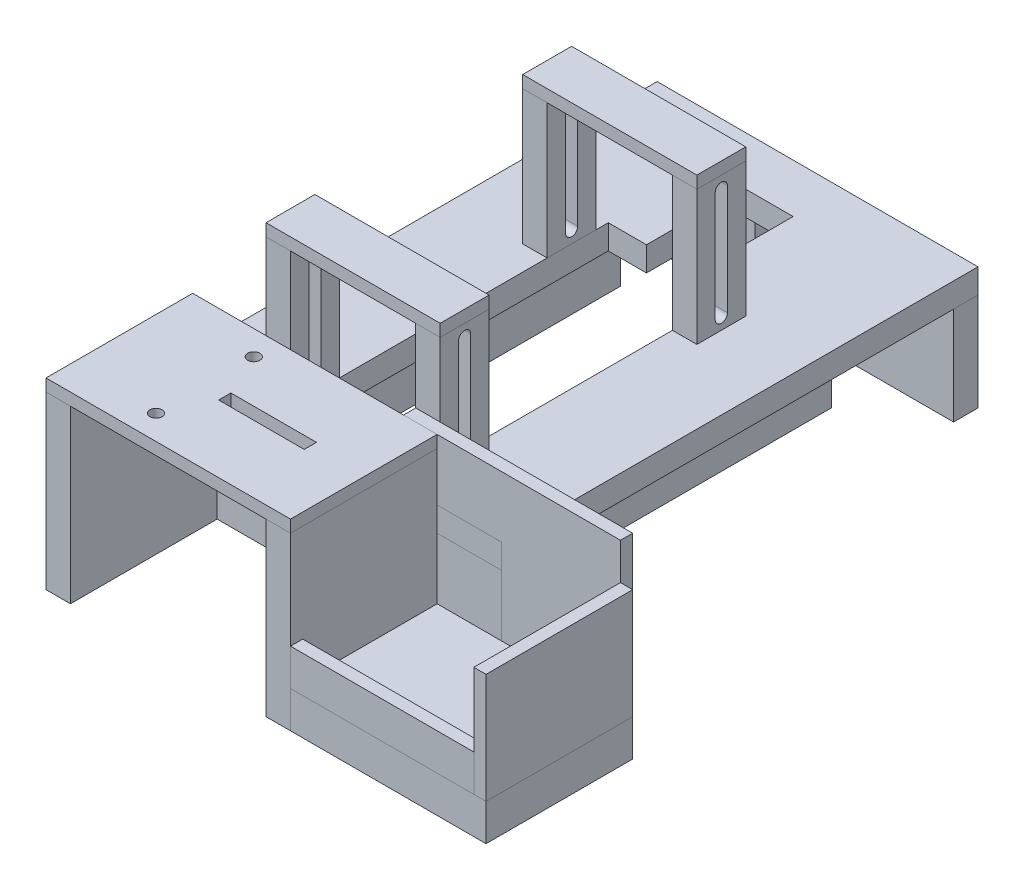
ISO-10303-21;
HEADER;
FILE_DESCRIPTION(('STEP AP214'),'2;1');
FILE_NAME('part.step','',(''),(''),'','','');
FILE_SCHEMA(('AUTOMOTIVE_DESIGN { 1 0 10303 214 1 1 1 1 }'));
ENDSEC;
DATA;
#1=APPLICATION_CONTEXT('core data for automotive mechanical design processes');
#2=APPLICATION_PROTOCOL_DEFINITION('international standard','automotive_design',2000,#1);
#3=PRODUCT_CONTEXT('',#1,'mechanical');
#4=PRODUCT('Part','Part','',(#3));
#5=PRODUCT_RELATED_PRODUCT_CATEGORY('part','',(#4));
#6=PRODUCT_DEFINITION_FORMATION('','',#4);
#7=PRODUCT_DEFINITION_CONTEXT('part definition',#1,'design');
#8=PRODUCT_DEFINITION('design','',#6,#7);
#9=PRODUCT_DEFINITION_SHAPE('','',#8);
#10=(LENGTH_UNIT() NAMED_UNIT(*) SI_UNIT(.MILLI.,.METRE.));
#11=(NAMED_UNIT(*) PLANE_ANGLE_UNIT() SI_UNIT($,.RADIAN.));
#12=(NAMED_UNIT(*) SI_UNIT($,.STERADIAN.) SOLID_ANGLE_UNIT());
#13=UNCERTAINTY_MEASURE_WITH_UNIT(LENGTH_MEASURE(1.E-05),#10,'distance_accuracy_value','');
#14=(GEOMETRIC_REPRESENTATION_CONTEXT(3) GLOBAL_UNCERTAINTY_ASSIGNED_CONTEXT((#13)) GLOBAL_UNIT_ASSIGNED_CONTEXT((#10,
#11,#12)) REPRESENTATION_CONTEXT('',''));
#15=CARTESIAN_POINT('',(0.,0.,0.));
#16=DIRECTION('',(0.,0.,1.));
#17=DIRECTION('',(1.,0.,0.));
#18=AXIS2_PLACEMENT_3D('',#15,#16,#17);
#19=CARTESIAN_POINT('',(177.8,-12.7,76.2));
#20=DIRECTION('',(-1.,0.,0.));
#21=DIRECTION('',(0.,0.,1.));
#22=AXIS2_PLACEMENT_3D('',#19,#20,#21);
#23=PLANE('',#22);
#24=DIRECTION('',(0.,0.,-1.));
#25=VECTOR('',#24,1.);
#26=CARTESIAN_POINT('',(177.8,-31.75,76.2));
#27=LINE('',#26,#25);
#28=CARTESIAN_POINT('',(177.8,-31.75,76.2));
#29=VERTEX_POINT('',#28);
#30=CARTESIAN_POINT('',(177.8,-31.75,69.85));
#31=VERTEX_POINT('',#30);
#32=EDGE_CURVE('E111',#29,#31,#27,.T.);
#33=ORIENTED_EDGE('',*,*,#32,.T.);
#34=DIRECTION('',(0.,-1.,0.));
#35=VECTOR('',#34,1.);
#36=CARTESIAN_POINT('',(177.8,-12.7,69.85));
#37=LINE('',#36,#35);
#38=CARTESIAN_POINT('',(177.8,-12.7,69.85));
#39=VERTEX_POINT('',#38);
#40=EDGE_CURVE('E12',#39,#31,#37,.T.);
#41=ORIENTED_EDGE('',*,*,#40,.F.);
#42=DIRECTION('',(0.,0.,-1.));
#43=VECTOR('',#42,1.);
#44=CARTESIAN_POINT('',(177.8,-12.7,76.2));
#45=LINE('',#44,#43);
#46=CARTESIAN_POINT('',(177.8,-12.7,76.2));
#47=VERTEX_POINT('',#46);
#48=EDGE_CURVE('E99',#47,#39,#45,.T.);
#49=ORIENTED_EDGE('',*,*,#48,.F.);
#50=DIRECTION('',(0.,-1.,0.));
#51=VECTOR('',#50,1.);
#52=CARTESIAN_POINT('',(177.8,-12.7,76.2));
#53=LINE('',#52,#51);
#54=EDGE_CURVE('E107',#47,#29,#53,.T.);
#55=ORIENTED_EDGE('',*,*,#54,.T.);
#56=EDGE_LOOP('',(#33,#41,#49,#55));
#57=FACE_BOUND('',#56,.T.);
#58=ADVANCED_FACE('F48',(#57),#23,.F.);
#59=CARTESIAN_POINT('',(177.8,-12.7,69.85));
#60=DIRECTION('',(0.,0.,1.));
#61=DIRECTION('',(1.,0.,0.));
#62=AXIS2_PLACEMENT_3D('',#59,#60,#61);
#63=PLANE('',#62);
#64=DIRECTION('',(-1.,0.,0.));
#65=VECTOR('',#64,1.);
#66=CARTESIAN_POINT('',(177.8,-31.75,69.85));
#67=LINE('',#66,#65);
#68=CARTESIAN_POINT('',(82.55,-31.75,69.85));
#69=VERTEX_POINT('',#68);
#70=EDGE_CURVE('E103',#31,#69,#67,.T.);
#71=ORIENTED_EDGE('',*,*,#70,.T.);
#72=DIRECTION('',(0.,-1.,0.));
#73=VECTOR('',#72,1.);
#74=CARTESIAN_POINT('',(82.55,-12.7,69.85));
#75=LINE('',#74,#73);
#76=CARTESIAN_POINT('',(82.55,-12.7,69.85));
#77=VERTEX_POINT('',#76);
#78=EDGE_CURVE('E56',#77,#69,#75,.T.);
#79=ORIENTED_EDGE('',*,*,#78,.F.);
#80=DIRECTION('',(-1.,0.,0.));
#81=VECTOR('',#80,1.);
#82=CARTESIAN_POINT('',(177.8,-12.7,69.85));
#83=LINE('',#82,#81);
#84=EDGE_CURVE('E94',#39,#77,#83,.T.);
#85=ORIENTED_EDGE('',*,*,#84,.F.);
#86=ORIENTED_EDGE('',*,*,#40,.T.);
#87=EDGE_LOOP('',(#71,#79,#85,#86));
#88=FACE_BOUND('',#87,.T.);
#89=ADVANCED_FACE('F102',(#88),#63,.F.);
#90=CARTESIAN_POINT('',(82.55,-12.7,76.2));
#91=DIRECTION('',(1.,0.,0.));
#92=DIRECTION('',(0.,0.,-1.));
#93=AXIS2_PLACEMENT_3D('',#90,#91,#92);
#94=PLANE('',#93);
#95=DIRECTION('',(0.,0.,1.));
#96=VECTOR('',#95,1.);
#97=CARTESIAN_POINT('',(82.55,-31.75,76.2));
#98=LINE('',#97,#96);
#99=CARTESIAN_POINT('',(82.55,-31.75,76.2));
#100=VERTEX_POINT('',#99);
#101=EDGE_CURVE('E81',#69,#100,#98,.T.);
#102=ORIENTED_EDGE('',*,*,#101,.T.);
#103=DIRECTION('',(0.,-1.,0.));
#104=VECTOR('',#103,1.);
#105=CARTESIAN_POINT('',(82.55,-12.7,76.2));
#106=LINE('',#105,#104);
#107=CARTESIAN_POINT('',(82.55,-12.7,76.2));
#108=VERTEX_POINT('',#107);
#109=EDGE_CURVE('E104',#108,#100,#106,.T.);
#110=ORIENTED_EDGE('',*,*,#109,.F.);
#111=DIRECTION('',(0.,0.,1.));
#112=VECTOR('',#111,1.);
#113=CARTESIAN_POINT('',(82.55,-12.7,76.2));
#114=LINE('',#113,#112);
#115=EDGE_CURVE('E97',#77,#108,#114,.T.);
#116=ORIENTED_EDGE('',*,*,#115,.F.);
#117=ORIENTED_EDGE('',*,*,#78,.T.);
#118=EDGE_LOOP('',(#102,#110,#116,#117));
#119=FACE_BOUND('',#118,.T.);
#120=ADVANCED_FACE('F105',(#119),#94,.F.);
#121=CARTESIAN_POINT('',(177.8,-12.7,76.2));
#122=DIRECTION('',(0.,0.,-1.));
#123=DIRECTION('',(-1.,0.,0.));
#124=AXIS2_PLACEMENT_3D('',#121,#122,#123);
#125=PLANE('',#124);
#126=DIRECTION('',(1.,0.,0.));
#127=VECTOR('',#126,1.);
#128=CARTESIAN_POINT('',(177.8,-31.75,76.2));
#129=LINE('',#128,#127);
#130=EDGE_CURVE('E87',#100,#29,#129,.T.);
#131=ORIENTED_EDGE('',*,*,#130,.T.);
#132=ORIENTED_EDGE('',*,*,#54,.F.);
#133=DIRECTION('',(1.,0.,0.));
#134=VECTOR('',#133,1.);
#135=CARTESIAN_POINT('',(177.8,-12.7,76.2));
#136=LINE('',#135,#134);
#137=EDGE_CURVE('E64',#108,#47,#136,.T.);
#138=ORIENTED_EDGE('',*,*,#137,.F.);
#139=ORIENTED_EDGE('',*,*,#109,.T.);
#140=EDGE_LOOP('',(#131,#132,#138,#139));
#141=FACE_BOUND('',#140,.T.);
#142=ADVANCED_FACE('F118',(#141),#125,.F.);
#143=CARTESIAN_POINT('',(0.,-12.7,0.));
#144=DIRECTION('',(0.,1.,0.));
#145=DIRECTION('',(0.,0.,1.));
#146=AXIS2_PLACEMENT_3D('',#143,#144,#145);
#147=PLANE('',#146);
#148=ORIENTED_EDGE('',*,*,#48,.T.);
#149=ORIENTED_EDGE('',*,*,#84,.T.);
#150=ORIENTED_EDGE('',*,*,#115,.T.);
#151=ORIENTED_EDGE('',*,*,#137,.T.);
#152=EDGE_LOOP('',(#148,#149,#150,#151));
#153=FACE_BOUND('',#152,.T.);
#154=ADVANCED_FACE('F95',(#153),#147,.T.);
#155=CARTESIAN_POINT('',(0.,-31.75,0.));
#156=DIRECTION('',(0.,1.,0.));
#157=DIRECTION('',(0.,0.,1.));
#158=AXIS2_PLACEMENT_3D('',#155,#156,#157);
#159=PLANE('',#158);
#160=ORIENTED_EDGE('',*,*,#32,.F.);
#161=ORIENTED_EDGE('',*,*,#130,.F.);
#162=ORIENTED_EDGE('',*,*,#101,.F.);
#163=ORIENTED_EDGE('',*,*,#70,.F.);
#164=EDGE_LOOP('',(#160,#161,#162,#163));
#165=FACE_BOUND('',#164,.T.);
#166=ADVANCED_FACE('F121',(#165),#159,.F.);
#167=CLOSED_SHELL('',(#58,#89,#120,#142,#154,#166));
#168=MANIFOLD_SOLID_BREP('B2',#167);
#169=CARTESIAN_POINT('',(115.8875,-50.8,-6.35));
#170=DIRECTION('',(1.,0.,0.));
#171=DIRECTION('',(0.,0.,-1.));
#172=AXIS2_PLACEMENT_3D('',#169,#170,#171);
#173=PLANE('',#172);
#174=DIRECTION('',(0.,1.,0.));
#175=VECTOR('',#174,1.);
#176=CARTESIAN_POINT('',(115.8875,-50.8,0.));
#177=LINE('',#176,#175);
#178=CARTESIAN_POINT('',(115.8875,-50.8,0.));
#179=VERTEX_POINT('',#178);
#180=CARTESIAN_POINT('',(115.8875,12.7,0.));
#181=VERTEX_POINT('',#180);
#182=EDGE_CURVE('E266',#179,#181,#177,.T.);
#183=ORIENTED_EDGE('',*,*,#182,.T.);
#184=DIRECTION('',(0.,0.,1.));
#185=VECTOR('',#184,1.);
#186=CARTESIAN_POINT('',(115.8875,12.7,-6.35));
#187=LINE('',#186,#185);
#188=CARTESIAN_POINT('',(115.8875,12.7,-6.35));
#189=VERTEX_POINT('',#188);
#190=EDGE_CURVE('E46',#189,#181,#187,.T.);
#191=ORIENTED_EDGE('',*,*,#190,.F.);
#192=DIRECTION('',(0.,1.,0.));
#193=VECTOR('',#192,1.);
#194=CARTESIAN_POINT('',(115.8875,-50.8,-6.35));
#195=LINE('',#194,#193);
#196=CARTESIAN_POINT('',(115.8875,-50.8,-6.35));
#197=VERTEX_POINT('',#196);
#198=EDGE_CURVE('E276',#197,#189,#195,.T.);
#199=ORIENTED_EDGE('',*,*,#198,.F.);
#200=DIRECTION('',(0.,0.,1.));
#201=VECTOR('',#200,1.);
#202=CARTESIAN_POINT('',(115.8875,-50.8,-6.35));
#203=LINE('',#202,#201);
#204=EDGE_CURVE('E262',#197,#179,#203,.T.);
#205=ORIENTED_EDGE('',*,*,#204,.T.);
#206=EDGE_LOOP('',(#183,#191,#199,#205));
#207=FACE_BOUND('',#206,.T.);
#208=ADVANCED_FACE('F182',(#207),#173,.F.);
#209=CARTESIAN_POINT('',(65.0875,12.7,-6.35));
#210=DIRECTION('',(0.,1.,0.));
#211=DIRECTION('',(0.,0.,1.));
#212=AXIS2_PLACEMENT_3D('',#209,#210,#211);
#213=PLANE('',#212);
#214=DIRECTION('',(-1.,0.,0.));
#215=VECTOR('',#214,1.);
#216=CARTESIAN_POINT('',(65.0875,12.7,0.));
#217=LINE('',#216,#215);
#218=CARTESIAN_POINT('',(65.0875,12.7,0.));
#219=VERTEX_POINT('',#218);
#220=EDGE_CURVE('E269',#181,#219,#217,.T.);
#221=ORIENTED_EDGE('',*,*,#220,.T.);
#222=DIRECTION('',(0.,0.,1.));
#223=VECTOR('',#222,1.);
#224=CARTESIAN_POINT('',(65.0875,12.7,-6.35));
#225=LINE('',#224,#223);
#226=CARTESIAN_POINT('',(65.0875,12.7,-6.35));
#227=VERTEX_POINT('',#226);
#228=EDGE_CURVE('E190',#227,#219,#225,.T.);
#229=ORIENTED_EDGE('',*,*,#228,.F.);
#230=DIRECTION('',(-1.,0.,0.));
#231=VECTOR('',#230,1.);
#232=CARTESIAN_POINT('',(65.0875,12.7,-6.35));
#233=LINE('',#232,#231);
#234=EDGE_CURVE('E235',#189,#227,#233,.T.);
#235=ORIENTED_EDGE('',*,*,#234,.F.);
#236=ORIENTED_EDGE('',*,*,#190,.T.);
#237=EDGE_LOOP('',(#221,#229,#235,#236));
#238=FACE_BOUND('',#237,.T.);
#239=ADVANCED_FACE('F300',(#238),#213,.F.);
#240=CARTESIAN_POINT('',(65.0875,44.45,-6.35));
#241=DIRECTION('',(1.,0.,0.));
#242=DIRECTION('',(0.,1.,0.));
#243=AXIS2_PLACEMENT_3D('',#240,#241,#242);
#244=PLANE('',#243);
#245=DIRECTION('',(0.,1.,0.));
#246=VECTOR('',#245,1.);
#247=CARTESIAN_POINT('',(65.0875,44.45,0.));
#248=LINE('',#247,#246);
#249=CARTESIAN_POINT('',(65.0875,44.45,0.));
#250=VERTEX_POINT('',#249);
#251=EDGE_CURVE('E271',#219,#250,#248,.T.);
#252=ORIENTED_EDGE('',*,*,#251,.T.);
#253=DIRECTION('',(0.,0.,1.));
#254=VECTOR('',#253,1.);
#255=CARTESIAN_POINT('',(65.0875,44.45,-6.35));
#256=LINE('',#255,#254);
#257=CARTESIAN_POINT('',(65.0875,44.45,-6.35));
#258=VERTEX_POINT('',#257);
#259=EDGE_CURVE('E257',#258,#250,#256,.T.);
#260=ORIENTED_EDGE('',*,*,#259,.F.);
#261=DIRECTION('',(0.,1.,0.));
#262=VECTOR('',#261,1.);
#263=CARTESIAN_POINT('',(65.0875,44.45,-6.35));
#264=LINE('',#263,#262);
#265=EDGE_CURVE('E248',#227,#258,#264,.T.);
#266=ORIENTED_EDGE('',*,*,#265,.F.);
#267=ORIENTED_EDGE('',*,*,#228,.T.);
#268=EDGE_LOOP('',(#252,#260,#266,#267));
#269=FACE_BOUND('',#268,.T.);
#270=ADVANCED_FACE('F282',(#269),#244,.F.);
#271=CARTESIAN_POINT('',(177.8,44.45,-6.35));
#272=DIRECTION('',(0.,-1.,0.));
#273=DIRECTION('',(0.,0.,-1.));
#274=AXIS2_PLACEMENT_3D('',#271,#272,#273);
#275=PLANE('',#274);
#276=DIRECTION('',(1.,0.,0.));
#277=VECTOR('',#276,1.);
#278=CARTESIAN_POINT('',(177.8,44.45,0.));
#279=LINE('',#278,#277);
#280=CARTESIAN_POINT('',(177.8,44.45,0.));
#281=VERTEX_POINT('',#280);
#282=EDGE_CURVE('E256',#250,#281,#279,.T.);
#283=ORIENTED_EDGE('',*,*,#282,.T.);
#284=DIRECTION('',(0.,0.,1.));
#285=VECTOR('',#284,1.);
#286=CARTESIAN_POINT('',(177.8,44.45,-6.35));
#287=LINE('',#286,#285);
#288=CARTESIAN_POINT('',(177.8,44.45,-6.35));
#289=VERTEX_POINT('',#288);
#290=EDGE_CURVE('E253',#289,#281,#287,.T.);
#291=ORIENTED_EDGE('',*,*,#290,.F.);
#292=DIRECTION('',(1.,0.,0.));
#293=VECTOR('',#292,1.);
#294=CARTESIAN_POINT('',(177.8,44.45,-6.35));
#295=LINE('',#294,#293);
#296=EDGE_CURVE('E242',#258,#289,#295,.T.);
#297=ORIENTED_EDGE('',*,*,#296,.F.);
#298=ORIENTED_EDGE('',*,*,#259,.T.);
#299=EDGE_LOOP('',(#283,#291,#297,#298));
#300=FACE_BOUND('',#299,.T.);
#301=ADVANCED_FACE('F254',(#300),#275,.F.);
#302=CARTESIAN_POINT('',(177.8,-50.8,-6.35));
#303=DIRECTION('',(-1.,0.,0.));
#304=DIRECTION('',(0.,0.,1.));
#305=AXIS2_PLACEMENT_3D('',#302,#303,#304);
#306=PLANE('',#305);
#307=DIRECTION('',(0.,-1.,0.));
#308=VECTOR('',#307,1.);
#309=CARTESIAN_POINT('',(177.8,-50.8,0.));
#310=LINE('',#309,#308);
#311=CARTESIAN_POINT('',(177.8,-50.8,0.));
#312=VERTEX_POINT('',#311);
#313=EDGE_CURVE('E221',#281,#312,#310,.T.);
#314=ORIENTED_EDGE('',*,*,#313,.T.);
#315=DIRECTION('',(0.,0.,1.));
#316=VECTOR('',#315,1.);
#317=CARTESIAN_POINT('',(177.8,-50.8,-6.35));
#318=LINE('',#317,#316);
#319=CARTESIAN_POINT('',(177.8,-50.8,-6.35));
#320=VERTEX_POINT('',#319);
#321=EDGE_CURVE('E258',#320,#312,#318,.T.);
#322=ORIENTED_EDGE('',*,*,#321,.F.);
#323=DIRECTION('',(0.,-1.,0.));
#324=VECTOR('',#323,1.);
#325=CARTESIAN_POINT('',(177.8,-50.8,-6.35));
#326=LINE('',#325,#324);
#327=EDGE_CURVE('E246',#289,#320,#326,.T.);
#328=ORIENTED_EDGE('',*,*,#327,.F.);
#329=ORIENTED_EDGE('',*,*,#290,.T.);
#330=EDGE_LOOP('',(#314,#322,#328,#329));
#331=FACE_BOUND('',#330,.T.);
#332=ADVANCED_FACE('F260',(#331),#306,.F.);
#333=CARTESIAN_POINT('',(115.8875,-50.8,-6.35));
#334=DIRECTION('',(0.,1.,0.));
#335=DIRECTION('',(0.,0.,1.));
#336=AXIS2_PLACEMENT_3D('',#333,#334,#335);
#337=PLANE('',#336);
#338=DIRECTION('',(-1.,0.,0.));
#339=VECTOR('',#338,1.);
#340=CARTESIAN_POINT('',(115.8875,-50.8,0.));
#341=LINE('',#340,#339);
#342=EDGE_CURVE('E227',#312,#179,#341,.T.);
#343=ORIENTED_EDGE('',*,*,#342,.T.);
#344=ORIENTED_EDGE('',*,*,#204,.F.);
#345=DIRECTION('',(-1.,0.,0.));
#346=VECTOR('',#345,1.);
#347=CARTESIAN_POINT('',(115.8875,-50.8,-6.35));
#348=LINE('',#347,#346);
#349=EDGE_CURVE('E198',#320,#197,#348,.T.);
#350=ORIENTED_EDGE('',*,*,#349,.F.);
#351=ORIENTED_EDGE('',*,*,#321,.T.);
#352=EDGE_LOOP('',(#343,#344,#350,#351));
#353=FACE_BOUND('',#352,.T.);
#354=ADVANCED_FACE('F289',(#353),#337,.F.);
#355=CARTESIAN_POINT('',(0.,0.,-6.35));
#356=DIRECTION('',(0.,0.,-1.));
#357=DIRECTION('',(-1.,0.,0.));
#358=AXIS2_PLACEMENT_3D('',#355,#356,#357);
#359=PLANE('',#358);
#360=ORIENTED_EDGE('',*,*,#198,.T.);
#361=ORIENTED_EDGE('',*,*,#234,.T.);
#362=ORIENTED_EDGE('',*,*,#265,.T.);
#363=ORIENTED_EDGE('',*,*,#296,.T.);
#364=ORIENTED_EDGE('',*,*,#327,.T.);
#365=ORIENTED_EDGE('',*,*,#349,.T.);
#366=EDGE_LOOP('',(#360,#361,#362,#363,#364,#365));
#367=FACE_BOUND('',#366,.T.);
#368=ADVANCED_FACE('F244',(#367),#359,.T.);
#369=CARTESIAN_POINT('',(0.,0.,0.));
#370=DIRECTION('',(0.,0.,-1.));
#371=DIRECTION('',(-1.,0.,0.));
#372=AXIS2_PLACEMENT_3D('',#369,#370,#371);
#373=PLANE('',#372);
#374=ORIENTED_EDGE('',*,*,#182,.F.);
#375=ORIENTED_EDGE('',*,*,#342,.F.);
#376=ORIENTED_EDGE('',*,*,#313,.F.);
#377=ORIENTED_EDGE('',*,*,#282,.F.);
#378=ORIENTED_EDGE('',*,*,#251,.F.);
#379=ORIENTED_EDGE('',*,*,#220,.F.);
#380=EDGE_LOOP('',(#374,#375,#376,#377,#378,#379));
#381=FACE_BOUND('',#380,.T.);
#382=ADVANCED_FACE('F285',(#381),#373,.F.);
#383=CLOSED_SHELL('',(#208,#239,#270,#301,#332,#354,#368,#382));
#384=MANIFOLD_SOLID_BREP('B6',#383);
#385=CARTESIAN_POINT('',(184.15,25.4,76.2));
#386=DIRECTION('',(-1.,0.,0.));
#387=DIRECTION('',(0.,0.,1.));
#388=AXIS2_PLACEMENT_3D('',#385,#386,#387);
#389=PLANE('',#388);
#390=DIRECTION('',(0.,0.,-1.));
#391=VECTOR('',#390,1.);
#392=CARTESIAN_POINT('',(184.15,-31.75,76.2));
#393=LINE('',#392,#391);
#394=CARTESIAN_POINT('',(184.15,-31.75,76.2));
#395=VERTEX_POINT('',#394);
#396=CARTESIAN_POINT('',(184.15,-31.75,0.));
#397=VERTEX_POINT('',#396);
#398=EDGE_CURVE('E431',#395,#397,#393,.T.);
#399=ORIENTED_EDGE('',*,*,#398,.T.);
#400=DIRECTION('',(0.,-1.,0.));
#401=VECTOR('',#400,1.);
#402=CARTESIAN_POINT('',(184.15,25.4,0.));
#403=LINE('',#402,#401);
#404=CARTESIAN_POINT('',(184.15,25.4,0.));
#405=VERTEX_POINT('',#404);
#406=EDGE_CURVE('E180',#405,#397,#403,.T.);
#407=ORIENTED_EDGE('',*,*,#406,.F.);
#408=DIRECTION('',(0.,0.,-1.));
#409=VECTOR('',#408,1.);
#410=CARTESIAN_POINT('',(184.15,25.4,76.2));
#411=LINE('',#410,#409);
#412=CARTESIAN_POINT('',(184.15,25.4,76.2));
#413=VERTEX_POINT('',#412);
#414=EDGE_CURVE('E419',#413,#405,#411,.T.);
#415=ORIENTED_EDGE('',*,*,#414,.F.);
#416=DIRECTION('',(0.,-1.,0.));
#417=VECTOR('',#416,1.);
#418=CARTESIAN_POINT('',(184.15,25.4,76.2));
#419=LINE('',#418,#417);
#420=EDGE_CURVE('E427',#413,#395,#419,.T.);
#421=ORIENTED_EDGE('',*,*,#420,.T.);
#422=EDGE_LOOP('',(#399,#407,#415,#421));
#423=FACE_BOUND('',#422,.T.);
#424=ADVANCED_FACE('F368',(#423),#389,.F.);
#425=CARTESIAN_POINT('',(184.15,25.4,0.));
#426=DIRECTION('',(0.,0.,1.));
#427=DIRECTION('',(1.,0.,0.));
#428=AXIS2_PLACEMENT_3D('',#425,#426,#427);
#429=PLANE('',#428);
#430=DIRECTION('',(-1.,0.,0.));
#431=VECTOR('',#430,1.);
#432=CARTESIAN_POINT('',(184.15,-31.75,0.));
#433=LINE('',#432,#431);
#434=CARTESIAN_POINT('',(177.8,-31.75,0.));
#435=VERTEX_POINT('',#434);
#436=EDGE_CURVE('E423',#397,#435,#433,.T.);
#437=ORIENTED_EDGE('',*,*,#436,.T.);
#438=DIRECTION('',(0.,-1.,0.));
#439=VECTOR('',#438,1.);
#440=CARTESIAN_POINT('',(177.8,25.4,0.));
#441=LINE('',#440,#439);
#442=CARTESIAN_POINT('',(177.8,25.4,0.));
#443=VERTEX_POINT('',#442);
#444=EDGE_CURVE('E376',#443,#435,#441,.T.);
#445=ORIENTED_EDGE('',*,*,#444,.F.);
#446=DIRECTION('',(-1.,0.,0.));
#447=VECTOR('',#446,1.);
#448=CARTESIAN_POINT('',(184.15,25.4,0.));
#449=LINE('',#448,#447);
#450=EDGE_CURVE('E414',#405,#443,#449,.T.);
#451=ORIENTED_EDGE('',*,*,#450,.F.);
#452=ORIENTED_EDGE('',*,*,#406,.T.);
#453=EDGE_LOOP('',(#437,#445,#451,#452));
#454=FACE_BOUND('',#453,.T.);
#455=ADVANCED_FACE('F422',(#454),#429,.F.);
#456=CARTESIAN_POINT('',(177.8,25.4,76.2));
#457=DIRECTION('',(1.,0.,0.));
#458=DIRECTION('',(0.,0.,-1.));
#459=AXIS2_PLACEMENT_3D('',#456,#457,#458);
#460=PLANE('',#459);
#461=DIRECTION('',(0.,0.,1.));
#462=VECTOR('',#461,1.);
#463=CARTESIAN_POINT('',(177.8,-31.75,76.2));
#464=LINE('',#463,#462);
#465=CARTESIAN_POINT('',(177.8,-31.75,76.2));
#466=VERTEX_POINT('',#465);
#467=EDGE_CURVE('E401',#435,#466,#464,.T.);
#468=ORIENTED_EDGE('',*,*,#467,.T.);
#469=DIRECTION('',(0.,-1.,0.));
#470=VECTOR('',#469,1.);
#471=CARTESIAN_POINT('',(177.8,25.4,76.2));
#472=LINE('',#471,#470);
#473=CARTESIAN_POINT('',(177.8,25.4,76.2));
#474=VERTEX_POINT('',#473);
#475=EDGE_CURVE('E424',#474,#466,#472,.T.);
#476=ORIENTED_EDGE('',*,*,#475,.F.);
#477=DIRECTION('',(0.,0.,1.));
#478=VECTOR('',#477,1.);
#479=CARTESIAN_POINT('',(177.8,25.4,76.2));
#480=LINE('',#479,#478);
#481=EDGE_CURVE('E417',#443,#474,#480,.T.);
#482=ORIENTED_EDGE('',*,*,#481,.F.);
#483=ORIENTED_EDGE('',*,*,#444,.T.);
#484=EDGE_LOOP('',(#468,#476,#482,#483));
#485=FACE_BOUND('',#484,.T.);
#486=ADVANCED_FACE('F425',(#485),#460,.F.);
#487=CARTESIAN_POINT('',(184.15,25.4,76.2));
#488=DIRECTION('',(0.,0.,-1.));
#489=DIRECTION('',(-1.,0.,0.));
#490=AXIS2_PLACEMENT_3D('',#487,#488,#489);
#491=PLANE('',#490);
#492=DIRECTION('',(1.,0.,0.));
#493=VECTOR('',#492,1.);
#494=CARTESIAN_POINT('',(184.15,-31.75,76.2));
#495=LINE('',#494,#493);
#496=EDGE_CURVE('E407',#466,#395,#495,.T.);
#497=ORIENTED_EDGE('',*,*,#496,.T.);
#498=ORIENTED_EDGE('',*,*,#420,.F.);
#499=DIRECTION('',(1.,0.,0.));
#500=VECTOR('',#499,1.);
#501=CARTESIAN_POINT('',(184.15,25.4,76.2));
#502=LINE('',#501,#500);
#503=EDGE_CURVE('E384',#474,#413,#502,.T.);
#504=ORIENTED_EDGE('',*,*,#503,.F.);
#505=ORIENTED_EDGE('',*,*,#475,.T.);
#506=EDGE_LOOP('',(#497,#498,#504,#505));
#507=FACE_BOUND('',#506,.T.);
#508=ADVANCED_FACE('F438',(#507),#491,.F.);
#509=CARTESIAN_POINT('',(0.,25.4,0.));
#510=DIRECTION('',(0.,1.,0.));
#511=DIRECTION('',(0.,0.,1.));
#512=AXIS2_PLACEMENT_3D('',#509,#510,#511);
#513=PLANE('',#512);
#514=ORIENTED_EDGE('',*,*,#414,.T.);
#515=ORIENTED_EDGE('',*,*,#450,.T.);
#516=ORIENTED_EDGE('',*,*,#481,.T.);
#517=ORIENTED_EDGE('',*,*,#503,.T.);
#518=EDGE_LOOP('',(#514,#515,#516,#517));
#519=FACE_BOUND('',#518,.T.);
#520=ADVANCED_FACE('F415',(#519),#513,.T.);
#521=CARTESIAN_POINT('',(0.,-31.75,0.));
#522=DIRECTION('',(0.,1.,0.));
#523=DIRECTION('',(0.,0.,1.));
#524=AXIS2_PLACEMENT_3D('',#521,#522,#523);
#525=PLANE('',#524);
#526=ORIENTED_EDGE('',*,*,#398,.F.);
#527=ORIENTED_EDGE('',*,*,#496,.F.);
#528=ORIENTED_EDGE('',*,*,#467,.F.);
#529=ORIENTED_EDGE('',*,*,#436,.F.);
#530=EDGE_LOOP('',(#526,#527,#528,#529));
#531=FACE_BOUND('',#530,.T.);
#532=ADVANCED_FACE('F441',(#531),#525,.F.);
#533=CLOSED_SHELL('',(#424,#455,#486,#508,#520,#532));
#534=MANIFOLD_SOLID_BREP('B40',#533);
#535=CARTESIAN_POINT('',(82.55,-31.75,0.));
#536=DIRECTION('',(-1.,0.,0.));
#537=DIRECTION('',(0.,0.,1.));
#538=AXIS2_PLACEMENT_3D('',#535,#536,#537);
#539=PLANE('',#538);
#540=DIRECTION('',(0.,0.,-1.));
#541=VECTOR('',#540,1.);
#542=CARTESIAN_POINT('',(82.55,-50.8,0.));
#543=LINE('',#542,#541);
#544=CARTESIAN_POINT('',(82.55,-50.8,76.2));
#545=VERTEX_POINT('',#544);
#546=CARTESIAN_POINT('',(82.55,-50.8,0.));
#547=VERTEX_POINT('',#546);
#548=EDGE_CURVE('E566',#545,#547,#543,.T.);
#549=ORIENTED_EDGE('',*,*,#548,.F.);
#550=DIRECTION('',(0.,-1.,0.));
#551=VECTOR('',#550,1.);
#552=CARTESIAN_POINT('',(82.55,-31.75,76.2));
#553=LINE('',#552,#551);
#554=CARTESIAN_POINT('',(82.55,-31.75,76.2));
#555=VERTEX_POINT('',#554);
#556=EDGE_CURVE('E366',#555,#545,#553,.T.);
#557=ORIENTED_EDGE('',*,*,#556,.F.);
#558=DIRECTION('',(0.,0.,-1.));
#559=VECTOR('',#558,1.);
#560=CARTESIAN_POINT('',(82.55,-31.75,0.));
#561=LINE('',#560,#559);
#562=CARTESIAN_POINT('',(82.55,-31.75,0.));
#563=VERTEX_POINT('',#562);
#564=EDGE_CURVE('E560',#555,#563,#561,.T.);
#565=ORIENTED_EDGE('',*,*,#564,.T.);
#566=DIRECTION('',(0.,-1.,0.));
#567=VECTOR('',#566,1.);
#568=CARTESIAN_POINT('',(82.55,-31.75,0.));
#569=LINE('',#568,#567);
#570=EDGE_CURVE('E505',#563,#547,#569,.T.);
#571=ORIENTED_EDGE('',*,*,#570,.T.);
#572=EDGE_LOOP('',(#549,#557,#565,#571));
#573=FACE_BOUND('',#572,.T.);
#574=ADVANCED_FACE('F502',(#573),#539,.T.);
#575=CARTESIAN_POINT('',(82.55,-31.75,76.2));
#576=DIRECTION('',(0.,0.,1.));
#577=DIRECTION('',(1.,0.,0.));
#578=AXIS2_PLACEMENT_3D('',#575,#576,#577);
#579=PLANE('',#578);
#580=DIRECTION('',(-1.,0.,0.));
#581=VECTOR('',#580,1.);
#582=CARTESIAN_POINT('',(82.55,-50.8,76.2));
#583=LINE('',#582,#581);
#584=CARTESIAN_POINT('',(184.15,-50.8,76.2));
#585=VERTEX_POINT('',#584);
#586=EDGE_CURVE('E562',#585,#545,#583,.T.);
#587=ORIENTED_EDGE('',*,*,#586,.F.);
#588=DIRECTION('',(0.,-1.,0.));
#589=VECTOR('',#588,1.);
#590=CARTESIAN_POINT('',(184.15,-31.75,76.2));
#591=LINE('',#590,#589);
#592=CARTESIAN_POINT('',(184.15,-31.75,76.2));
#593=VERTEX_POINT('',#592);
#594=EDGE_CURVE('E511',#593,#585,#591,.T.);
#595=ORIENTED_EDGE('',*,*,#594,.F.);
#596=DIRECTION('',(-1.,0.,0.));
#597=VECTOR('',#596,1.);
#598=CARTESIAN_POINT('',(82.55,-31.75,76.2));
#599=LINE('',#598,#597);
#600=EDGE_CURVE('E557',#593,#555,#599,.T.);
#601=ORIENTED_EDGE('',*,*,#600,.T.);
#602=ORIENTED_EDGE('',*,*,#556,.T.);
#603=EDGE_LOOP('',(#587,#595,#601,#602));
#604=FACE_BOUND('',#603,.T.);
#605=ADVANCED_FACE('F576',(#604),#579,.T.);
#606=CARTESIAN_POINT('',(184.15,-31.75,0.));
#607=DIRECTION('',(1.,0.,0.));
#608=DIRECTION('',(0.,0.,-1.));
#609=AXIS2_PLACEMENT_3D('',#606,#607,#608);
#610=PLANE('',#609);
#611=DIRECTION('',(0.,0.,1.));
#612=VECTOR('',#611,1.);
#613=CARTESIAN_POINT('',(184.15,-50.8,0.));
#614=LINE('',#613,#612);
#615=CARTESIAN_POINT('',(184.15,-50.8,0.));
#616=VERTEX_POINT('',#615);
#617=EDGE_CURVE('E552',#616,#585,#614,.T.);
#618=ORIENTED_EDGE('',*,*,#617,.F.);
#619=DIRECTION('',(0.,-1.,0.));
#620=VECTOR('',#619,1.);
#621=CARTESIAN_POINT('',(184.15,-31.75,0.));
#622=LINE('',#621,#620);
#623=CARTESIAN_POINT('',(184.15,-31.75,0.));
#624=VERTEX_POINT('',#623);
#625=EDGE_CURVE('E547',#624,#616,#622,.T.);
#626=ORIENTED_EDGE('',*,*,#625,.F.);
#627=DIRECTION('',(0.,0.,1.));
#628=VECTOR('',#627,1.);
#629=CARTESIAN_POINT('',(184.15,-31.75,0.));
#630=LINE('',#629,#628);
#631=EDGE_CURVE('E550',#624,#593,#630,.T.);
#632=ORIENTED_EDGE('',*,*,#631,.T.);
#633=ORIENTED_EDGE('',*,*,#594,.T.);
#634=EDGE_LOOP('',(#618,#626,#632,#633));
#635=FACE_BOUND('',#634,.T.);
#636=ADVANCED_FACE('F549',(#635),#610,.T.);
#637=CARTESIAN_POINT('',(82.55,-31.75,0.));
#638=DIRECTION('',(0.,0.,-1.));
#639=DIRECTION('',(-1.,0.,0.));
#640=AXIS2_PLACEMENT_3D('',#637,#638,#639);
#641=PLANE('',#640);
#642=DIRECTION('',(1.,0.,0.));
#643=VECTOR('',#642,1.);
#644=CARTESIAN_POINT('',(82.55,-50.8,0.));
#645=LINE('',#644,#643);
#646=EDGE_CURVE('E569',#547,#616,#645,.T.);
#647=ORIENTED_EDGE('',*,*,#646,.F.);
#648=ORIENTED_EDGE('',*,*,#570,.F.);
#649=DIRECTION('',(1.,0.,0.));
#650=VECTOR('',#649,1.);
#651=CARTESIAN_POINT('',(82.55,-31.75,0.));
#652=LINE('',#651,#650);
#653=EDGE_CURVE('E556',#563,#624,#652,.T.);
#654=ORIENTED_EDGE('',*,*,#653,.T.);
#655=ORIENTED_EDGE('',*,*,#625,.T.);
#656=EDGE_LOOP('',(#647,#648,#654,#655));
#657=FACE_BOUND('',#656,.T.);
#658=ADVANCED_FACE('F559',(#657),#641,.T.);
#659=CARTESIAN_POINT('',(0.,-31.75,0.));
#660=DIRECTION('',(0.,1.,0.));
#661=DIRECTION('',(0.,0.,1.));
#662=AXIS2_PLACEMENT_3D('',#659,#660,#661);
#663=PLANE('',#662);
#664=ORIENTED_EDGE('',*,*,#564,.F.);
#665=ORIENTED_EDGE('',*,*,#600,.F.);
#666=ORIENTED_EDGE('',*,*,#631,.F.);
#667=ORIENTED_EDGE('',*,*,#653,.F.);
#668=EDGE_LOOP('',(#664,#665,#666,#667));
#669=FACE_BOUND('',#668,.T.);
#670=ADVANCED_FACE('F555',(#669),#663,.T.);
#671=CARTESIAN_POINT('',(0.,-50.8,0.));
#672=DIRECTION('',(0.,1.,0.));
#673=DIRECTION('',(0.,0.,1.));
#674=AXIS2_PLACEMENT_3D('',#671,#672,#673);
#675=PLANE('',#674);
#676=ORIENTED_EDGE('',*,*,#548,.T.);
#677=ORIENTED_EDGE('',*,*,#646,.T.);
#678=ORIENTED_EDGE('',*,*,#617,.T.);
#679=ORIENTED_EDGE('',*,*,#586,.T.);
#680=EDGE_LOOP('',(#676,#677,#678,#679));
#681=FACE_BOUND('',#680,.T.);
#682=ADVANCED_FACE('F575',(#681),#675,.F.);
#683=CLOSED_SHELL('',(#574,#605,#636,#658,#670,#682));
#684=MANIFOLD_SOLID_BREP('B174',#683);
#685=CARTESIAN_POINT('',(82.55,-50.8,76.2));
#686=DIRECTION('',(-1.,0.,0.));
#687=DIRECTION('',(0.,0.,1.));
#688=AXIS2_PLACEMENT_3D('',#685,#686,#687);
#689=PLANE('',#688);
#690=DIRECTION('',(0.,0.,1.));
#691=VECTOR('',#690,1.);
#692=CARTESIAN_POINT('',(82.55,38.1,76.2));
#693=LINE('',#692,#691);
#694=CARTESIAN_POINT('',(82.55,38.1,0.));
#695=VERTEX_POINT('',#694);
#696=CARTESIAN_POINT('',(82.55,38.1,76.2));
#697=VERTEX_POINT('',#696);
#698=EDGE_CURVE('E707',#695,#697,#693,.T.);
#699=ORIENTED_EDGE('',*,*,#698,.T.);
#700=DIRECTION('',(0.,1.,0.));
#701=VECTOR('',#700,1.);
#702=CARTESIAN_POINT('',(82.55,-50.8,76.2));
#703=LINE('',#702,#701);
#704=CARTESIAN_POINT('',(82.55,-50.8,76.2));
#705=VERTEX_POINT('',#704);
#706=EDGE_CURVE('E500',#705,#697,#703,.T.);
#707=ORIENTED_EDGE('',*,*,#706,.F.);
#708=DIRECTION('',(0.,0.,1.));
#709=VECTOR('',#708,1.);
#710=CARTESIAN_POINT('',(82.55,-50.8,76.2));
#711=LINE('',#710,#709);
#712=CARTESIAN_POINT('',(82.55,-50.8,0.));
#713=VERTEX_POINT('',#712);
#714=EDGE_CURVE('E695',#713,#705,#711,.T.);
#715=ORIENTED_EDGE('',*,*,#714,.F.);
#716=DIRECTION('',(0.,1.,0.));
#717=VECTOR('',#716,1.);
#718=CARTESIAN_POINT('',(82.55,-50.8,0.));
#719=LINE('',#718,#717);
#720=EDGE_CURVE('E703',#713,#695,#719,.T.);
#721=ORIENTED_EDGE('',*,*,#720,.T.);
#722=EDGE_LOOP('',(#699,#707,#715,#721));
#723=FACE_BOUND('',#722,.T.);
#724=ADVANCED_FACE('F644',(#723),#689,.F.);
#725=CARTESIAN_POINT('',(82.55,-50.8,76.2));
#726=DIRECTION('',(0.,0.,-1.));
#727=DIRECTION('',(-1.,0.,0.));
#728=AXIS2_PLACEMENT_3D('',#725,#726,#727);
#729=PLANE('',#728);
#730=DIRECTION('',(-1.,0.,0.));
#731=VECTOR('',#730,1.);
#732=CARTESIAN_POINT('',(82.55,38.1,76.2));
#733=LINE('',#732,#731);
#734=CARTESIAN_POINT('',(69.85,38.1,76.2));
#735=VERTEX_POINT('',#734);
#736=EDGE_CURVE('E699',#697,#735,#733,.T.);
#737=ORIENTED_EDGE('',*,*,#736,.T.);
#738=DIRECTION('',(0.,1.,0.));
#739=VECTOR('',#738,1.);
#740=CARTESIAN_POINT('',(69.85,-50.8,76.2));
#741=LINE('',#740,#739);
#742=CARTESIAN_POINT('',(69.85,-50.8,76.2));
#743=VERTEX_POINT('',#742);
#744=EDGE_CURVE('E652',#743,#735,#741,.T.);
#745=ORIENTED_EDGE('',*,*,#744,.F.);
#746=DIRECTION('',(-1.,0.,0.));
#747=VECTOR('',#746,1.);
#748=CARTESIAN_POINT('',(82.55,-50.8,76.2));
#749=LINE('',#748,#747);
#750=EDGE_CURVE('E690',#705,#743,#749,.T.);
#751=ORIENTED_EDGE('',*,*,#750,.F.);
#752=ORIENTED_EDGE('',*,*,#706,.T.);
#753=EDGE_LOOP('',(#737,#745,#751,#752));
#754=FACE_BOUND('',#753,.T.);
#755=ADVANCED_FACE('F698',(#754),#729,.F.);
#756=CARTESIAN_POINT('',(69.85,-50.8,76.2));
#757=DIRECTION('',(1.,0.,0.));
#758=DIRECTION('',(0.,0.,-1.));
#759=AXIS2_PLACEMENT_3D('',#756,#757,#758);
#760=PLANE('',#759);
#761=DIRECTION('',(0.,0.,-1.));
#762=VECTOR('',#761,1.);
#763=CARTESIAN_POINT('',(69.85,38.1,76.2));
#764=LINE('',#763,#762);
#765=CARTESIAN_POINT('',(69.85,38.1,0.));
#766=VERTEX_POINT('',#765);
#767=EDGE_CURVE('E677',#735,#766,#764,.T.);
#768=ORIENTED_EDGE('',*,*,#767,.T.);
#769=DIRECTION('',(0.,1.,0.));
#770=VECTOR('',#769,1.);
#771=CARTESIAN_POINT('',(69.85,-50.8,0.));
#772=LINE('',#771,#770);
#773=CARTESIAN_POINT('',(69.85,-50.8,0.));
#774=VERTEX_POINT('',#773);
#775=EDGE_CURVE('E700',#774,#766,#772,.T.);
#776=ORIENTED_EDGE('',*,*,#775,.F.);
#777=DIRECTION('',(0.,0.,-1.));
#778=VECTOR('',#777,1.);
#779=CARTESIAN_POINT('',(69.85,-50.8,76.2));
#780=LINE('',#779,#778);
#781=EDGE_CURVE('E693',#743,#774,#780,.T.);
#782=ORIENTED_EDGE('',*,*,#781,.F.);
#783=ORIENTED_EDGE('',*,*,#744,.T.);
#784=EDGE_LOOP('',(#768,#776,#782,#783));
#785=FACE_BOUND('',#784,.T.);
#786=ADVANCED_FACE('F701',(#785),#760,.F.);
#787=CARTESIAN_POINT('',(82.55,-50.8,0.));
#788=DIRECTION('',(0.,0.,1.));
#789=DIRECTION('',(1.,0.,0.));
#790=AXIS2_PLACEMENT_3D('',#787,#788,#789);
#791=PLANE('',#790);
#792=DIRECTION('',(1.,0.,0.));
#793=VECTOR('',#792,1.);
#794=CARTESIAN_POINT('',(82.55,38.1,0.));
#795=LINE('',#794,#793);
#796=EDGE_CURVE('E683',#766,#695,#795,.T.);
#797=ORIENTED_EDGE('',*,*,#796,.T.);
#798=ORIENTED_EDGE('',*,*,#720,.F.);
#799=DIRECTION('',(1.,0.,0.));
#800=VECTOR('',#799,1.);
#801=CARTESIAN_POINT('',(82.55,-50.8,0.));
#802=LINE('',#801,#800);
#803=EDGE_CURVE('E660',#774,#713,#802,.T.);
#804=ORIENTED_EDGE('',*,*,#803,.F.);
#805=ORIENTED_EDGE('',*,*,#775,.T.);
#806=EDGE_LOOP('',(#797,#798,#804,#805));
#807=FACE_BOUND('',#806,.T.);
#808=ADVANCED_FACE('F714',(#807),#791,.F.);
#809=CARTESIAN_POINT('',(0.,-50.8,0.));
#810=DIRECTION('',(0.,1.,0.));
#811=DIRECTION('',(0.,0.,1.));
#812=AXIS2_PLACEMENT_3D('',#809,#810,#811);
#813=PLANE('',#812);
#814=ORIENTED_EDGE('',*,*,#714,.T.);
#815=ORIENTED_EDGE('',*,*,#750,.T.);
#816=ORIENTED_EDGE('',*,*,#781,.T.);
#817=ORIENTED_EDGE('',*,*,#803,.T.);
#818=EDGE_LOOP('',(#814,#815,#816,#817));
#819=FACE_BOUND('',#818,.T.);
#820=ADVANCED_FACE('F691',(#819),#813,.F.);
#821=CARTESIAN_POINT('',(0.,38.1,0.));
#822=DIRECTION('',(0.,1.,0.));
#823=DIRECTION('',(0.,0.,1.));
#824=AXIS2_PLACEMENT_3D('',#821,#822,#823);
#825=PLANE('',#824);
#826=ORIENTED_EDGE('',*,*,#698,.F.);
#827=ORIENTED_EDGE('',*,*,#796,.F.);
#828=ORIENTED_EDGE('',*,*,#767,.F.);
#829=ORIENTED_EDGE('',*,*,#736,.F.);
#830=EDGE_LOOP('',(#826,#827,#828,#829));
#831=FACE_BOUND('',#830,.T.);
#832=ADVANCED_FACE('F717',(#831),#825,.T.);
#833=CLOSED_SHELL('',(#724,#755,#786,#808,#820,#832));
#834=MANIFOLD_SOLID_BREP('B360',#833);
#835=CARTESIAN_POINT('',(-12.7,88.9,-165.1));
#836=DIRECTION('',(1.,0.,0.));
#837=DIRECTION('',(0.,0.,-1.));
#838=AXIS2_PLACEMENT_3D('',#835,#836,#837);
#839=PLANE('',#838);
#840=DIRECTION('',(0.,0.,1.));
#841=VECTOR('',#840,1.);
#842=CARTESIAN_POINT('',(-12.7,82.55,-165.1));
#843=LINE('',#842,#841);
#844=CARTESIAN_POINT('',(-12.7,82.55,-165.1));
#845=VERTEX_POINT('',#844);
#846=CARTESIAN_POINT('',(-12.7,82.55,-139.7));
#847=VERTEX_POINT('',#846);
#848=EDGE_CURVE('E849',#845,#847,#843,.T.);
#849=ORIENTED_EDGE('',*,*,#848,.T.);
#850=DIRECTION('',(0.,-1.,0.));
#851=VECTOR('',#850,1.);
#852=CARTESIAN_POINT('',(-12.7,88.9,-139.7));
#853=LINE('',#852,#851);
#854=CARTESIAN_POINT('',(-12.7,88.9,-139.7));
#855=VERTEX_POINT('',#854);
#856=EDGE_CURVE('E642',#855,#847,#853,.T.);
#857=ORIENTED_EDGE('',*,*,#856,.F.);
#858=DIRECTION('',(0.,0.,1.));
#859=VECTOR('',#858,1.);
#860=CARTESIAN_POINT('',(-12.7,88.9,-165.1));
#861=LINE('',#860,#859);
#862=CARTESIAN_POINT('',(-12.7,88.9,-165.1));
#863=VERTEX_POINT('',#862);
#864=EDGE_CURVE('E837',#863,#855,#861,.T.);
#865=ORIENTED_EDGE('',*,*,#864,.F.);
#866=DIRECTION('',(0.,-1.,0.));
#867=VECTOR('',#866,1.);
#868=CARTESIAN_POINT('',(-12.7,88.9,-165.1));
#869=LINE('',#868,#867);
#870=EDGE_CURVE('E845',#863,#845,#869,.T.);
#871=ORIENTED_EDGE('',*,*,#870,.T.);
#872=EDGE_LOOP('',(#849,#857,#865,#871));
#873=FACE_BOUND('',#872,.T.);
#874=ADVANCED_FACE('F786',(#873),#839,.F.);
#875=CARTESIAN_POINT('',(-12.7,88.9,-139.7));
#876=DIRECTION('',(0.,0.,-1.));
#877=DIRECTION('',(-1.,0.,0.));
#878=AXIS2_PLACEMENT_3D('',#875,#876,#877);
#879=PLANE('',#878);
#880=DIRECTION('',(1.,0.,0.));
#881=VECTOR('',#880,1.);
#882=CARTESIAN_POINT('',(-12.7,82.55,-139.7));
#883=LINE('',#882,#881);
#884=CARTESIAN_POINT('',(77.7875,82.55,-139.7));
#885=VERTEX_POINT('',#884);
#886=EDGE_CURVE('E841',#847,#885,#883,.T.);
#887=ORIENTED_EDGE('',*,*,#886,.T.);
#888=DIRECTION('',(0.,-1.,0.));
#889=VECTOR('',#888,1.);
#890=CARTESIAN_POINT('',(77.7875,88.9,-139.7));
#891=LINE('',#890,#889);
#892=CARTESIAN_POINT('',(77.7875,88.9,-139.7));
#893=VERTEX_POINT('',#892);
#894=EDGE_CURVE('E794',#893,#885,#891,.T.);
#895=ORIENTED_EDGE('',*,*,#894,.F.);
#896=DIRECTION('',(1.,0.,0.));
#897=VECTOR('',#896,1.);
#898=CARTESIAN_POINT('',(-12.7,88.9,-139.7));
#899=LINE('',#898,#897);
#900=EDGE_CURVE('E832',#855,#893,#899,.T.);
#901=ORIENTED_EDGE('',*,*,#900,.F.);
#902=ORIENTED_EDGE('',*,*,#856,.T.);
#903=EDGE_LOOP('',(#887,#895,#901,#902));
#904=FACE_BOUND('',#903,.T.);
#905=ADVANCED_FACE('F840',(#904),#879,.F.);
#906=CARTESIAN_POINT('',(77.7875,88.9,-165.1));
#907=DIRECTION('',(-1.,0.,0.));
#908=DIRECTION('',(0.,0.,1.));
#909=AXIS2_PLACEMENT_3D('',#906,#907,#908);
#910=PLANE('',#909);
#911=DIRECTION('',(0.,0.,-1.));
#912=VECTOR('',#911,1.);
#913=CARTESIAN_POINT('',(77.7875,82.55,-165.1));
#914=LINE('',#913,#912);
#915=CARTESIAN_POINT('',(77.7875,82.55,-165.1));
#916=VERTEX_POINT('',#915);
#917=EDGE_CURVE('E819',#885,#916,#914,.T.);
#918=ORIENTED_EDGE('',*,*,#917,.T.);
#919=DIRECTION('',(0.,-1.,0.));
#920=VECTOR('',#919,1.);
#921=CARTESIAN_POINT('',(77.7875,88.9,-165.1));
#922=LINE('',#921,#920);
#923=CARTESIAN_POINT('',(77.7875,88.9,-165.1));
#924=VERTEX_POINT('',#923);
#925=EDGE_CURVE('E842',#924,#916,#922,.T.);
#926=ORIENTED_EDGE('',*,*,#925,.F.);
#927=DIRECTION('',(0.,0.,-1.));
#928=VECTOR('',#927,1.);
#929=CARTESIAN_POINT('',(77.7875,88.9,-165.1));
#930=LINE('',#929,#928);
#931=EDGE_CURVE('E835',#893,#924,#930,.T.);
#932=ORIENTED_EDGE('',*,*,#931,.F.);
#933=ORIENTED_EDGE('',*,*,#894,.T.);
#934=EDGE_LOOP('',(#918,#926,#932,#933));
#935=FACE_BOUND('',#934,.T.);
#936=ADVANCED_FACE('F843',(#935),#910,.F.);
#937=CARTESIAN_POINT('',(-12.7,88.9,-165.1));
#938=DIRECTION('',(0.,0.,1.));
#939=DIRECTION('',(1.,0.,0.));
#940=AXIS2_PLACEMENT_3D('',#937,#938,#939);
#941=PLANE('',#940);
#942=DIRECTION('',(-1.,0.,0.));
#943=VECTOR('',#942,1.);
#944=CARTESIAN_POINT('',(-12.7,82.55,-165.1));
#945=LINE('',#944,#943);
#946=EDGE_CURVE('E825',#916,#845,#945,.T.);
#947=ORIENTED_EDGE('',*,*,#946,.T.);
#948=ORIENTED_EDGE('',*,*,#870,.F.);
#949=DIRECTION('',(-1.,0.,0.));
#950=VECTOR('',#949,1.);
#951=CARTESIAN_POINT('',(-12.7,88.9,-165.1));
#952=LINE('',#951,#950);
#953=EDGE_CURVE('E802',#924,#863,#952,.T.);
#954=ORIENTED_EDGE('',*,*,#953,.F.);
#955=ORIENTED_EDGE('',*,*,#925,.T.);
#956=EDGE_LOOP('',(#947,#948,#954,#955));
#957=FACE_BOUND('',#956,.T.);
#958=ADVANCED_FACE('F856',(#957),#941,.F.);
#959=CARTESIAN_POINT('',(0.,88.9,0.));
#960=DIRECTION('',(0.,1.,0.));
#961=DIRECTION('',(0.,0.,1.));
#962=AXIS2_PLACEMENT_3D('',#959,#960,#961);
#963=PLANE('',#962);
#964=ORIENTED_EDGE('',*,*,#864,.T.);
#965=ORIENTED_EDGE('',*,*,#900,.T.);
#966=ORIENTED_EDGE('',*,*,#931,.T.);
#967=ORIENTED_EDGE('',*,*,#953,.T.);
#968=EDGE_LOOP('',(#964,#965,#966,#967));
#969=FACE_BOUND('',#968,.T.);
#970=ADVANCED_FACE('F833',(#969),#963,.T.);
#971=CARTESIAN_POINT('',(0.,82.55,0.));
#972=DIRECTION('',(0.,1.,0.));
#973=DIRECTION('',(0.,0.,1.));
#974=AXIS2_PLACEMENT_3D('',#971,#972,#973);
#975=PLANE('',#974);
#976=ORIENTED_EDGE('',*,*,#848,.F.);
#977=ORIENTED_EDGE('',*,*,#946,.F.);
#978=ORIENTED_EDGE('',*,*,#917,.F.);
#979=ORIENTED_EDGE('',*,*,#886,.F.);
#980=EDGE_LOOP('',(#976,#977,#978,#979));
#981=FACE_BOUND('',#980,.T.);
#982=ADVANCED_FACE('F859',(#981),#975,.F.);
#983=CLOSED_SHELL('',(#874,#905,#936,#958,#970,#982));
#984=MANIFOLD_SOLID_BREP('B494',#983);
#985=CARTESIAN_POINT('',(77.7875,88.9,-6.35));
#986=DIRECTION('',(-1.,0.,0.));
#987=DIRECTION('',(0.,0.,1.));
#988=AXIS2_PLACEMENT_3D('',#985,#986,#987);
#989=PLANE('',#988);
#990=DIRECTION('',(0.,0.,-1.));
#991=VECTOR('',#990,1.);
#992=CARTESIAN_POINT('',(77.7875,82.55,-6.35));
#993=LINE('',#992,#991);
#994=CARTESIAN_POINT('',(77.7875,82.55,-6.35));
#995=VERTEX_POINT('',#994);
#996=CARTESIAN_POINT('',(77.7875,82.55,-31.75));
#997=VERTEX_POINT('',#996);
#998=EDGE_CURVE('E995',#995,#997,#993,.T.);
#999=ORIENTED_EDGE('',*,*,#998,.T.);
#1000=DIRECTION('',(0.,-1.,0.));
#1001=VECTOR('',#1000,1.);
#1002=CARTESIAN_POINT('',(77.7875,88.9,-31.75));
#1003=LINE('',#1002,#1001);
#1004=CARTESIAN_POINT('',(77.7875,88.9,-31.75));
#1005=VERTEX_POINT('',#1004);
#1006=EDGE_CURVE('E784',#1005,#997,#1003,.T.);
#1007=ORIENTED_EDGE('',*,*,#1006,.F.);
#1008=DIRECTION('',(0.,0.,-1.));
#1009=VECTOR('',#1008,1.);
#1010=CARTESIAN_POINT('',(77.7875,88.9,-6.35));
#1011=LINE('',#1010,#1009);
#1012=CARTESIAN_POINT('',(77.7875,88.9,-6.35));
#1013=VERTEX_POINT('',#1012);
#1014=EDGE_CURVE('E983',#1013,#1005,#1011,.T.);
#1015=ORIENTED_EDGE('',*,*,#1014,.F.);
#1016=DIRECTION('',(0.,-1.,0.));
#1017=VECTOR('',#1016,1.);
#1018=CARTESIAN_POINT('',(77.7875,88.9,-6.35));
#1019=LINE('',#1018,#1017);
#1020=EDGE_CURVE('E991',#1013,#995,#1019,.T.);
#1021=ORIENTED_EDGE('',*,*,#1020,.T.);
#1022=EDGE_LOOP('',(#999,#1007,#1015,#1021));
#1023=FACE_BOUND('',#1022,.T.);
#1024=ADVANCED_FACE('F932',(#1023),#989,.F.);
#1025=CARTESIAN_POINT('',(77.7875,88.9,-31.75));
#1026=DIRECTION('',(0.,0.,1.));
#1027=DIRECTION('',(1.,0.,0.));
#1028=AXIS2_PLACEMENT_3D('',#1025,#1026,#1027);
#1029=PLANE('',#1028);
#1030=DIRECTION('',(-1.,0.,0.));
#1031=VECTOR('',#1030,1.);
#1032=CARTESIAN_POINT('',(77.7875,82.55,-31.75));
#1033=LINE('',#1032,#1031);
#1034=CARTESIAN_POINT('',(-12.7,82.55,-31.75));
#1035=VERTEX_POINT('',#1034);
#1036=EDGE_CURVE('E987',#997,#1035,#1033,.T.);
#1037=ORIENTED_EDGE('',*,*,#1036,.T.);
#1038=DIRECTION('',(0.,-1.,0.));
#1039=VECTOR('',#1038,1.);
#1040=CARTESIAN_POINT('',(-12.7,88.9,-31.75));
#1041=LINE('',#1040,#1039);
#1042=CARTESIAN_POINT('',(-12.7,88.9,-31.75));
#1043=VERTEX_POINT('',#1042);
#1044=EDGE_CURVE('E940',#1043,#1035,#1041,.T.);
#1045=ORIENTED_EDGE('',*,*,#1044,.F.);
#1046=DIRECTION('',(-1.,0.,0.));
#1047=VECTOR('',#1046,1.);
#1048=CARTESIAN_POINT('',(77.7875,88.9,-31.75));
#1049=LINE('',#1048,#1047);
#1050=EDGE_CURVE('E978',#1005,#1043,#1049,.T.);
#1051=ORIENTED_EDGE('',*,*,#1050,.F.);
#1052=ORIENTED_EDGE('',*,*,#1006,.T.);
#1053=EDGE_LOOP('',(#1037,#1045,#1051,#1052));
#1054=FACE_BOUND('',#1053,.T.);
#1055=ADVANCED_FACE('F986',(#1054),#1029,.F.);
#1056=CARTESIAN_POINT('',(-12.7,88.9,-6.34999999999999));
#1057=DIRECTION('',(1.,0.,0.));
#1058=DIRECTION('',(0.,0.,-1.));
#1059=AXIS2_PLACEMENT_3D('',#1056,#1057,#1058);
#1060=PLANE('',#1059);
#1061=DIRECTION('',(0.,0.,1.));
#1062=VECTOR('',#1061,1.);
#1063=CARTESIAN_POINT('',(-12.7,82.55,-6.34999999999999));
#1064=LINE('',#1063,#1062);
#1065=CARTESIAN_POINT('',(-12.7,82.55,-6.34999999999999));
#1066=VERTEX_POINT('',#1065);
#1067=EDGE_CURVE('E965',#1035,#1066,#1064,.T.);
#1068=ORIENTED_EDGE('',*,*,#1067,.T.);
#1069=DIRECTION('',(0.,-1.,0.));
#1070=VECTOR('',#1069,1.);
#1071=CARTESIAN_POINT('',(-12.7,88.9,-6.34999999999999));
#1072=LINE('',#1071,#1070);
#1073=CARTESIAN_POINT('',(-12.7,88.9,-6.34999999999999));
#1074=VERTEX_POINT('',#1073);
#1075=EDGE_CURVE('E988',#1074,#1066,#1072,.T.);
#1076=ORIENTED_EDGE('',*,*,#1075,.F.);
#1077=DIRECTION('',(0.,0.,1.));
#1078=VECTOR('',#1077,1.);
#1079=CARTESIAN_POINT('',(-12.7,88.9,-6.34999999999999));
#1080=LINE('',#1079,#1078);
#1081=EDGE_CURVE('E981',#1043,#1074,#1080,.T.);
#1082=ORIENTED_EDGE('',*,*,#1081,.F.);
#1083=ORIENTED_EDGE('',*,*,#1044,.T.);
#1084=EDGE_LOOP('',(#1068,#1076,#1082,#1083));
#1085=FACE_BOUND('',#1084,.T.);
#1086=ADVANCED_FACE('F989',(#1085),#1060,.F.);
#1087=CARTESIAN_POINT('',(77.7875,88.9,-6.35));
#1088=DIRECTION('',(0.,0.,-1.));
#1089=DIRECTION('',(-1.,0.,0.));
#1090=AXIS2_PLACEMENT_3D('',#1087,#1088,#1089);
#1091=PLANE('',#1090);
#1092=DIRECTION('',(1.,0.,0.));
#1093=VECTOR('',#1092,1.);
#1094=CARTESIAN_POINT('',(77.7875,82.55,-6.35));
#1095=LINE('',#1094,#1093);
#1096=EDGE_CURVE('E971',#1066,#995,#1095,.T.);
#1097=ORIENTED_EDGE('',*,*,#1096,.T.);
#1098=ORIENTED_EDGE('',*,*,#1020,.F.);
#1099=DIRECTION('',(1.,0.,0.));
#1100=VECTOR('',#1099,1.);
#1101=CARTESIAN_POINT('',(77.7875,88.9,-6.35));
#1102=LINE('',#1101,#1100);
#1103=EDGE_CURVE('E948',#1074,#1013,#1102,.T.);
#1104=ORIENTED_EDGE('',*,*,#1103,.F.);
#1105=ORIENTED_EDGE('',*,*,#1075,.T.);
#1106=EDGE_LOOP('',(#1097,#1098,#1104,#1105));
#1107=FACE_BOUND('',#1106,.T.);
#1108=ADVANCED_FACE('F1002',(#1107),#1091,.F.);
#1109=CARTESIAN_POINT('',(0.,88.9,0.));
#1110=DIRECTION('',(0.,1.,0.));
#1111=DIRECTION('',(0.,0.,1.));
#1112=AXIS2_PLACEMENT_3D('',#1109,#1110,#1111);
#1113=PLANE('',#1112);
#1114=ORIENTED_EDGE('',*,*,#1014,.T.);
#1115=ORIENTED_EDGE('',*,*,#1050,.T.);
#1116=ORIENTED_EDGE('',*,*,#1081,.T.);
#1117=ORIENTED_EDGE('',*,*,#1103,.T.);
#1118=EDGE_LOOP('',(#1114,#1115,#1116,#1117));
#1119=FACE_BOUND('',#1118,.T.);
#1120=ADVANCED_FACE('F979',(#1119),#1113,.T.);
#1121=CARTESIAN_POINT('',(0.,82.55,0.));
#1122=DIRECTION('',(0.,1.,0.));
#1123=DIRECTION('',(0.,0.,1.));
#1124=AXIS2_PLACEMENT_3D('',#1121,#1122,#1123);
#1125=PLANE('',#1124);
#1126=ORIENTED_EDGE('',*,*,#998,.F.);
#1127=ORIENTED_EDGE('',*,*,#1096,.F.);
#1128=ORIENTED_EDGE('',*,*,#1067,.F.);
#1129=ORIENTED_EDGE('',*,*,#1036,.F.);
#1130=EDGE_LOOP('',(#1126,#1127,#1128,#1129));
#1131=FACE_BOUND('',#1130,.T.);
#1132=ADVANCED_FACE('F1005',(#1131),#1125,.F.);
#1133=CLOSED_SHELL('',(#1024,#1055,#1086,#1108,#1120,#1132));
#1134=MANIFOLD_SOLID_BREP('B636',#1133);
#1135=CARTESIAN_POINT('',(65.0875,82.55,-139.7));
#1136=DIRECTION('',(0.,0.,-1.));
#1137=DIRECTION('',(-1.,0.,0.));
#1138=AXIS2_PLACEMENT_3D('',#1135,#1136,#1137);
#1139=PLANE('',#1138);
#1140=DIRECTION('',(1.,0.,0.));
#1141=VECTOR('',#1140,1.);
#1142=CARTESIAN_POINT('',(65.0875,12.7,-139.7));
#1143=LINE('',#1142,#1141);
#1144=CARTESIAN_POINT('',(65.0875,12.7,-139.7));
#1145=VERTEX_POINT('',#1144);
#1146=CARTESIAN_POINT('',(77.7875,12.7,-139.7));
#1147=VERTEX_POINT('',#1146);
#1148=EDGE_CURVE('E1158',#1145,#1147,#1143,.T.);
#1149=ORIENTED_EDGE('',*,*,#1148,.T.);
#1150=DIRECTION('',(0.,-1.,0.));
#1151=VECTOR('',#1150,1.);
#1152=CARTESIAN_POINT('',(77.7875,82.55,-139.7));
#1153=LINE('',#1152,#1151);
#1154=CARTESIAN_POINT('',(77.7875,82.55,-139.7));
#1155=VERTEX_POINT('',#1154);
#1156=EDGE_CURVE('E1189',#1155,#1147,#1153,.T.);
#1157=ORIENTED_EDGE('',*,*,#1156,.F.);
#1158=DIRECTION('',(1.,0.,0.));
#1159=VECTOR('',#1158,1.);
#1160=CARTESIAN_POINT('',(65.0875,82.55,-139.7));
#1161=LINE('',#1160,#1159);
#1162=CARTESIAN_POINT('',(65.0875,82.55,-139.7));
#1163=VERTEX_POINT('',#1162);
#1164=EDGE_CURVE('E1166',#1163,#1155,#1161,.T.);
#1165=ORIENTED_EDGE('',*,*,#1164,.F.);
#1166=DIRECTION('',(0.,-1.,0.));
#1167=VECTOR('',#1166,1.);
#1168=CARTESIAN_POINT('',(65.0875,82.55,-139.7));
#1169=LINE('',#1168,#1167);
#1170=EDGE_CURVE('E1175',#1163,#1145,#1169,.T.);
#1171=ORIENTED_EDGE('',*,*,#1170,.T.);
#1172=EDGE_LOOP('',(#1149,#1157,#1165,#1171));
#1173=FACE_BOUND('',#1172,.T.);
#1174=ADVANCED_FACE('F1078',(#1173),#1139,.F.);
#1175=CARTESIAN_POINT('',(77.7875,82.55,-139.7));
#1176=DIRECTION('',(-1.,0.,0.));
#1177=DIRECTION('',(0.,0.,1.));
#1178=AXIS2_PLACEMENT_3D('',#1175,#1176,#1177);
#1179=PLANE('',#1178);
#1180=DIRECTION('',(0.,1.,0.));
#1181=VECTOR('',#1180,1.);
#1182=CARTESIAN_POINT('',(77.7875,82.55,-149.225));
#1183=LINE('',#1182,#1181);
#1184=CARTESIAN_POINT('',(77.7875,19.05,-149.225));
#1185=VERTEX_POINT('',#1184);
#1186=CARTESIAN_POINT('',(77.7875,76.2,-149.225));
#1187=VERTEX_POINT('',#1186);
#1188=EDGE_CURVE('E1157',#1185,#1187,#1183,.T.);
#1189=ORIENTED_EDGE('',*,*,#1188,.T.);
#1190=CARTESIAN_POINT('',(77.7875,76.2,-152.4));
#1191=DIRECTION('',(-1.,0.,0.));
#1192=DIRECTION('',(0.,0.,1.));
#1193=AXIS2_PLACEMENT_3D('',#1190,#1191,#1192);
#1194=CIRCLE('',#1193,3.1749999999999);
#1195=CARTESIAN_POINT('',(77.7875,76.2,-155.575));
#1196=VERTEX_POINT('',#1195);
#1197=EDGE_CURVE('E1150',#1187,#1196,#1194,.T.);
#1198=ORIENTED_EDGE('',*,*,#1197,.T.);
#1199=DIRECTION('',(0.,-1.,0.));
#1200=VECTOR('',#1199,1.);
#1201=CARTESIAN_POINT('',(77.7875,82.55,-155.575));
#1202=LINE('',#1201,#1200);
#1203=CARTESIAN_POINT('',(77.7875,19.05,-155.575));
#1204=VERTEX_POINT('',#1203);
#1205=EDGE_CURVE('E1139',#1196,#1204,#1202,.T.);
#1206=ORIENTED_EDGE('',*,*,#1205,.T.);
#1207=CARTESIAN_POINT('',(77.7875,19.05,-152.4));
#1208=DIRECTION('',(-1.,0.,0.));
#1209=DIRECTION('',(0.,0.,1.));
#1210=AXIS2_PLACEMENT_3D('',#1207,#1208,#1209);
#1211=CIRCLE('',#1210,3.1749999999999);
#1212=EDGE_CURVE('E1144',#1204,#1185,#1211,.T.);
#1213=ORIENTED_EDGE('',*,*,#1212,.T.);
#1214=EDGE_LOOP('',(#1189,#1198,#1206,#1213));
#1215=FACE_BOUND('',#1214,.T.);
#1216=DIRECTION('',(0.,0.,-1.));
#1217=VECTOR('',#1216,1.);
#1218=CARTESIAN_POINT('',(77.7875,12.7,-139.7));
#1219=LINE('',#1218,#1217);
#1220=CARTESIAN_POINT('',(77.7875,12.7,-165.1));
#1221=VERTEX_POINT('',#1220);
#1222=EDGE_CURVE('E1161',#1147,#1221,#1219,.T.);
#1223=ORIENTED_EDGE('',*,*,#1222,.T.);
#1224=DIRECTION('',(0.,-1.,0.));
#1225=VECTOR('',#1224,1.);
#1226=CARTESIAN_POINT('',(77.7875,82.55,-165.1));
#1227=LINE('',#1226,#1225);
#1228=CARTESIAN_POINT('',(77.7875,82.55,-165.1));
#1229=VERTEX_POINT('',#1228);
#1230=EDGE_CURVE('E1186',#1229,#1221,#1227,.T.);
#1231=ORIENTED_EDGE('',*,*,#1230,.F.);
#1232=DIRECTION('',(0.,0.,-1.));
#1233=VECTOR('',#1232,1.);
#1234=CARTESIAN_POINT('',(77.7875,82.55,-139.7));
#1235=LINE('',#1234,#1233);
#1236=EDGE_CURVE('E1169',#1155,#1229,#1235,.T.);
#1237=ORIENTED_EDGE('',*,*,#1236,.F.);
#1238=ORIENTED_EDGE('',*,*,#1156,.T.);
#1239=EDGE_LOOP('',(#1223,#1231,#1237,#1238));
#1240=FACE_BOUND('',#1239,.T.);
#1241=ADVANCED_FACE('F1155',(#1215,#1240),#1179,.F.);
#1242=CARTESIAN_POINT('',(65.0875,82.55,-165.1));
#1243=DIRECTION('',(0.,0.,1.));
#1244=DIRECTION('',(1.,0.,0.));
#1245=AXIS2_PLACEMENT_3D('',#1242,#1243,#1244);
#1246=PLANE('',#1245);
#1247=DIRECTION('',(-1.,0.,0.));
#1248=VECTOR('',#1247,1.);
#1249=CARTESIAN_POINT('',(65.0875,12.7,-165.1));
#1250=LINE('',#1249,#1248);
#1251=CARTESIAN_POINT('',(65.0875,12.7,-165.1));
#1252=VERTEX_POINT('',#1251);
#1253=EDGE_CURVE('E1178',#1221,#1252,#1250,.T.);
#1254=ORIENTED_EDGE('',*,*,#1253,.T.);
#1255=DIRECTION('',(0.,-1.,0.));
#1256=VECTOR('',#1255,1.);
#1257=CARTESIAN_POINT('',(65.0875,82.55,-165.1));
#1258=LINE('',#1257,#1256);
#1259=CARTESIAN_POINT('',(65.0875,82.55,-165.1));
#1260=VERTEX_POINT('',#1259);
#1261=EDGE_CURVE('E1183',#1260,#1252,#1258,.T.);
#1262=ORIENTED_EDGE('',*,*,#1261,.F.);
#1263=DIRECTION('',(-1.,0.,0.));
#1264=VECTOR('',#1263,1.);
#1265=CARTESIAN_POINT('',(65.0875,82.55,-165.1));
#1266=LINE('',#1265,#1264);
#1267=EDGE_CURVE('E1172',#1229,#1260,#1266,.T.);
#1268=ORIENTED_EDGE('',*,*,#1267,.F.);
#1269=ORIENTED_EDGE('',*,*,#1230,.T.);
#1270=EDGE_LOOP('',(#1254,#1262,#1268,#1269));
#1271=FACE_BOUND('',#1270,.T.);
#1272=ADVANCED_FACE('F1223',(#1271),#1246,.F.);
#1273=CARTESIAN_POINT('',(65.0875,82.55,-139.7));
#1274=DIRECTION('',(1.,0.,0.));
#1275=DIRECTION('',(0.,0.,-1.));
#1276=AXIS2_PLACEMENT_3D('',#1273,#1274,#1275);
#1277=PLANE('',#1276);
#1278=DIRECTION('',(0.,1.,0.));
#1279=VECTOR('',#1278,1.);
#1280=CARTESIAN_POINT('',(65.0875,82.55,-155.575));
#1281=LINE('',#1280,#1279);
#1282=CARTESIAN_POINT('',(65.0875,19.05,-155.575));
#1283=VERTEX_POINT('',#1282);
#1284=CARTESIAN_POINT('',(65.0875,76.2,-155.575));
#1285=VERTEX_POINT('',#1284);
#1286=EDGE_CURVE('E1192',#1283,#1285,#1281,.T.);
#1287=ORIENTED_EDGE('',*,*,#1286,.T.);
#1288=CARTESIAN_POINT('',(65.0875,76.2,-152.4));
#1289=DIRECTION('',(1.,0.,0.));
#1290=DIRECTION('',(0.,0.,-1.));
#1291=AXIS2_PLACEMENT_3D('',#1288,#1289,#1290);
#1292=CIRCLE('',#1291,3.1749999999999);
#1293=CARTESIAN_POINT('',(65.0875,76.2,-149.225));
#1294=VERTEX_POINT('',#1293);
#1295=EDGE_CURVE('E930',#1285,#1294,#1292,.T.);
#1296=ORIENTED_EDGE('',*,*,#1295,.T.);
#1297=DIRECTION('',(0.,-1.,0.));
#1298=VECTOR('',#1297,1.);
#1299=CARTESIAN_POINT('',(65.0875,82.55,-149.225));
#1300=LINE('',#1299,#1298);
#1301=CARTESIAN_POINT('',(65.0875,19.05,-149.225));
#1302=VERTEX_POINT('',#1301);
#1303=EDGE_CURVE('E1085',#1294,#1302,#1300,.T.);
#1304=ORIENTED_EDGE('',*,*,#1303,.T.);
#1305=CARTESIAN_POINT('',(65.0875,19.05,-152.4));
#1306=DIRECTION('',(1.,0.,0.));
#1307=DIRECTION('',(0.,0.,-1.));
#1308=AXIS2_PLACEMENT_3D('',#1305,#1306,#1307);
#1309=CIRCLE('',#1308,3.1749999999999);
#1310=EDGE_CURVE('E1194',#1302,#1283,#1309,.T.);
#1311=ORIENTED_EDGE('',*,*,#1310,.T.);
#1312=EDGE_LOOP('',(#1287,#1296,#1304,#1311));
#1313=FACE_BOUND('',#1312,.T.);
#1314=DIRECTION('',(0.,0.,1.));
#1315=VECTOR('',#1314,1.);
#1316=CARTESIAN_POINT('',(65.0875,12.7,-139.7));
#1317=LINE('',#1316,#1315);
#1318=EDGE_CURVE('E1170',#1252,#1145,#1317,.T.);
#1319=ORIENTED_EDGE('',*,*,#1318,.T.);
#1320=ORIENTED_EDGE('',*,*,#1170,.F.);
#1321=DIRECTION('',(0.,0.,1.));
#1322=VECTOR('',#1321,1.);
#1323=CARTESIAN_POINT('',(65.0875,82.55,-139.7));
#1324=LINE('',#1323,#1322);
#1325=EDGE_CURVE('E1174',#1260,#1163,#1324,.T.);
#1326=ORIENTED_EDGE('',*,*,#1325,.F.);
#1327=ORIENTED_EDGE('',*,*,#1261,.T.);
#1328=EDGE_LOOP('',(#1319,#1320,#1326,#1327));
#1329=FACE_BOUND('',#1328,.T.);
#1330=ADVANCED_FACE('F1198',(#1313,#1329),#1277,.F.);
#1331=CARTESIAN_POINT('',(0.,82.55,0.));
#1332=DIRECTION('',(0.,1.,0.));
#1333=DIRECTION('',(0.,0.,1.));
#1334=AXIS2_PLACEMENT_3D('',#1331,#1332,#1333);
#1335=PLANE('',#1334);
#1336=ORIENTED_EDGE('',*,*,#1164,.T.);
#1337=ORIENTED_EDGE('',*,*,#1236,.T.);
#1338=ORIENTED_EDGE('',*,*,#1267,.T.);
#1339=ORIENTED_EDGE('',*,*,#1325,.T.);
#1340=EDGE_LOOP('',(#1336,#1337,#1338,#1339));
#1341=FACE_BOUND('',#1340,.T.);
#1342=ADVANCED_FACE('F1235',(#1341),#1335,.T.);
#1343=CARTESIAN_POINT('',(0.,12.7,0.));
#1344=DIRECTION('',(0.,1.,0.));
#1345=DIRECTION('',(0.,0.,1.));
#1346=AXIS2_PLACEMENT_3D('',#1343,#1344,#1345);
#1347=PLANE('',#1346);
#1348=ORIENTED_EDGE('',*,*,#1148,.F.);
#1349=ORIENTED_EDGE('',*,*,#1318,.F.);
#1350=ORIENTED_EDGE('',*,*,#1253,.F.);
#1351=ORIENTED_EDGE('',*,*,#1222,.F.);
#1352=EDGE_LOOP('',(#1348,#1349,#1350,#1351));
#1353=FACE_BOUND('',#1352,.T.);
#1354=ADVANCED_FACE('F1230',(#1353),#1347,.F.);
#1355=CARTESIAN_POINT('',(107.95,76.2,-152.4));
#1356=DIRECTION('',(-1.,0.,0.));
#1357=DIRECTION('',(0.,0.,1.));
#1358=AXIS2_PLACEMENT_3D('',#1355,#1356,#1357);
#1359=CYLINDRICAL_SURFACE('',#1358,3.1749999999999);
#1360=DIRECTION('',(-1.,0.,0.));
#1361=VECTOR('',#1360,1.);
#1362=CARTESIAN_POINT('',(107.95,76.2,-149.225));
#1363=LINE('',#1362,#1361);
#1364=EDGE_CURVE('E1145',#1187,#1294,#1363,.T.);
#1365=ORIENTED_EDGE('',*,*,#1364,.T.);
#1366=ORIENTED_EDGE('',*,*,#1295,.F.);
#1367=DIRECTION('',(-1.,0.,0.));
#1368=VECTOR('',#1367,1.);
#1369=CARTESIAN_POINT('',(107.95,76.2,-155.575));
#1370=LINE('',#1369,#1368);
#1371=EDGE_CURVE('E1097',#1196,#1285,#1370,.T.);
#1372=ORIENTED_EDGE('',*,*,#1371,.F.);
#1373=ORIENTED_EDGE('',*,*,#1197,.F.);
#1374=EDGE_LOOP('',(#1365,#1366,#1372,#1373));
#1375=FACE_BOUND('',#1374,.T.);
#1376=ADVANCED_FACE('F1149',(#1375),#1359,.F.);
#1377=CARTESIAN_POINT('',(107.95,76.2,-149.225));
#1378=DIRECTION('',(0.,0.,1.));
#1379=DIRECTION('',(1.,0.,0.));
#1380=AXIS2_PLACEMENT_3D('',#1377,#1378,#1379);
#1381=PLANE('',#1380);
#1382=DIRECTION('',(-1.,0.,0.));
#1383=VECTOR('',#1382,1.);
#1384=CARTESIAN_POINT('',(107.95,19.05,-149.225));
#1385=LINE('',#1384,#1383);
#1386=EDGE_CURVE('E1204',#1185,#1302,#1385,.T.);
#1387=ORIENTED_EDGE('',*,*,#1386,.T.);
#1388=ORIENTED_EDGE('',*,*,#1303,.F.);
#1389=ORIENTED_EDGE('',*,*,#1364,.F.);
#1390=ORIENTED_EDGE('',*,*,#1188,.F.);
#1391=EDGE_LOOP('',(#1387,#1388,#1389,#1390));
#1392=FACE_BOUND('',#1391,.T.);
#1393=ADVANCED_FACE('F1202',(#1392),#1381,.F.);
#1394=CARTESIAN_POINT('',(107.95,19.05,-152.4));
#1395=DIRECTION('',(-1.,0.,0.));
#1396=DIRECTION('',(0.,0.,1.));
#1397=AXIS2_PLACEMENT_3D('',#1394,#1395,#1396);
#1398=CYLINDRICAL_SURFACE('',#1397,3.1749999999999);
#1399=DIRECTION('',(-1.,0.,0.));
#1400=VECTOR('',#1399,1.);
#1401=CARTESIAN_POINT('',(107.95,19.05,-155.575));
#1402=LINE('',#1401,#1400);
#1403=EDGE_CURVE('E1092',#1204,#1283,#1402,.T.);
#1404=ORIENTED_EDGE('',*,*,#1403,.T.);
#1405=ORIENTED_EDGE('',*,*,#1310,.F.);
#1406=ORIENTED_EDGE('',*,*,#1386,.F.);
#1407=ORIENTED_EDGE('',*,*,#1212,.F.);
#1408=EDGE_LOOP('',(#1404,#1405,#1406,#1407));
#1409=FACE_BOUND('',#1408,.T.);
#1410=ADVANCED_FACE('F1209',(#1409),#1398,.F.);
#1411=CARTESIAN_POINT('',(107.95,76.2,-155.575));
#1412=DIRECTION('',(0.,0.,-1.));
#1413=DIRECTION('',(-1.,0.,0.));
#1414=AXIS2_PLACEMENT_3D('',#1411,#1412,#1413);
#1415=PLANE('',#1414);
#1416=ORIENTED_EDGE('',*,*,#1371,.T.);
#1417=ORIENTED_EDGE('',*,*,#1286,.F.);
#1418=ORIENTED_EDGE('',*,*,#1403,.F.);
#1419=ORIENTED_EDGE('',*,*,#1205,.F.);
#1420=EDGE_LOOP('',(#1416,#1417,#1418,#1419));
#1421=FACE_BOUND('',#1420,.T.);
#1422=ADVANCED_FACE('F1140',(#1421),#1415,.F.);
#1423=CLOSED_SHELL('',(#1174,#1241,#1272,#1330,#1342,#1354,#1376,#1393,#1410,#1422));
#1424=MANIFOLD_SOLID_BREP('B778',#1423);
#1425=CARTESIAN_POINT('',(65.0875,82.55,-6.34999999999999));
#1426=DIRECTION('',(0.,0.,-1.));
#1427=DIRECTION('',(-1.,0.,0.));
#1428=AXIS2_PLACEMENT_3D('',#1425,#1426,#1427);
#1429=PLANE('',#1428);
#1430=DIRECTION('',(1.,0.,0.));
#1431=VECTOR('',#1430,1.);
#1432=CARTESIAN_POINT('',(65.0875,12.7,-6.34999999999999));
#1433=LINE('',#1432,#1431);
#1434=CARTESIAN_POINT('',(65.0875,12.7,-6.34999999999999));
#1435=VERTEX_POINT('',#1434);
#1436=CARTESIAN_POINT('',(77.7875,12.7,-6.35));
#1437=VERTEX_POINT('',#1436);
#1438=EDGE_CURVE('E1406',#1435,#1437,#1433,.T.);
#1439=ORIENTED_EDGE('',*,*,#1438,.T.);
#1440=DIRECTION('',(0.,-1.,0.));
#1441=VECTOR('',#1440,1.);
#1442=CARTESIAN_POINT('',(77.7875,82.55,-6.35));
#1443=LINE('',#1442,#1441);
#1444=CARTESIAN_POINT('',(77.7875,82.55,-6.35));
#1445=VERTEX_POINT('',#1444);
#1446=EDGE_CURVE('E1437',#1445,#1437,#1443,.T.);
#1447=ORIENTED_EDGE('',*,*,#1446,.F.);
#1448=DIRECTION('',(1.,0.,0.));
#1449=VECTOR('',#1448,1.);
#1450=CARTESIAN_POINT('',(65.0875,82.55,-6.34999999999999));
#1451=LINE('',#1450,#1449);
#1452=CARTESIAN_POINT('',(65.0875,82.55,-6.34999999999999));
#1453=VERTEX_POINT('',#1452);
#1454=EDGE_CURVE('E1414',#1453,#1445,#1451,.T.);
#1455=ORIENTED_EDGE('',*,*,#1454,.F.);
#1456=DIRECTION('',(0.,-1.,0.));
#1457=VECTOR('',#1456,1.);
#1458=CARTESIAN_POINT('',(65.0875,82.55,-6.34999999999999));
#1459=LINE('',#1458,#1457);
#1460=EDGE_CURVE('E1423',#1453,#1435,#1459,.T.);
#1461=ORIENTED_EDGE('',*,*,#1460,.T.);
#1462=EDGE_LOOP('',(#1439,#1447,#1455,#1461));
#1463=FACE_BOUND('',#1462,.T.);
#1464=ADVANCED_FACE('F1326',(#1463),#1429,.F.);
#1465=CARTESIAN_POINT('',(77.7875,82.55,-6.35));
#1466=DIRECTION('',(-1.,0.,0.));
#1467=DIRECTION('',(0.,0.,1.));
#1468=AXIS2_PLACEMENT_3D('',#1465,#1466,#1467);
#1469=PLANE('',#1468);
#1470=DIRECTION('',(0.,1.,0.));
#1471=VECTOR('',#1470,1.);
#1472=CARTESIAN_POINT('',(77.7875,82.55,-15.8750000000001));
#1473=LINE('',#1472,#1471);
#1474=CARTESIAN_POINT('',(77.7875,19.05,-15.8750000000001));
#1475=VERTEX_POINT('',#1474);
#1476=CARTESIAN_POINT('',(77.7875,76.2,-15.8750000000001));
#1477=VERTEX_POINT('',#1476);
#1478=EDGE_CURVE('E1405',#1475,#1477,#1473,.T.);
#1479=ORIENTED_EDGE('',*,*,#1478,.T.);
#1480=CARTESIAN_POINT('',(77.7875,76.2,-19.05));
#1481=DIRECTION('',(-1.,0.,0.));
#1482=DIRECTION('',(0.,0.,1.));
#1483=AXIS2_PLACEMENT_3D('',#1480,#1481,#1482);
#1484=CIRCLE('',#1483,3.17499999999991);
#1485=CARTESIAN_POINT('',(77.7875,76.2,-22.2249999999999));
#1486=VERTEX_POINT('',#1485);
#1487=EDGE_CURVE('E1398',#1477,#1486,#1484,.T.);
#1488=ORIENTED_EDGE('',*,*,#1487,.T.);
#1489=DIRECTION('',(0.,-1.,0.));
#1490=VECTOR('',#1489,1.);
#1491=CARTESIAN_POINT('',(77.7875,82.55,-22.2249999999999));
#1492=LINE('',#1491,#1490);
#1493=CARTESIAN_POINT('',(77.7875,19.05,-22.2249999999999));
#1494=VERTEX_POINT('',#1493);
#1495=EDGE_CURVE('E1387',#1486,#1494,#1492,.T.);
#1496=ORIENTED_EDGE('',*,*,#1495,.T.);
#1497=CARTESIAN_POINT('',(77.7875,19.05,-19.05));
#1498=DIRECTION('',(-1.,0.,0.));
#1499=DIRECTION('',(0.,0.,1.));
#1500=AXIS2_PLACEMENT_3D('',#1497,#1498,#1499);
#1501=CIRCLE('',#1500,3.17499999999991);
#1502=EDGE_CURVE('E1392',#1494,#1475,#1501,.T.);
#1503=ORIENTED_EDGE('',*,*,#1502,.T.);
#1504=EDGE_LOOP('',(#1479,#1488,#1496,#1503));
#1505=FACE_BOUND('',#1504,.T.);
#1506=DIRECTION('',(0.,0.,-1.));
#1507=VECTOR('',#1506,1.);
#1508=CARTESIAN_POINT('',(77.7875,12.7,-6.35));
#1509=LINE('',#1508,#1507);
#1510=CARTESIAN_POINT('',(77.7875,12.7,-31.75));
#1511=VERTEX_POINT('',#1510);
#1512=EDGE_CURVE('E1409',#1437,#1511,#1509,.T.);
#1513=ORIENTED_EDGE('',*,*,#1512,.T.);
#1514=DIRECTION('',(0.,-1.,0.));
#1515=VECTOR('',#1514,1.);
#1516=CARTESIAN_POINT('',(77.7875,82.55,-31.75));
#1517=LINE('',#1516,#1515);
#1518=CARTESIAN_POINT('',(77.7875,82.55,-31.75));
#1519=VERTEX_POINT('',#1518);
#1520=EDGE_CURVE('E1434',#1519,#1511,#1517,.T.);
#1521=ORIENTED_EDGE('',*,*,#1520,.F.);
#1522=DIRECTION('',(0.,0.,-1.));
#1523=VECTOR('',#1522,1.);
#1524=CARTESIAN_POINT('',(77.7875,82.55,-6.35));
#1525=LINE('',#1524,#1523);
#1526=EDGE_CURVE('E1417',#1445,#1519,#1525,.T.);
#1527=ORIENTED_EDGE('',*,*,#1526,.F.);
#1528=ORIENTED_EDGE('',*,*,#1446,.T.);
#1529=EDGE_LOOP('',(#1513,#1521,#1527,#1528));
#1530=FACE_BOUND('',#1529,.T.);
#1531=ADVANCED_FACE('F1403',(#1505,#1530),#1469,.F.);
#1532=CARTESIAN_POINT('',(65.0875,82.55,-31.75));
#1533=DIRECTION('',(0.,0.,1.));
#1534=DIRECTION('',(1.,0.,0.));
#1535=AXIS2_PLACEMENT_3D('',#1532,#1533,#1534);
#1536=PLANE('',#1535);
#1537=DIRECTION('',(-1.,0.,0.));
#1538=VECTOR('',#1537,1.);
#1539=CARTESIAN_POINT('',(65.0875,12.7,-31.75));
#1540=LINE('',#1539,#1538);
#1541=CARTESIAN_POINT('',(65.0875,12.7,-31.75));
#1542=VERTEX_POINT('',#1541);
#1543=EDGE_CURVE('E1426',#1511,#1542,#1540,.T.);
#1544=ORIENTED_EDGE('',*,*,#1543,.T.);
#1545=DIRECTION('',(0.,-1.,0.));
#1546=VECTOR('',#1545,1.);
#1547=CARTESIAN_POINT('',(65.0875,82.55,-31.75));
#1548=LINE('',#1547,#1546);
#1549=CARTESIAN_POINT('',(65.0875,82.55,-31.75));
#1550=VERTEX_POINT('',#1549);
#1551=EDGE_CURVE('E1431',#1550,#1542,#1548,.T.);
#1552=ORIENTED_EDGE('',*,*,#1551,.F.);
#1553=DIRECTION('',(-1.,0.,0.));
#1554=VECTOR('',#1553,1.);
#1555=CARTESIAN_POINT('',(65.0875,82.55,-31.75));
#1556=LINE('',#1555,#1554);
#1557=EDGE_CURVE('E1420',#1519,#1550,#1556,.T.);
#1558=ORIENTED_EDGE('',*,*,#1557,.F.);
#1559=ORIENTED_EDGE('',*,*,#1520,.T.);
#1560=EDGE_LOOP('',(#1544,#1552,#1558,#1559));
#1561=FACE_BOUND('',#1560,.T.);
#1562=ADVANCED_FACE('F1471',(#1561),#1536,.F.);
#1563=CARTESIAN_POINT('',(65.0875,82.55,-6.34999999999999));
#1564=DIRECTION('',(1.,0.,0.));
#1565=DIRECTION('',(0.,0.,-1.));
#1566=AXIS2_PLACEMENT_3D('',#1563,#1564,#1565);
#1567=PLANE('',#1566);
#1568=DIRECTION('',(0.,1.,0.));
#1569=VECTOR('',#1568,1.);
#1570=CARTESIAN_POINT('',(65.0875,82.55,-22.2249999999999));
#1571=LINE('',#1570,#1569);
#1572=CARTESIAN_POINT('',(65.0875,19.05,-22.2249999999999));
#1573=VERTEX_POINT('',#1572);
#1574=CARTESIAN_POINT('',(65.0875,76.2,-22.2249999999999));
#1575=VERTEX_POINT('',#1574);
#1576=EDGE_CURVE('E1440',#1573,#1575,#1571,.T.);
#1577=ORIENTED_EDGE('',*,*,#1576,.T.);
#1578=CARTESIAN_POINT('',(65.0875,76.2,-19.05));
#1579=DIRECTION('',(1.,0.,0.));
#1580=DIRECTION('',(0.,0.,-1.));
#1581=AXIS2_PLACEMENT_3D('',#1578,#1579,#1580);
#1582=CIRCLE('',#1581,3.17499999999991);
#1583=CARTESIAN_POINT('',(65.0875,76.2,-15.8750000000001));
#1584=VERTEX_POINT('',#1583);
#1585=EDGE_CURVE('E1076',#1575,#1584,#1582,.T.);
#1586=ORIENTED_EDGE('',*,*,#1585,.T.);
#1587=DIRECTION('',(0.,-1.,0.));
#1588=VECTOR('',#1587,1.);
#1589=CARTESIAN_POINT('',(65.0875,82.55,-15.8750000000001));
#1590=LINE('',#1589,#1588);
#1591=CARTESIAN_POINT('',(65.0875,19.05,-15.8750000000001));
#1592=VERTEX_POINT('',#1591);
#1593=EDGE_CURVE('E1333',#1584,#1592,#1590,.T.);
#1594=ORIENTED_EDGE('',*,*,#1593,.T.);
#1595=CARTESIAN_POINT('',(65.0875,19.05,-19.05));
#1596=DIRECTION('',(1.,0.,0.));
#1597=DIRECTION('',(0.,0.,-1.));
#1598=AXIS2_PLACEMENT_3D('',#1595,#1596,#1597);
#1599=CIRCLE('',#1598,3.17499999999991);
#1600=EDGE_CURVE('E1442',#1592,#1573,#1599,.T.);
#1601=ORIENTED_EDGE('',*,*,#1600,.T.);
#1602=EDGE_LOOP('',(#1577,#1586,#1594,#1601));
#1603=FACE_BOUND('',#1602,.T.);
#1604=DIRECTION('',(0.,0.,1.));
#1605=VECTOR('',#1604,1.);
#1606=CARTESIAN_POINT('',(65.0875,12.7,-6.34999999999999));
#1607=LINE('',#1606,#1605);
#1608=EDGE_CURVE('E1418',#1542,#1435,#1607,.T.);
#1609=ORIENTED_EDGE('',*,*,#1608,.T.);
#1610=ORIENTED_EDGE('',*,*,#1460,.F.);
#1611=DIRECTION('',(0.,0.,1.));
#1612=VECTOR('',#1611,1.);
#1613=CARTESIAN_POINT('',(65.0875,82.55,-6.34999999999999));
#1614=LINE('',#1613,#1612);
#1615=EDGE_CURVE('E1422',#1550,#1453,#1614,.T.);
#1616=ORIENTED_EDGE('',*,*,#1615,.F.);
#1617=ORIENTED_EDGE('',*,*,#1551,.T.);
#1618=EDGE_LOOP('',(#1609,#1610,#1616,#1617));
#1619=FACE_BOUND('',#1618,.T.);
#1620=ADVANCED_FACE('F1446',(#1603,#1619),#1567,.F.);
#1621=CARTESIAN_POINT('',(0.,82.55,0.));
#1622=DIRECTION('',(0.,1.,0.));
#1623=DIRECTION('',(0.,0.,1.));
#1624=AXIS2_PLACEMENT_3D('',#1621,#1622,#1623);
#1625=PLANE('',#1624);
#1626=ORIENTED_EDGE('',*,*,#1454,.T.);
#1627=ORIENTED_EDGE('',*,*,#1526,.T.);
#1628=ORIENTED_EDGE('',*,*,#1557,.T.);
#1629=ORIENTED_EDGE('',*,*,#1615,.T.);
#1630=EDGE_LOOP('',(#1626,#1627,#1628,#1629));
#1631=FACE_BOUND('',#1630,.T.);
#1632=ADVANCED_FACE('F1483',(#1631),#1625,.T.);
#1633=CARTESIAN_POINT('',(0.,12.7,0.));
#1634=DIRECTION('',(0.,1.,0.));
#1635=DIRECTION('',(0.,0.,1.));
#1636=AXIS2_PLACEMENT_3D('',#1633,#1634,#1635);
#1637=PLANE('',#1636);
#1638=ORIENTED_EDGE('',*,*,#1438,.F.);
#1639=ORIENTED_EDGE('',*,*,#1608,.F.);
#1640=ORIENTED_EDGE('',*,*,#1543,.F.);
#1641=ORIENTED_EDGE('',*,*,#1512,.F.);
#1642=EDGE_LOOP('',(#1638,#1639,#1640,#1641));
#1643=FACE_BOUND('',#1642,.T.);
#1644=ADVANCED_FACE('F1478',(#1643),#1637,.F.);
#1645=CARTESIAN_POINT('',(107.95,76.2,-19.05));
#1646=DIRECTION('',(-1.,0.,0.));
#1647=DIRECTION('',(0.,0.,1.));
#1648=AXIS2_PLACEMENT_3D('',#1645,#1646,#1647);
#1649=CYLINDRICAL_SURFACE('',#1648,3.17499999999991);
#1650=DIRECTION('',(-1.,0.,0.));
#1651=VECTOR('',#1650,1.);
#1652=CARTESIAN_POINT('',(107.95,76.2,-15.8750000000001));
#1653=LINE('',#1652,#1651);
#1654=EDGE_CURVE('E1393',#1477,#1584,#1653,.T.);
#1655=ORIENTED_EDGE('',*,*,#1654,.T.);
#1656=ORIENTED_EDGE('',*,*,#1585,.F.);
#1657=DIRECTION('',(-1.,0.,0.));
#1658=VECTOR('',#1657,1.);
#1659=CARTESIAN_POINT('',(107.95,76.2,-22.2249999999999));
#1660=LINE('',#1659,#1658);
#1661=EDGE_CURVE('E1345',#1486,#1575,#1660,.T.);
#1662=ORIENTED_EDGE('',*,*,#1661,.F.);
#1663=ORIENTED_EDGE('',*,*,#1487,.F.);
#1664=EDGE_LOOP('',(#1655,#1656,#1662,#1663));
#1665=FACE_BOUND('',#1664,.T.);
#1666=ADVANCED_FACE('F1397',(#1665),#1649,.F.);
#1667=CARTESIAN_POINT('',(107.95,76.2,-15.8750000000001));
#1668=DIRECTION('',(0.,0.,1.));
#1669=DIRECTION('',(0.,-1.,0.));
#1670=AXIS2_PLACEMENT_3D('',#1667,#1668,#1669);
#1671=PLANE('',#1670);
#1672=DIRECTION('',(-1.,0.,0.));
#1673=VECTOR('',#1672,1.);
#1674=CARTESIAN_POINT('',(107.95,19.05,-15.8750000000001));
#1675=LINE('',#1674,#1673);
#1676=EDGE_CURVE('E1452',#1475,#1592,#1675,.T.);
#1677=ORIENTED_EDGE('',*,*,#1676,.T.);
#1678=ORIENTED_EDGE('',*,*,#1593,.F.);
#1679=ORIENTED_EDGE('',*,*,#1654,.F.);
#1680=ORIENTED_EDGE('',*,*,#1478,.F.);
#1681=EDGE_LOOP('',(#1677,#1678,#1679,#1680));
#1682=FACE_BOUND('',#1681,.T.);
#1683=ADVANCED_FACE('F1450',(#1682),#1671,.F.);
#1684=CARTESIAN_POINT('',(107.95,19.05,-19.05));
#1685=DIRECTION('',(-1.,0.,0.));
#1686=DIRECTION('',(0.,0.,1.));
#1687=AXIS2_PLACEMENT_3D('',#1684,#1685,#1686);
#1688=CYLINDRICAL_SURFACE('',#1687,3.17499999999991);
#1689=DIRECTION('',(-1.,0.,0.));
#1690=VECTOR('',#1689,1.);
#1691=CARTESIAN_POINT('',(107.95,19.05,-22.2249999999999));
#1692=LINE('',#1691,#1690);
#1693=EDGE_CURVE('E1340',#1494,#1573,#1692,.T.);
#1694=ORIENTED_EDGE('',*,*,#1693,.T.);
#1695=ORIENTED_EDGE('',*,*,#1600,.F.);
#1696=ORIENTED_EDGE('',*,*,#1676,.F.);
#1697=ORIENTED_EDGE('',*,*,#1502,.F.);
#1698=EDGE_LOOP('',(#1694,#1695,#1696,#1697));
#1699=FACE_BOUND('',#1698,.T.);
#1700=ADVANCED_FACE('F1457',(#1699),#1688,.F.);
#1701=CARTESIAN_POINT('',(107.95,76.2,-22.2249999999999));
#1702=DIRECTION('',(0.,0.,-1.));
#1703=DIRECTION('',(0.,1.,0.));
#1704=AXIS2_PLACEMENT_3D('',#1701,#1702,#1703);
#1705=PLANE('',#1704);
#1706=ORIENTED_EDGE('',*,*,#1661,.T.);
#1707=ORIENTED_EDGE('',*,*,#1576,.F.);
#1708=ORIENTED_EDGE('',*,*,#1693,.F.);
#1709=ORIENTED_EDGE('',*,*,#1495,.F.);
#1710=EDGE_LOOP('',(#1706,#1707,#1708,#1709));
#1711=FACE_BOUND('',#1710,.T.);
#1712=ADVANCED_FACE('F1388',(#1711),#1705,.F.);
#1713=CLOSED_SHELL('',(#1464,#1531,#1562,#1620,#1632,#1644,#1666,#1683,#1700,#1712));
#1714=MANIFOLD_SOLID_BREP('B924',#1713);
#1715=CARTESIAN_POINT('',(0.,82.55,-6.34999999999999));
#1716=DIRECTION('',(-1.,0.,0.));
#1717=DIRECTION('',(0.,0.,1.));
#1718=AXIS2_PLACEMENT_3D('',#1715,#1716,#1717);
#1719=PLANE('',#1718);
#1720=DIRECTION('',(0.,1.,0.));
#1721=VECTOR('',#1720,1.);
#1722=CARTESIAN_POINT('',(0.,82.55,-15.8750000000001));
#1723=LINE('',#1722,#1721);
#1724=CARTESIAN_POINT('',(0.,19.05,-15.8750000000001));
#1725=VERTEX_POINT('',#1724);
#1726=CARTESIAN_POINT('',(0.,76.2,-15.8750000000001));
#1727=VERTEX_POINT('',#1726);
#1728=EDGE_CURVE('E1669',#1725,#1727,#1723,.T.);
#1729=ORIENTED_EDGE('',*,*,#1728,.T.);
#1730=CARTESIAN_POINT('',(0.,76.2,-19.05));
#1731=DIRECTION('',(-1.,0.,0.));
#1732=DIRECTION('',(0.,0.,1.));
#1733=AXIS2_PLACEMENT_3D('',#1730,#1731,#1732);
#1734=CIRCLE('',#1733,3.17499999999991);
#1735=CARTESIAN_POINT('',(0.,76.2,-22.2249999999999));
#1736=VERTEX_POINT('',#1735);
#1737=EDGE_CURVE('E1672',#1727,#1736,#1734,.T.);
#1738=ORIENTED_EDGE('',*,*,#1737,.T.);
#1739=DIRECTION('',(0.,-1.,0.));
#1740=VECTOR('',#1739,1.);
#1741=CARTESIAN_POINT('',(0.,82.55,-22.2249999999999));
#1742=LINE('',#1741,#1740);
#1743=CARTESIAN_POINT('',(0.,19.05,-22.2249999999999));
#1744=VERTEX_POINT('',#1743);
#1745=EDGE_CURVE('E1664',#1736,#1744,#1742,.T.);
#1746=ORIENTED_EDGE('',*,*,#1745,.T.);
#1747=CARTESIAN_POINT('',(0.,19.05,-19.05));
#1748=DIRECTION('',(-1.,0.,0.));
#1749=DIRECTION('',(0.,0.,1.));
#1750=AXIS2_PLACEMENT_3D('',#1747,#1748,#1749);
#1751=CIRCLE('',#1750,3.17499999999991);
#1752=EDGE_CURVE('E1644',#1744,#1725,#1751,.T.);
#1753=ORIENTED_EDGE('',*,*,#1752,.T.);
#1754=EDGE_LOOP('',(#1729,#1738,#1746,#1753));
#1755=FACE_BOUND('',#1754,.T.);
#1756=DIRECTION('',(0.,0.,-1.));
#1757=VECTOR('',#1756,1.);
#1758=CARTESIAN_POINT('',(0.,12.7,-6.34999999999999));
#1759=LINE('',#1758,#1757);
#1760=CARTESIAN_POINT('',(0.,12.7,-6.34999999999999));
#1761=VERTEX_POINT('',#1760);
#1762=CARTESIAN_POINT('',(0.,12.7,-31.75));
#1763=VERTEX_POINT('',#1762);
#1764=EDGE_CURVE('E1675',#1761,#1763,#1759,.T.);
#1765=ORIENTED_EDGE('',*,*,#1764,.T.);
#1766=DIRECTION('',(0.,-1.,0.));
#1767=VECTOR('',#1766,1.);
#1768=CARTESIAN_POINT('',(0.,82.55,-31.75));
#1769=LINE('',#1768,#1767);
#1770=CARTESIAN_POINT('',(0.,82.55,-31.75));
#1771=VERTEX_POINT('',#1770);
#1772=EDGE_CURVE('E1324',#1771,#1763,#1769,.T.);
#1773=ORIENTED_EDGE('',*,*,#1772,.F.);
#1774=DIRECTION('',(0.,0.,-1.));
#1775=VECTOR('',#1774,1.);
#1776=CARTESIAN_POINT('',(0.,82.55,-6.34999999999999));
#1777=LINE('',#1776,#1775);
#1778=CARTESIAN_POINT('',(0.,82.55,-6.34999999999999));
#1779=VERTEX_POINT('',#1778);
#1780=EDGE_CURVE('E1676',#1779,#1771,#1777,.T.);
#1781=ORIENTED_EDGE('',*,*,#1780,.F.);
#1782=DIRECTION('',(0.,-1.,0.));
#1783=VECTOR('',#1782,1.);
#1784=CARTESIAN_POINT('',(0.,82.55,-6.34999999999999));
#1785=LINE('',#1784,#1783);
#1786=EDGE_CURVE('E1686',#1779,#1761,#1785,.T.);
#1787=ORIENTED_EDGE('',*,*,#1786,.T.);
#1788=EDGE_LOOP('',(#1765,#1773,#1781,#1787));
#1789=FACE_BOUND('',#1788,.T.);
#1790=ADVANCED_FACE('F1574',(#1755,#1789),#1719,.F.);
#1791=CARTESIAN_POINT('',(0.,82.55,-31.75));
#1792=DIRECTION('',(0.,0.,1.));
#1793=DIRECTION('',(1.,0.,0.));
#1794=AXIS2_PLACEMENT_3D('',#1791,#1792,#1793);
#1795=PLANE('',#1794);
#1796=DIRECTION('',(-1.,0.,0.));
#1797=VECTOR('',#1796,1.);
#1798=CARTESIAN_POINT('',(0.,12.7,-31.75));
#1799=LINE('',#1798,#1797);
#1800=CARTESIAN_POINT('',(-12.7,12.7,-31.75));
#1801=VERTEX_POINT('',#1800);
#1802=EDGE_CURVE('E1689',#1763,#1801,#1799,.T.);
#1803=ORIENTED_EDGE('',*,*,#1802,.T.);
#1804=DIRECTION('',(0.,-1.,0.));
#1805=VECTOR('',#1804,1.);
#1806=CARTESIAN_POINT('',(-12.7,82.55,-31.75));
#1807=LINE('',#1806,#1805);
#1808=CARTESIAN_POINT('',(-12.7,82.55,-31.75));
#1809=VERTEX_POINT('',#1808);
#1810=EDGE_CURVE('E1581',#1809,#1801,#1807,.T.);
#1811=ORIENTED_EDGE('',*,*,#1810,.F.);
#1812=DIRECTION('',(-1.,0.,0.));
#1813=VECTOR('',#1812,1.);
#1814=CARTESIAN_POINT('',(0.,82.55,-31.75));
#1815=LINE('',#1814,#1813);
#1816=EDGE_CURVE('E1679',#1771,#1809,#1815,.T.);
#1817=ORIENTED_EDGE('',*,*,#1816,.F.);
#1818=ORIENTED_EDGE('',*,*,#1772,.T.);
#1819=EDGE_LOOP('',(#1803,#1811,#1817,#1818));
#1820=FACE_BOUND('',#1819,.T.);
#1821=ADVANCED_FACE('F1717',(#1820),#1795,.F.);
#1822=CARTESIAN_POINT('',(-12.7,82.55,-6.34999999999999));
#1823=DIRECTION('',(1.,0.,0.));
#1824=DIRECTION('',(0.,0.,-1.));
#1825=AXIS2_PLACEMENT_3D('',#1822,#1823,#1824);
#1826=PLANE('',#1825);
#1827=DIRECTION('',(0.,-1.,0.));
#1828=VECTOR('',#1827,1.);
#1829=CARTESIAN_POINT('',(-12.7,76.2,-22.2249999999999));
#1830=LINE('',#1829,#1828);
#1831=CARTESIAN_POINT('',(-12.7,76.2,-22.2249999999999));
#1832=VERTEX_POINT('',#1831);
#1833=CARTESIAN_POINT('',(-12.7,19.05,-22.2249999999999));
#1834=VERTEX_POINT('',#1833);
#1835=EDGE_CURVE('E1650',#1832,#1834,#1830,.T.);
#1836=ORIENTED_EDGE('',*,*,#1835,.F.);
#1837=CARTESIAN_POINT('',(-12.7,76.2,-19.05));
#1838=DIRECTION('',(-1.,0.,0.));
#1839=DIRECTION('',(0.,0.,-1.));
#1840=AXIS2_PLACEMENT_3D('',#1837,#1838,#1839);
#1841=CIRCLE('',#1840,3.17499999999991);
#1842=CARTESIAN_POINT('',(-12.7,76.2,-15.8750000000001));
#1843=VERTEX_POINT('',#1842);
#1844=EDGE_CURVE('E1596',#1843,#1832,#1841,.T.);
#1845=ORIENTED_EDGE('',*,*,#1844,.F.);
#1846=DIRECTION('',(0.,1.,0.));
#1847=VECTOR('',#1846,1.);
#1848=CARTESIAN_POINT('',(-12.7,76.2,-15.8750000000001));
#1849=LINE('',#1848,#1847);
#1850=CARTESIAN_POINT('',(-12.7,19.05,-15.8750000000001));
#1851=VERTEX_POINT('',#1850);
#1852=EDGE_CURVE('E1657',#1851,#1843,#1849,.T.);
#1853=ORIENTED_EDGE('',*,*,#1852,.F.);
#1854=CARTESIAN_POINT('',(-12.7,19.05,-19.05));
#1855=DIRECTION('',(-1.,0.,0.));
#1856=DIRECTION('',(0.,0.,-1.));
#1857=AXIS2_PLACEMENT_3D('',#1854,#1855,#1856);
#1858=CIRCLE('',#1857,3.17499999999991);
#1859=EDGE_CURVE('E1641',#1834,#1851,#1858,.T.);
#1860=ORIENTED_EDGE('',*,*,#1859,.F.);
#1861=EDGE_LOOP('',(#1836,#1845,#1853,#1860));
#1862=FACE_BOUND('',#1861,.T.);
#1863=DIRECTION('',(0.,0.,1.));
#1864=VECTOR('',#1863,1.);
#1865=CARTESIAN_POINT('',(-12.7,12.7,-6.34999999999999));
#1866=LINE('',#1865,#1864);
#1867=CARTESIAN_POINT('',(-12.7,12.7,-6.34999999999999));
#1868=VERTEX_POINT('',#1867);
#1869=EDGE_CURVE('E1691',#1801,#1868,#1866,.T.);
#1870=ORIENTED_EDGE('',*,*,#1869,.T.);
#1871=DIRECTION('',(0.,-1.,0.));
#1872=VECTOR('',#1871,1.);
#1873=CARTESIAN_POINT('',(-12.7,82.55,-6.34999999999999));
#1874=LINE('',#1873,#1872);
#1875=CARTESIAN_POINT('',(-12.7,82.55,-6.34999999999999));
#1876=VERTEX_POINT('',#1875);
#1877=EDGE_CURVE('E1696',#1876,#1868,#1874,.T.);
#1878=ORIENTED_EDGE('',*,*,#1877,.F.);
#1879=DIRECTION('',(0.,0.,1.));
#1880=VECTOR('',#1879,1.);
#1881=CARTESIAN_POINT('',(-12.7,82.55,-6.34999999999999));
#1882=LINE('',#1881,#1880);
#1883=EDGE_CURVE('E1682',#1809,#1876,#1882,.T.);
#1884=ORIENTED_EDGE('',*,*,#1883,.F.);
#1885=ORIENTED_EDGE('',*,*,#1810,.T.);
#1886=EDGE_LOOP('',(#1870,#1878,#1884,#1885));
#1887=FACE_BOUND('',#1886,.T.);
#1888=ADVANCED_FACE('F1654',(#1862,#1887),#1826,.F.);
#1889=CARTESIAN_POINT('',(0.,82.55,-6.34999999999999));
#1890=DIRECTION('',(0.,0.,-1.));
#1891=DIRECTION('',(-1.,0.,0.));
#1892=AXIS2_PLACEMENT_3D('',#1889,#1890,#1891);
#1893=PLANE('',#1892);
#1894=DIRECTION('',(1.,0.,0.));
#1895=VECTOR('',#1894,1.);
#1896=CARTESIAN_POINT('',(0.,12.7,-6.34999999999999));
#1897=LINE('',#1896,#1895);
#1898=EDGE_CURVE('E1680',#1868,#1761,#1897,.T.);
#1899=ORIENTED_EDGE('',*,*,#1898,.T.);
#1900=ORIENTED_EDGE('',*,*,#1786,.F.);
#1901=DIRECTION('',(1.,0.,0.));
#1902=VECTOR('',#1901,1.);
#1903=CARTESIAN_POINT('',(0.,82.55,-6.34999999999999));
#1904=LINE('',#1903,#1902);
#1905=EDGE_CURVE('E1684',#1876,#1779,#1904,.T.);
#1906=ORIENTED_EDGE('',*,*,#1905,.F.);
#1907=ORIENTED_EDGE('',*,*,#1877,.T.);
#1908=EDGE_LOOP('',(#1899,#1900,#1906,#1907));
#1909=FACE_BOUND('',#1908,.T.);
#1910=ADVANCED_FACE('F1710',(#1909),#1893,.F.);
#1911=CARTESIAN_POINT('',(0.,82.55,0.));
#1912=DIRECTION('',(0.,1.,0.));
#1913=DIRECTION('',(0.,0.,1.));
#1914=AXIS2_PLACEMENT_3D('',#1911,#1912,#1913);
#1915=PLANE('',#1914);
#1916=ORIENTED_EDGE('',*,*,#1780,.T.);
#1917=ORIENTED_EDGE('',*,*,#1816,.T.);
#1918=ORIENTED_EDGE('',*,*,#1883,.T.);
#1919=ORIENTED_EDGE('',*,*,#1905,.T.);
#1920=EDGE_LOOP('',(#1916,#1917,#1918,#1919));
#1921=FACE_BOUND('',#1920,.T.);
#1922=ADVANCED_FACE('F1716',(#1921),#1915,.T.);
#1923=CARTESIAN_POINT('',(0.,12.7,0.));
#1924=DIRECTION('',(0.,1.,0.));
#1925=DIRECTION('',(0.,0.,1.));
#1926=AXIS2_PLACEMENT_3D('',#1923,#1924,#1925);
#1927=PLANE('',#1926);
#1928=ORIENTED_EDGE('',*,*,#1764,.F.);
#1929=ORIENTED_EDGE('',*,*,#1898,.F.);
#1930=ORIENTED_EDGE('',*,*,#1869,.F.);
#1931=ORIENTED_EDGE('',*,*,#1802,.F.);
#1932=EDGE_LOOP('',(#1928,#1929,#1930,#1931));
#1933=FACE_BOUND('',#1932,.T.);
#1934=ADVANCED_FACE('F1707',(#1933),#1927,.F.);
#1935=CARTESIAN_POINT('',(107.95,76.2,-19.05));
#1936=DIRECTION('',(-1.,0.,0.));
#1937=DIRECTION('',(0.,0.,1.));
#1938=AXIS2_PLACEMENT_3D('',#1935,#1936,#1937);
#1939=CYLINDRICAL_SURFACE('',#1938,3.17499999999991);
#1940=DIRECTION('',(-1.,0.,0.));
#1941=VECTOR('',#1940,1.);
#1942=CARTESIAN_POINT('',(107.95,76.2,-15.8750000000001));
#1943=LINE('',#1942,#1941);
#1944=EDGE_CURVE('E1662',#1727,#1843,#1943,.T.);
#1945=ORIENTED_EDGE('',*,*,#1944,.T.);
#1946=ORIENTED_EDGE('',*,*,#1844,.T.);
#1947=DIRECTION('',(-1.,0.,0.));
#1948=VECTOR('',#1947,1.);
#1949=CARTESIAN_POINT('',(107.95,76.2,-22.2249999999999));
#1950=LINE('',#1949,#1948);
#1951=EDGE_CURVE('E1647',#1736,#1832,#1950,.T.);
#1952=ORIENTED_EDGE('',*,*,#1951,.F.);
#1953=ORIENTED_EDGE('',*,*,#1737,.F.);
#1954=EDGE_LOOP('',(#1945,#1946,#1952,#1953));
#1955=FACE_BOUND('',#1954,.T.);
#1956=ADVANCED_FACE('F1730',(#1955),#1939,.F.);
#1957=CARTESIAN_POINT('',(107.95,76.2,-15.8750000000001));
#1958=DIRECTION('',(0.,0.,1.));
#1959=DIRECTION('',(0.,-1.,0.));
#1960=AXIS2_PLACEMENT_3D('',#1957,#1958,#1959);
#1961=PLANE('',#1960);
#1962=DIRECTION('',(-1.,0.,0.));
#1963=VECTOR('',#1962,1.);
#1964=CARTESIAN_POINT('',(107.95,19.05,-15.8750000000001));
#1965=LINE('',#1964,#1963);
#1966=EDGE_CURVE('E1646',#1725,#1851,#1965,.T.);
#1967=ORIENTED_EDGE('',*,*,#1966,.T.);
#1968=ORIENTED_EDGE('',*,*,#1852,.T.);
#1969=ORIENTED_EDGE('',*,*,#1944,.F.);
#1970=ORIENTED_EDGE('',*,*,#1728,.F.);
#1971=EDGE_LOOP('',(#1967,#1968,#1969,#1970));
#1972=FACE_BOUND('',#1971,.T.);
#1973=ADVANCED_FACE('F1735',(#1972),#1961,.F.);
#1974=CARTESIAN_POINT('',(107.95,19.05,-19.05));
#1975=DIRECTION('',(-1.,0.,0.));
#1976=DIRECTION('',(0.,0.,1.));
#1977=AXIS2_PLACEMENT_3D('',#1974,#1975,#1976);
#1978=CYLINDRICAL_SURFACE('',#1977,3.17499999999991);
#1979=DIRECTION('',(-1.,0.,0.));
#1980=VECTOR('',#1979,1.);
#1981=CARTESIAN_POINT('',(107.95,19.05,-22.2249999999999));
#1982=LINE('',#1981,#1980);
#1983=EDGE_CURVE('E1588',#1744,#1834,#1982,.T.);
#1984=ORIENTED_EDGE('',*,*,#1983,.T.);
#1985=ORIENTED_EDGE('',*,*,#1859,.T.);
#1986=ORIENTED_EDGE('',*,*,#1966,.F.);
#1987=ORIENTED_EDGE('',*,*,#1752,.F.);
#1988=EDGE_LOOP('',(#1984,#1985,#1986,#1987));
#1989=FACE_BOUND('',#1988,.T.);
#1990=ADVANCED_FACE('F1638',(#1989),#1978,.F.);
#1991=CARTESIAN_POINT('',(107.95,76.2,-22.2249999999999));
#1992=DIRECTION('',(0.,0.,-1.));
#1993=DIRECTION('',(0.,1.,0.));
#1994=AXIS2_PLACEMENT_3D('',#1991,#1992,#1993);
#1995=PLANE('',#1994);
#1996=ORIENTED_EDGE('',*,*,#1951,.T.);
#1997=ORIENTED_EDGE('',*,*,#1835,.T.);
#1998=ORIENTED_EDGE('',*,*,#1983,.F.);
#1999=ORIENTED_EDGE('',*,*,#1745,.F.);
#2000=EDGE_LOOP('',(#1996,#1997,#1998,#1999));
#2001=FACE_BOUND('',#2000,.T.);
#2002=ADVANCED_FACE('F1651',(#2001),#1995,.F.);
#2003=CLOSED_SHELL('',(#1790,#1821,#1888,#1910,#1922,#1934,#1956,#1973,#1990,#2002));
#2004=MANIFOLD_SOLID_BREP('B1070',#2003);
#2005=CARTESIAN_POINT('',(0.,82.55,-139.7));
#2006=DIRECTION('',(-1.,0.,0.));
#2007=DIRECTION('',(0.,0.,1.));
#2008=AXIS2_PLACEMENT_3D('',#2005,#2006,#2007);
#2009=PLANE('',#2008);
#2010=DIRECTION('',(0.,1.,0.));
#2011=VECTOR('',#2010,1.);
#2012=CARTESIAN_POINT('',(0.,82.55,-149.225));
#2013=LINE('',#2012,#2011);
#2014=CARTESIAN_POINT('',(0.,19.05,-149.225));
#2015=VERTEX_POINT('',#2014);
#2016=CARTESIAN_POINT('',(0.,76.2,-149.225));
#2017=VERTEX_POINT('',#2016);
#2018=EDGE_CURVE('E1917',#2015,#2017,#2013,.T.);
#2019=ORIENTED_EDGE('',*,*,#2018,.T.);
#2020=CARTESIAN_POINT('',(0.,76.2,-152.4));
#2021=DIRECTION('',(-1.,0.,0.));
#2022=DIRECTION('',(0.,0.,1.));
#2023=AXIS2_PLACEMENT_3D('',#2020,#2021,#2022);
#2024=CIRCLE('',#2023,3.1749999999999);
#2025=CARTESIAN_POINT('',(0.,76.2,-155.575));
#2026=VERTEX_POINT('',#2025);
#2027=EDGE_CURVE('E1920',#2017,#2026,#2024,.T.);
#2028=ORIENTED_EDGE('',*,*,#2027,.T.);
#2029=DIRECTION('',(0.,-1.,0.));
#2030=VECTOR('',#2029,1.);
#2031=CARTESIAN_POINT('',(0.,82.55,-155.575));
#2032=LINE('',#2031,#2030);
#2033=CARTESIAN_POINT('',(0.,19.05,-155.575));
#2034=VERTEX_POINT('',#2033);
#2035=EDGE_CURVE('E1912',#2026,#2034,#2032,.T.);
#2036=ORIENTED_EDGE('',*,*,#2035,.T.);
#2037=CARTESIAN_POINT('',(0.,19.05,-152.4));
#2038=DIRECTION('',(-1.,0.,0.));
#2039=DIRECTION('',(0.,0.,1.));
#2040=AXIS2_PLACEMENT_3D('',#2037,#2038,#2039);
#2041=CIRCLE('',#2040,3.1749999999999);
#2042=EDGE_CURVE('E1892',#2034,#2015,#2041,.T.);
#2043=ORIENTED_EDGE('',*,*,#2042,.T.);
#2044=EDGE_LOOP('',(#2019,#2028,#2036,#2043));
#2045=FACE_BOUND('',#2044,.T.);
#2046=DIRECTION('',(0.,0.,-1.));
#2047=VECTOR('',#2046,1.);
#2048=CARTESIAN_POINT('',(0.,12.7,-139.7));
#2049=LINE('',#2048,#2047);
#2050=CARTESIAN_POINT('',(0.,12.7,-139.7));
#2051=VERTEX_POINT('',#2050);
#2052=CARTESIAN_POINT('',(0.,12.7,-165.1));
#2053=VERTEX_POINT('',#2052);
#2054=EDGE_CURVE('E1923',#2051,#2053,#2049,.T.);
#2055=ORIENTED_EDGE('',*,*,#2054,.T.);
#2056=DIRECTION('',(0.,-1.,0.));
#2057=VECTOR('',#2056,1.);
#2058=CARTESIAN_POINT('',(0.,82.55,-165.1));
#2059=LINE('',#2058,#2057);
#2060=CARTESIAN_POINT('',(0.,82.55,-165.1));
#2061=VERTEX_POINT('',#2060);
#2062=EDGE_CURVE('E1572',#2061,#2053,#2059,.T.);
#2063=ORIENTED_EDGE('',*,*,#2062,.F.);
#2064=DIRECTION('',(0.,0.,-1.));
#2065=VECTOR('',#2064,1.);
#2066=CARTESIAN_POINT('',(0.,82.55,-139.7));
#2067=LINE('',#2066,#2065);
#2068=CARTESIAN_POINT('',(0.,82.55,-139.7));
#2069=VERTEX_POINT('',#2068);
#2070=EDGE_CURVE('E1924',#2069,#2061,#2067,.T.);
#2071=ORIENTED_EDGE('',*,*,#2070,.F.);
#2072=DIRECTION('',(0.,-1.,0.));
#2073=VECTOR('',#2072,1.);
#2074=CARTESIAN_POINT('',(0.,82.55,-139.7));
#2075=LINE('',#2074,#2073);
#2076=EDGE_CURVE('E1934',#2069,#2051,#2075,.T.);
#2077=ORIENTED_EDGE('',*,*,#2076,.T.);
#2078=EDGE_LOOP('',(#2055,#2063,#2071,#2077));
#2079=FACE_BOUND('',#2078,.T.);
#2080=ADVANCED_FACE('F1822',(#2045,#2079),#2009,.F.);
#2081=CARTESIAN_POINT('',(0.,82.55,-165.1));
#2082=DIRECTION('',(0.,0.,1.));
#2083=DIRECTION('',(1.,0.,0.));
#2084=AXIS2_PLACEMENT_3D('',#2081,#2082,#2083);
#2085=PLANE('',#2084);
#2086=DIRECTION('',(-1.,0.,0.));
#2087=VECTOR('',#2086,1.);
#2088=CARTESIAN_POINT('',(0.,12.7,-165.1));
#2089=LINE('',#2088,#2087);
#2090=CARTESIAN_POINT('',(-12.7,12.7,-165.1));
#2091=VERTEX_POINT('',#2090);
#2092=EDGE_CURVE('E1937',#2053,#2091,#2089,.T.);
#2093=ORIENTED_EDGE('',*,*,#2092,.T.);
#2094=DIRECTION('',(0.,-1.,0.));
#2095=VECTOR('',#2094,1.);
#2096=CARTESIAN_POINT('',(-12.7,82.55,-165.1));
#2097=LINE('',#2096,#2095);
#2098=CARTESIAN_POINT('',(-12.7,82.55,-165.1));
#2099=VERTEX_POINT('',#2098);
#2100=EDGE_CURVE('E1829',#2099,#2091,#2097,.T.);
#2101=ORIENTED_EDGE('',*,*,#2100,.F.);
#2102=DIRECTION('',(-1.,0.,0.));
#2103=VECTOR('',#2102,1.);
#2104=CARTESIAN_POINT('',(0.,82.55,-165.1));
#2105=LINE('',#2104,#2103);
#2106=EDGE_CURVE('E1927',#2061,#2099,#2105,.T.);
#2107=ORIENTED_EDGE('',*,*,#2106,.F.);
#2108=ORIENTED_EDGE('',*,*,#2062,.T.);
#2109=EDGE_LOOP('',(#2093,#2101,#2107,#2108));
#2110=FACE_BOUND('',#2109,.T.);
#2111=ADVANCED_FACE('F1965',(#2110),#2085,.F.);
#2112=CARTESIAN_POINT('',(-12.7,82.55,-139.7));
#2113=DIRECTION('',(1.,0.,0.));
#2114=DIRECTION('',(0.,0.,-1.));
#2115=AXIS2_PLACEMENT_3D('',#2112,#2113,#2114);
#2116=PLANE('',#2115);
#2117=DIRECTION('',(0.,-1.,0.));
#2118=VECTOR('',#2117,1.);
#2119=CARTESIAN_POINT('',(-12.7,76.2,-155.575));
#2120=LINE('',#2119,#2118);
#2121=CARTESIAN_POINT('',(-12.7,76.2,-155.575));
#2122=VERTEX_POINT('',#2121);
#2123=CARTESIAN_POINT('',(-12.7,19.05,-155.575));
#2124=VERTEX_POINT('',#2123);
#2125=EDGE_CURVE('E1898',#2122,#2124,#2120,.T.);
#2126=ORIENTED_EDGE('',*,*,#2125,.F.);
#2127=CARTESIAN_POINT('',(-12.7,76.2,-152.4));
#2128=DIRECTION('',(-1.,0.,0.));
#2129=DIRECTION('',(0.,0.,1.));
#2130=AXIS2_PLACEMENT_3D('',#2127,#2128,#2129);
#2131=CIRCLE('',#2130,3.1749999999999);
#2132=CARTESIAN_POINT('',(-12.7,76.2,-149.225));
#2133=VERTEX_POINT('',#2132);
#2134=EDGE_CURVE('E1844',#2133,#2122,#2131,.T.);
#2135=ORIENTED_EDGE('',*,*,#2134,.F.);
#2136=DIRECTION('',(0.,1.,0.));
#2137=VECTOR('',#2136,1.);
#2138=CARTESIAN_POINT('',(-12.7,76.2,-149.225));
#2139=LINE('',#2138,#2137);
#2140=CARTESIAN_POINT('',(-12.7,19.05,-149.225));
#2141=VERTEX_POINT('',#2140);
#2142=EDGE_CURVE('E1905',#2141,#2133,#2139,.T.);
#2143=ORIENTED_EDGE('',*,*,#2142,.F.);
#2144=CARTESIAN_POINT('',(-12.7,19.05,-152.4));
#2145=DIRECTION('',(-1.,0.,0.));
#2146=DIRECTION('',(0.,0.,1.));
#2147=AXIS2_PLACEMENT_3D('',#2144,#2145,#2146);
#2148=CIRCLE('',#2147,3.1749999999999);
#2149=EDGE_CURVE('E1889',#2124,#2141,#2148,.T.);
#2150=ORIENTED_EDGE('',*,*,#2149,.F.);
#2151=EDGE_LOOP('',(#2126,#2135,#2143,#2150));
#2152=FACE_BOUND('',#2151,.T.);
#2153=DIRECTION('',(0.,0.,1.));
#2154=VECTOR('',#2153,1.);
#2155=CARTESIAN_POINT('',(-12.7,12.7,-139.7));
#2156=LINE('',#2155,#2154);
#2157=CARTESIAN_POINT('',(-12.7,12.7,-139.7));
#2158=VERTEX_POINT('',#2157);
#2159=EDGE_CURVE('E1939',#2091,#2158,#2156,.T.);
#2160=ORIENTED_EDGE('',*,*,#2159,.T.);
#2161=DIRECTION('',(0.,-1.,0.));
#2162=VECTOR('',#2161,1.);
#2163=CARTESIAN_POINT('',(-12.7,82.55,-139.7));
#2164=LINE('',#2163,#2162);
#2165=CARTESIAN_POINT('',(-12.7,82.55,-139.7));
#2166=VERTEX_POINT('',#2165);
#2167=EDGE_CURVE('E1944',#2166,#2158,#2164,.T.);
#2168=ORIENTED_EDGE('',*,*,#2167,.F.);
#2169=DIRECTION('',(0.,0.,1.));
#2170=VECTOR('',#2169,1.);
#2171=CARTESIAN_POINT('',(-12.7,82.55,-139.7));
#2172=LINE('',#2171,#2170);
#2173=EDGE_CURVE('E1930',#2099,#2166,#2172,.T.);
#2174=ORIENTED_EDGE('',*,*,#2173,.F.);
#2175=ORIENTED_EDGE('',*,*,#2100,.T.);
#2176=EDGE_LOOP('',(#2160,#2168,#2174,#2175));
#2177=FACE_BOUND('',#2176,.T.);
#2178=ADVANCED_FACE('F1902',(#2152,#2177),#2116,.F.);
#2179=CARTESIAN_POINT('',(0.,82.55,-139.7));
#2180=DIRECTION('',(0.,0.,-1.));
#2181=DIRECTION('',(-1.,0.,0.));
#2182=AXIS2_PLACEMENT_3D('',#2179,#2180,#2181);
#2183=PLANE('',#2182);
#2184=DIRECTION('',(1.,0.,0.));
#2185=VECTOR('',#2184,1.);
#2186=CARTESIAN_POINT('',(0.,12.7,-139.7));
#2187=LINE('',#2186,#2185);
#2188=EDGE_CURVE('E1928',#2158,#2051,#2187,.T.);
#2189=ORIENTED_EDGE('',*,*,#2188,.T.);
#2190=ORIENTED_EDGE('',*,*,#2076,.F.);
#2191=DIRECTION('',(1.,0.,0.));
#2192=VECTOR('',#2191,1.);
#2193=CARTESIAN_POINT('',(0.,82.55,-139.7));
#2194=LINE('',#2193,#2192);
#2195=EDGE_CURVE('E1932',#2166,#2069,#2194,.T.);
#2196=ORIENTED_EDGE('',*,*,#2195,.F.);
#2197=ORIENTED_EDGE('',*,*,#2167,.T.);
#2198=EDGE_LOOP('',(#2189,#2190,#2196,#2197));
#2199=FACE_BOUND('',#2198,.T.);
#2200=ADVANCED_FACE('F1958',(#2199),#2183,.F.);
#2201=CARTESIAN_POINT('',(0.,82.55,0.));
#2202=DIRECTION('',(0.,1.,0.));
#2203=DIRECTION('',(0.,0.,1.));
#2204=AXIS2_PLACEMENT_3D('',#2201,#2202,#2203);
#2205=PLANE('',#2204);
#2206=ORIENTED_EDGE('',*,*,#2070,.T.);
#2207=ORIENTED_EDGE('',*,*,#2106,.T.);
#2208=ORIENTED_EDGE('',*,*,#2173,.T.);
#2209=ORIENTED_EDGE('',*,*,#2195,.T.);
#2210=EDGE_LOOP('',(#2206,#2207,#2208,#2209));
#2211=FACE_BOUND('',#2210,.T.);
#2212=ADVANCED_FACE('F1964',(#2211),#2205,.T.);
#2213=CARTESIAN_POINT('',(0.,12.7,0.));
#2214=DIRECTION('',(0.,1.,0.));
#2215=DIRECTION('',(0.,0.,1.));
#2216=AXIS2_PLACEMENT_3D('',#2213,#2214,#2215);
#2217=PLANE('',#2216);
#2218=ORIENTED_EDGE('',*,*,#2054,.F.);
#2219=ORIENTED_EDGE('',*,*,#2188,.F.);
#2220=ORIENTED_EDGE('',*,*,#2159,.F.);
#2221=ORIENTED_EDGE('',*,*,#2092,.F.);
#2222=EDGE_LOOP('',(#2218,#2219,#2220,#2221));
#2223=FACE_BOUND('',#2222,.T.);
#2224=ADVANCED_FACE('F1955',(#2223),#2217,.F.);
#2225=CARTESIAN_POINT('',(107.95,76.2,-152.4));
#2226=DIRECTION('',(-1.,0.,0.));
#2227=DIRECTION('',(0.,0.,1.));
#2228=AXIS2_PLACEMENT_3D('',#2225,#2226,#2227);
#2229=CYLINDRICAL_SURFACE('',#2228,3.1749999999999);
#2230=DIRECTION('',(-1.,0.,0.));
#2231=VECTOR('',#2230,1.);
#2232=CARTESIAN_POINT('',(107.95,76.2,-149.225));
#2233=LINE('',#2232,#2231);
#2234=EDGE_CURVE('E1910',#2017,#2133,#2233,.T.);
#2235=ORIENTED_EDGE('',*,*,#2234,.T.);
#2236=ORIENTED_EDGE('',*,*,#2134,.T.);
#2237=DIRECTION('',(-1.,0.,0.));
#2238=VECTOR('',#2237,1.);
#2239=CARTESIAN_POINT('',(107.95,76.2,-155.575));
#2240=LINE('',#2239,#2238);
#2241=EDGE_CURVE('E1895',#2026,#2122,#2240,.T.);
#2242=ORIENTED_EDGE('',*,*,#2241,.F.);
#2243=ORIENTED_EDGE('',*,*,#2027,.F.);
#2244=EDGE_LOOP('',(#2235,#2236,#2242,#2243));
#2245=FACE_BOUND('',#2244,.T.);
#2246=ADVANCED_FACE('F1978',(#2245),#2229,.F.);
#2247=CARTESIAN_POINT('',(107.95,76.2,-149.225));
#2248=DIRECTION('',(0.,0.,1.));
#2249=DIRECTION('',(1.,0.,0.));
#2250=AXIS2_PLACEMENT_3D('',#2247,#2248,#2249);
#2251=PLANE('',#2250);
#2252=DIRECTION('',(-1.,0.,0.));
#2253=VECTOR('',#2252,1.);
#2254=CARTESIAN_POINT('',(107.95,19.05,-149.225));
#2255=LINE('',#2254,#2253);
#2256=EDGE_CURVE('E1894',#2015,#2141,#2255,.T.);
#2257=ORIENTED_EDGE('',*,*,#2256,.T.);
#2258=ORIENTED_EDGE('',*,*,#2142,.T.);
#2259=ORIENTED_EDGE('',*,*,#2234,.F.);
#2260=ORIENTED_EDGE('',*,*,#2018,.F.);
#2261=EDGE_LOOP('',(#2257,#2258,#2259,#2260));
#2262=FACE_BOUND('',#2261,.T.);
#2263=ADVANCED_FACE('F1983',(#2262),#2251,.F.);
#2264=CARTESIAN_POINT('',(107.95,19.05,-152.4));
#2265=DIRECTION('',(-1.,0.,0.));
#2266=DIRECTION('',(0.,0.,1.));
#2267=AXIS2_PLACEMENT_3D('',#2264,#2265,#2266);
#2268=CYLINDRICAL_SURFACE('',#2267,3.1749999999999);
#2269=DIRECTION('',(-1.,0.,0.));
#2270=VECTOR('',#2269,1.);
#2271=CARTESIAN_POINT('',(107.95,19.05,-155.575));
#2272=LINE('',#2271,#2270);
#2273=EDGE_CURVE('E1836',#2034,#2124,#2272,.T.);
#2274=ORIENTED_EDGE('',*,*,#2273,.T.);
#2275=ORIENTED_EDGE('',*,*,#2149,.T.);
#2276=ORIENTED_EDGE('',*,*,#2256,.F.);
#2277=ORIENTED_EDGE('',*,*,#2042,.F.);
#2278=EDGE_LOOP('',(#2274,#2275,#2276,#2277));
#2279=FACE_BOUND('',#2278,.T.);
#2280=ADVANCED_FACE('F1886',(#2279),#2268,.F.);
#2281=CARTESIAN_POINT('',(107.95,76.2,-155.575));
#2282=DIRECTION('',(0.,0.,-1.));
#2283=DIRECTION('',(-1.,0.,0.));
#2284=AXIS2_PLACEMENT_3D('',#2281,#2282,#2283);
#2285=PLANE('',#2284);
#2286=ORIENTED_EDGE('',*,*,#2241,.T.);
#2287=ORIENTED_EDGE('',*,*,#2125,.T.);
#2288=ORIENTED_EDGE('',*,*,#2273,.F.);
#2289=ORIENTED_EDGE('',*,*,#2035,.F.);
#2290=EDGE_LOOP('',(#2286,#2287,#2288,#2289));
#2291=FACE_BOUND('',#2290,.T.);
#2292=ADVANCED_FACE('F1899',(#2291),#2285,.F.);
#2293=CLOSED_SHELL('',(#2080,#2111,#2178,#2200,#2212,#2224,#2246,#2263,#2280,#2292));
#2294=MANIFOLD_SOLID_BREP('B1318',#2293);
#2295=CARTESIAN_POINT('',(-44.45,44.45,76.2));
#2296=DIRECTION('',(1.,0.,0.));
#2297=DIRECTION('',(0.,0.,-1.));
#2298=AXIS2_PLACEMENT_3D('',#2295,#2296,#2297);
#2299=PLANE('',#2298);
#2300=DIRECTION('',(0.,0.,1.));
#2301=VECTOR('',#2300,1.);
#2302=CARTESIAN_POINT('',(-44.45,38.1,76.2));
#2303=LINE('',#2302,#2301);
#2304=CARTESIAN_POINT('',(-44.45,38.1,0.));
#2305=VERTEX_POINT('',#2304);
#2306=CARTESIAN_POINT('',(-44.45,38.1,76.2));
#2307=VERTEX_POINT('',#2306);
#2308=EDGE_CURVE('E2171',#2305,#2307,#2303,.T.);
#2309=ORIENTED_EDGE('',*,*,#2308,.T.);
#2310=DIRECTION('',(0.,-1.,0.));
#2311=VECTOR('',#2310,1.);
#2312=CARTESIAN_POINT('',(-44.45,44.45,76.2));
#2313=LINE('',#2312,#2311);
#2314=CARTESIAN_POINT('',(-44.45,44.45,76.2));
#2315=VERTEX_POINT('',#2314);
#2316=EDGE_CURVE('E1820',#2315,#2307,#2313,.T.);
#2317=ORIENTED_EDGE('',*,*,#2316,.F.);
#2318=DIRECTION('',(0.,0.,1.));
#2319=VECTOR('',#2318,1.);
#2320=CARTESIAN_POINT('',(-44.45,44.45,76.2));
#2321=LINE('',#2320,#2319);
#2322=CARTESIAN_POINT('',(-44.45,44.45,0.));
#2323=VERTEX_POINT('',#2322);
#2324=EDGE_CURVE('E2175',#2323,#2315,#2321,.T.);
#2325=ORIENTED_EDGE('',*,*,#2324,.F.);
#2326=DIRECTION('',(0.,-1.,0.));
#2327=VECTOR('',#2326,1.);
#2328=CARTESIAN_POINT('',(-44.45,44.45,0.));
#2329=LINE('',#2328,#2327);
#2330=EDGE_CURVE('E2185',#2323,#2305,#2329,.T.);
#2331=ORIENTED_EDGE('',*,*,#2330,.T.);
#2332=EDGE_LOOP('',(#2309,#2317,#2325,#2331));
#2333=FACE_BOUND('',#2332,.T.);
#2334=ADVANCED_FACE('F2070',(#2333),#2299,.F.);
#2335=CARTESIAN_POINT('',(-44.45,44.45,76.2));
#2336=DIRECTION('',(0.,0.,-1.));
#2337=DIRECTION('',(-1.,0.,0.));
#2338=AXIS2_PLACEMENT_3D('',#2335,#2336,#2337);
#2339=PLANE('',#2338);
#2340=DIRECTION('',(1.,0.,0.));
#2341=VECTOR('',#2340,1.);
#2342=CARTESIAN_POINT('',(-44.45,38.1,76.2));
#2343=LINE('',#2342,#2341);
#2344=CARTESIAN_POINT('',(82.55,38.1,76.2));
#2345=VERTEX_POINT('',#2344);
#2346=EDGE_CURVE('E2188',#2307,#2345,#2343,.T.);
#2347=ORIENTED_EDGE('',*,*,#2346,.T.);
#2348=DIRECTION('',(0.,-1.,0.));
#2349=VECTOR('',#2348,1.);
#2350=CARTESIAN_POINT('',(82.55,44.45,76.2));
#2351=LINE('',#2350,#2349);
#2352=CARTESIAN_POINT('',(82.55,44.45,76.2));
#2353=VERTEX_POINT('',#2352);
#2354=EDGE_CURVE('E2077',#2353,#2345,#2351,.T.);
#2355=ORIENTED_EDGE('',*,*,#2354,.F.);
#2356=DIRECTION('',(1.,0.,0.));
#2357=VECTOR('',#2356,1.);
#2358=CARTESIAN_POINT('',(-44.45,44.45,76.2));
#2359=LINE('',#2358,#2357);
#2360=EDGE_CURVE('E2178',#2315,#2353,#2359,.T.);
#2361=ORIENTED_EDGE('',*,*,#2360,.F.);
#2362=ORIENTED_EDGE('',*,*,#2316,.T.);
#2363=EDGE_LOOP('',(#2347,#2355,#2361,#2362));
#2364=FACE_BOUND('',#2363,.T.);
#2365=ADVANCED_FACE('F2216',(#2364),#2339,.F.);
#2366=CARTESIAN_POINT('',(82.55,44.45,76.2));
#2367=DIRECTION('',(-1.,0.,0.));
#2368=DIRECTION('',(0.,0.,1.));
#2369=AXIS2_PLACEMENT_3D('',#2366,#2367,#2368);
#2370=PLANE('',#2369);
#2371=DIRECTION('',(0.,0.,-1.));
#2372=VECTOR('',#2371,1.);
#2373=CARTESIAN_POINT('',(82.55,38.1,76.2));
#2374=LINE('',#2373,#2372);
#2375=CARTESIAN_POINT('',(82.55,38.1,0.));
#2376=VERTEX_POINT('',#2375);
#2377=EDGE_CURVE('E2190',#2345,#2376,#2374,.T.);
#2378=ORIENTED_EDGE('',*,*,#2377,.T.);
#2379=DIRECTION('',(0.,-1.,0.));
#2380=VECTOR('',#2379,1.);
#2381=CARTESIAN_POINT('',(82.55,44.45,0.));
#2382=LINE('',#2381,#2380);
#2383=CARTESIAN_POINT('',(82.55,44.45,0.));
#2384=VERTEX_POINT('',#2383);
#2385=EDGE_CURVE('E2195',#2384,#2376,#2382,.T.);
#2386=ORIENTED_EDGE('',*,*,#2385,.F.);
#2387=DIRECTION('',(0.,0.,-1.));
#2388=VECTOR('',#2387,1.);
#2389=CARTESIAN_POINT('',(82.55,44.45,76.2));
#2390=LINE('',#2389,#2388);
#2391=EDGE_CURVE('E2181',#2353,#2384,#2390,.T.);
#2392=ORIENTED_EDGE('',*,*,#2391,.F.);
#2393=ORIENTED_EDGE('',*,*,#2354,.T.);
#2394=EDGE_LOOP('',(#2378,#2386,#2392,#2393));
#2395=FACE_BOUND('',#2394,.T.);
#2396=ADVANCED_FACE('F2202',(#2395),#2370,.F.);
#2397=CARTESIAN_POINT('',(-44.45,44.45,0.));
#2398=DIRECTION('',(0.,0.,1.));
#2399=DIRECTION('',(1.,0.,0.));
#2400=AXIS2_PLACEMENT_3D('',#2397,#2398,#2399);
#2401=PLANE('',#2400);
#2402=DIRECTION('',(-1.,0.,0.));
#2403=VECTOR('',#2402,1.);
#2404=CARTESIAN_POINT('',(-44.45,38.1,0.));
#2405=LINE('',#2404,#2403);
#2406=EDGE_CURVE('E2179',#2376,#2305,#2405,.T.);
#2407=ORIENTED_EDGE('',*,*,#2406,.T.);
#2408=ORIENTED_EDGE('',*,*,#2330,.F.);
#2409=DIRECTION('',(-1.,0.,0.));
#2410=VECTOR('',#2409,1.);
#2411=CARTESIAN_POINT('',(-44.45,44.45,0.));
#2412=LINE('',#2411,#2410);
#2413=EDGE_CURVE('E2183',#2384,#2323,#2412,.T.);
#2414=ORIENTED_EDGE('',*,*,#2413,.F.);
#2415=ORIENTED_EDGE('',*,*,#2385,.T.);
#2416=EDGE_LOOP('',(#2407,#2408,#2414,#2415));
#2417=FACE_BOUND('',#2416,.T.);
#2418=ADVANCED_FACE('F2209',(#2417),#2401,.F.);
#2419=CARTESIAN_POINT('',(0.,44.45,0.));
#2420=DIRECTION('',(0.,-1.,0.));
#2421=DIRECTION('',(0.,0.,-1.));
#2422=AXIS2_PLACEMENT_3D('',#2419,#2420,#2421);
#2423=PLANE('',#2422);
#2424=CARTESIAN_POINT('',(0.,44.45,63.5));
#2425=DIRECTION('',(0.,1.,0.));
#2426=DIRECTION('',(0.,0.,-1.));
#2427=AXIS2_PLACEMENT_3D('',#2424,#2425,#2426);
#2428=CIRCLE('',#2427,3.175);
#2429=CARTESIAN_POINT('',(0.,44.45,60.325));
#2430=VERTEX_POINT('',#2429);
#2431=EDGE_CURVE('E2258',#2430,#2430,#2428,.T.);
#2432=ORIENTED_EDGE('',*,*,#2431,.F.);
#2433=EDGE_LOOP('',(#2432));
#2434=FACE_BOUND('',#2433,.T.);
#2435=CARTESIAN_POINT('',(0.,44.45,12.7));
#2436=DIRECTION('',(0.,1.,0.));
#2437=DIRECTION('',(0.,0.,1.));
#2438=AXIS2_PLACEMENT_3D('',#2435,#2436,#2437);
#2439=CIRCLE('',#2438,3.175);
#2440=CARTESIAN_POINT('',(0.,44.45,15.875));
#2441=VERTEX_POINT('',#2440);
#2442=EDGE_CURVE('E2158',#2441,#2441,#2439,.T.);
#2443=ORIENTED_EDGE('',*,*,#2442,.F.);
#2444=EDGE_LOOP('',(#2443));
#2445=FACE_BOUND('',#2444,.T.);
#2446=DIRECTION('',(1.,0.,0.));
#2447=VECTOR('',#2446,1.);
#2448=CARTESIAN_POINT('',(10.31875,44.45,41.275));
#2449=LINE('',#2448,#2447);
#2450=CARTESIAN_POINT('',(10.31875,44.45,41.275));
#2451=VERTEX_POINT('',#2450);
#2452=CARTESIAN_POINT('',(54.76875,44.45,41.275));
#2453=VERTEX_POINT('',#2452);
#2454=EDGE_CURVE('E2164',#2451,#2453,#2449,.T.);
#2455=ORIENTED_EDGE('',*,*,#2454,.F.);
#2456=DIRECTION('',(0.,0.,1.));
#2457=VECTOR('',#2456,1.);
#2458=CARTESIAN_POINT('',(10.31875,44.45,34.925));
#2459=LINE('',#2458,#2457);
#2460=CARTESIAN_POINT('',(10.31875,44.45,34.925));
#2461=VERTEX_POINT('',#2460);
#2462=EDGE_CURVE('E2084',#2461,#2451,#2459,.T.);
#2463=ORIENTED_EDGE('',*,*,#2462,.F.);
#2464=DIRECTION('',(-1.,0.,0.));
#2465=VECTOR('',#2464,1.);
#2466=CARTESIAN_POINT('',(10.31875,44.45,34.925));
#2467=LINE('',#2466,#2465);
#2468=CARTESIAN_POINT('',(54.76875,44.45,34.925));
#2469=VERTEX_POINT('',#2468);
#2470=EDGE_CURVE('E2152',#2469,#2461,#2467,.T.);
#2471=ORIENTED_EDGE('',*,*,#2470,.F.);
#2472=DIRECTION('',(0.,0.,-1.));
#2473=VECTOR('',#2472,1.);
#2474=CARTESIAN_POINT('',(54.76875,44.45,34.925));
#2475=LINE('',#2474,#2473);
#2476=EDGE_CURVE('E2155',#2453,#2469,#2475,.T.);
#2477=ORIENTED_EDGE('',*,*,#2476,.F.);
#2478=EDGE_LOOP('',(#2455,#2463,#2471,#2477));
#2479=FACE_BOUND('',#2478,.T.);
#2480=ORIENTED_EDGE('',*,*,#2324,.T.);
#2481=ORIENTED_EDGE('',*,*,#2360,.T.);
#2482=ORIENTED_EDGE('',*,*,#2391,.T.);
#2483=ORIENTED_EDGE('',*,*,#2413,.T.);
#2484=EDGE_LOOP('',(#2480,#2481,#2482,#2483));
#2485=FACE_BOUND('',#2484,.T.);
#2486=ADVANCED_FACE('F2215',(#2434,#2445,#2479,#2485),#2423,.F.);
#2487=CARTESIAN_POINT('',(0.,38.1,0.));
#2488=DIRECTION('',(0.,-1.,0.));
#2489=DIRECTION('',(0.,0.,-1.));
#2490=AXIS2_PLACEMENT_3D('',#2487,#2488,#2489);
#2491=PLANE('',#2490);
#2492=CARTESIAN_POINT('',(0.,38.1,63.5));
#2493=DIRECTION('',(0.,1.,0.));
#2494=DIRECTION('',(0.,0.,-1.));
#2495=AXIS2_PLACEMENT_3D('',#2492,#2493,#2494);
#2496=CIRCLE('',#2495,3.175);
#2497=CARTESIAN_POINT('',(0.,38.1,60.325));
#2498=VERTEX_POINT('',#2497);
#2499=EDGE_CURVE('E2255',#2498,#2498,#2496,.T.);
#2500=ORIENTED_EDGE('',*,*,#2499,.T.);
#2501=EDGE_LOOP('',(#2500));
#2502=FACE_BOUND('',#2501,.T.);
#2503=CARTESIAN_POINT('',(0.,38.1,12.7));
#2504=DIRECTION('',(0.,1.,0.));
#2505=DIRECTION('',(0.,0.,1.));
#2506=AXIS2_PLACEMENT_3D('',#2503,#2504,#2505);
#2507=CIRCLE('',#2506,3.175);
#2508=CARTESIAN_POINT('',(0.,38.1,15.875));
#2509=VERTEX_POINT('',#2508);
#2510=EDGE_CURVE('E2165',#2509,#2509,#2507,.T.);
#2511=ORIENTED_EDGE('',*,*,#2510,.T.);
#2512=EDGE_LOOP('',(#2511));
#2513=FACE_BOUND('',#2512,.T.);
#2514=DIRECTION('',(0.,0.,1.));
#2515=VECTOR('',#2514,1.);
#2516=CARTESIAN_POINT('',(10.31875,38.1,34.925));
#2517=LINE('',#2516,#2515);
#2518=CARTESIAN_POINT('',(10.31875,38.1,34.925));
#2519=VERTEX_POINT('',#2518);
#2520=CARTESIAN_POINT('',(10.31875,38.1,41.275));
#2521=VERTEX_POINT('',#2520);
#2522=EDGE_CURVE('E2136',#2519,#2521,#2517,.T.);
#2523=ORIENTED_EDGE('',*,*,#2522,.T.);
#2524=DIRECTION('',(1.,0.,0.));
#2525=VECTOR('',#2524,1.);
#2526=CARTESIAN_POINT('',(10.31875,38.1,41.275));
#2527=LINE('',#2526,#2525);
#2528=CARTESIAN_POINT('',(54.76875,38.1,41.275));
#2529=VERTEX_POINT('',#2528);
#2530=EDGE_CURVE('E2145',#2521,#2529,#2527,.T.);
#2531=ORIENTED_EDGE('',*,*,#2530,.T.);
#2532=DIRECTION('',(0.,0.,-1.));
#2533=VECTOR('',#2532,1.);
#2534=CARTESIAN_POINT('',(54.76875,38.1,34.925));
#2535=LINE('',#2534,#2533);
#2536=CARTESIAN_POINT('',(54.76875,38.1,34.925));
#2537=VERTEX_POINT('',#2536);
#2538=EDGE_CURVE('E2092',#2529,#2537,#2535,.T.);
#2539=ORIENTED_EDGE('',*,*,#2538,.T.);
#2540=DIRECTION('',(-1.,0.,0.));
#2541=VECTOR('',#2540,1.);
#2542=CARTESIAN_POINT('',(10.31875,38.1,34.925));
#2543=LINE('',#2542,#2541);
#2544=EDGE_CURVE('E2142',#2537,#2519,#2543,.T.);
#2545=ORIENTED_EDGE('',*,*,#2544,.T.);
#2546=EDGE_LOOP('',(#2523,#2531,#2539,#2545));
#2547=FACE_BOUND('',#2546,.T.);
#2548=ORIENTED_EDGE('',*,*,#2308,.F.);
#2549=ORIENTED_EDGE('',*,*,#2406,.F.);
#2550=ORIENTED_EDGE('',*,*,#2377,.F.);
#2551=ORIENTED_EDGE('',*,*,#2346,.F.);
#2552=EDGE_LOOP('',(#2548,#2549,#2550,#2551));
#2553=FACE_BOUND('',#2552,.T.);
#2554=ADVANCED_FACE('F2149',(#2502,#2513,#2547,#2553),#2491,.T.);
#2555=CARTESIAN_POINT('',(10.31875,38.1,34.925));
#2556=DIRECTION('',(-1.,0.,0.));
#2557=DIRECTION('',(0.,0.,1.));
#2558=AXIS2_PLACEMENT_3D('',#2555,#2556,#2557);
#2559=PLANE('',#2558);
#2560=ORIENTED_EDGE('',*,*,#2462,.T.);
#2561=DIRECTION('',(0.,1.,0.));
#2562=VECTOR('',#2561,1.);
#2563=CARTESIAN_POINT('',(10.31875,38.1,41.275));
#2564=LINE('',#2563,#2562);
#2565=EDGE_CURVE('E2132',#2521,#2451,#2564,.T.);
#2566=ORIENTED_EDGE('',*,*,#2565,.F.);
#2567=ORIENTED_EDGE('',*,*,#2522,.F.);
#2568=DIRECTION('',(0.,1.,0.));
#2569=VECTOR('',#2568,1.);
#2570=CARTESIAN_POINT('',(10.31875,38.1,34.925));
#2571=LINE('',#2570,#2569);
#2572=EDGE_CURVE('E2169',#2519,#2461,#2571,.T.);
#2573=ORIENTED_EDGE('',*,*,#2572,.T.);
#2574=EDGE_LOOP('',(#2560,#2566,#2567,#2573));
#2575=FACE_BOUND('',#2574,.T.);
#2576=ADVANCED_FACE('F2134',(#2575),#2559,.F.);
#2577=CARTESIAN_POINT('',(10.31875,38.1,34.925));
#2578=DIRECTION('',(0.,0.,-1.));
#2579=DIRECTION('',(-1.,0.,0.));
#2580=AXIS2_PLACEMENT_3D('',#2577,#2578,#2579);
#2581=PLANE('',#2580);
#2582=ORIENTED_EDGE('',*,*,#2470,.T.);
#2583=ORIENTED_EDGE('',*,*,#2572,.F.);
#2584=ORIENTED_EDGE('',*,*,#2544,.F.);
#2585=DIRECTION('',(0.,1.,0.));
#2586=VECTOR('',#2585,1.);
#2587=CARTESIAN_POINT('',(54.76875,38.1,34.925));
#2588=LINE('',#2587,#2586);
#2589=EDGE_CURVE('E2172',#2537,#2469,#2588,.T.);
#2590=ORIENTED_EDGE('',*,*,#2589,.T.);
#2591=EDGE_LOOP('',(#2582,#2583,#2584,#2590));
#2592=FACE_BOUND('',#2591,.T.);
#2593=ADVANCED_FACE('F2234',(#2592),#2581,.F.);
#2594=CARTESIAN_POINT('',(54.76875,38.1,34.925));
#2595=DIRECTION('',(1.,0.,0.));
#2596=DIRECTION('',(0.,0.,-1.));
#2597=AXIS2_PLACEMENT_3D('',#2594,#2595,#2596);
#2598=PLANE('',#2597);
#2599=ORIENTED_EDGE('',*,*,#2476,.T.);
#2600=ORIENTED_EDGE('',*,*,#2589,.F.);
#2601=ORIENTED_EDGE('',*,*,#2538,.F.);
#2602=DIRECTION('',(0.,1.,0.));
#2603=VECTOR('',#2602,1.);
#2604=CARTESIAN_POINT('',(54.76875,38.1,41.275));
#2605=LINE('',#2604,#2603);
#2606=EDGE_CURVE('E2141',#2529,#2453,#2605,.T.);
#2607=ORIENTED_EDGE('',*,*,#2606,.T.);
#2608=EDGE_LOOP('',(#2599,#2600,#2601,#2607));
#2609=FACE_BOUND('',#2608,.T.);
#2610=ADVANCED_FACE('F2238',(#2609),#2598,.F.);
#2611=CARTESIAN_POINT('',(10.31875,38.1,41.275));
#2612=DIRECTION('',(0.,0.,1.));
#2613=DIRECTION('',(1.,0.,0.));
#2614=AXIS2_PLACEMENT_3D('',#2611,#2612,#2613);
#2615=PLANE('',#2614);
#2616=ORIENTED_EDGE('',*,*,#2454,.T.);
#2617=ORIENTED_EDGE('',*,*,#2606,.F.);
#2618=ORIENTED_EDGE('',*,*,#2530,.F.);
#2619=ORIENTED_EDGE('',*,*,#2565,.T.);
#2620=EDGE_LOOP('',(#2616,#2617,#2618,#2619));
#2621=FACE_BOUND('',#2620,.T.);
#2622=ADVANCED_FACE('F2146',(#2621),#2615,.F.);
#2623=CARTESIAN_POINT('',(0.,38.1,12.7));
#2624=DIRECTION('',(0.,1.,0.));
#2625=DIRECTION('',(0.,0.,1.));
#2626=AXIS2_PLACEMENT_3D('',#2623,#2624,#2625);
#2627=CYLINDRICAL_SURFACE('',#2626,3.175);
#2628=ORIENTED_EDGE('',*,*,#2510,.F.);
#2629=EDGE_LOOP('',(#2628));
#2630=FACE_BOUND('',#2629,.T.);
#2631=ORIENTED_EDGE('',*,*,#2442,.T.);
#2632=EDGE_LOOP('',(#2631));
#2633=FACE_BOUND('',#2632,.T.);
#2634=ADVANCED_FACE('F2237',(#2630,#2633),#2627,.F.);
#2635=CARTESIAN_POINT('',(0.,38.1,63.5));
#2636=DIRECTION('',(0.,1.,0.));
#2637=DIRECTION('',(0.,0.,1.));
#2638=AXIS2_PLACEMENT_3D('',#2635,#2636,#2637);
#2639=CYLINDRICAL_SURFACE('',#2638,3.175);
#2640=ORIENTED_EDGE('',*,*,#2499,.F.);
#2641=EDGE_LOOP('',(#2640));
#2642=FACE_BOUND('',#2641,.T.);
#2643=ORIENTED_EDGE('',*,*,#2431,.T.);
#2644=EDGE_LOOP('',(#2643));
#2645=FACE_BOUND('',#2644,.T.);
#2646=ADVANCED_FACE('F2246',(#2642,#2645),#2639,.F.);
#2647=CLOSED_SHELL('',(#2334,#2365,#2396,#2418,#2486,#2554,#2576,#2593,#2610,#2622,#2634,#2646));
#2648=MANIFOLD_SOLID_BREP('B1566',#2647);
#2649=CARTESIAN_POINT('',(65.0875,-50.8,0.));
#2650=DIRECTION('',(-1.,0.,0.));
#2651=DIRECTION('',(0.,0.,1.));
#2652=AXIS2_PLACEMENT_3D('',#2649,#2650,#2651);
#2653=PLANE('',#2652);
#2654=DIRECTION('',(0.,0.,1.));
#2655=VECTOR('',#2654,1.);
#2656=CARTESIAN_POINT('',(65.0875,0.,0.));
#2657=LINE('',#2656,#2655);
#2658=CARTESIAN_POINT('',(65.0875,0.,-209.55));
#2659=VERTEX_POINT('',#2658);
#2660=CARTESIAN_POINT('',(65.0875,0.,0.));
#2661=VERTEX_POINT('',#2660);
#2662=EDGE_CURVE('E2415',#2659,#2661,#2657,.T.);
#2663=ORIENTED_EDGE('',*,*,#2662,.F.);
#2664=DIRECTION('',(0.,1.,0.));
#2665=VECTOR('',#2664,1.);
#2666=CARTESIAN_POINT('',(65.0875,-50.8,-209.55));
#2667=LINE('',#2666,#2665);
#2668=CARTESIAN_POINT('',(65.0875,-50.8,-209.55));
#2669=VERTEX_POINT('',#2668);
#2670=EDGE_CURVE('E2068',#2669,#2659,#2667,.T.);
#2671=ORIENTED_EDGE('',*,*,#2670,.F.);
#2672=DIRECTION('',(0.,0.,1.));
#2673=VECTOR('',#2672,1.);
#2674=CARTESIAN_POINT('',(65.0875,-50.8,0.));
#2675=LINE('',#2674,#2673);
#2676=CARTESIAN_POINT('',(65.0875,-50.8,0.));
#2677=VERTEX_POINT('',#2676);
#2678=EDGE_CURVE('E2409',#2669,#2677,#2675,.T.);
#2679=ORIENTED_EDGE('',*,*,#2678,.T.);
#2680=DIRECTION('',(0.,1.,0.));
#2681=VECTOR('',#2680,1.);
#2682=CARTESIAN_POINT('',(65.0875,-50.8,0.));
#2683=LINE('',#2682,#2681);
#2684=EDGE_CURVE('E2390',#2677,#2661,#2683,.T.);
#2685=ORIENTED_EDGE('',*,*,#2684,.T.);
#2686=EDGE_LOOP('',(#2663,#2671,#2679,#2685));
#2687=FACE_BOUND('',#2686,.T.);
#2688=ADVANCED_FACE('F2352',(#2687),#2653,.T.);
#2689=CARTESIAN_POINT('',(0.,-50.8,-209.55));
#2690=DIRECTION('',(0.,0.,-1.));
#2691=DIRECTION('',(-1.,0.,0.));
#2692=AXIS2_PLACEMENT_3D('',#2689,#2690,#2691);
#2693=PLANE('',#2692);
#2694=DIRECTION('',(-1.,0.,0.));
#2695=VECTOR('',#2694,1.);
#2696=CARTESIAN_POINT('',(0.,0.,-209.55));
#2697=LINE('',#2696,#2695);
#2698=CARTESIAN_POINT('',(77.7875,0.,-209.55));
#2699=VERTEX_POINT('',#2698);
#2700=EDGE_CURVE('E2403',#2699,#2659,#2697,.T.);
#2701=ORIENTED_EDGE('',*,*,#2700,.F.);
#2702=DIRECTION('',(0.,1.,0.));
#2703=VECTOR('',#2702,1.);
#2704=CARTESIAN_POINT('',(77.7875,-50.8,-209.55));
#2705=LINE('',#2704,#2703);
#2706=CARTESIAN_POINT('',(77.7875,-50.8,-209.55));
#2707=VERTEX_POINT('',#2706);
#2708=EDGE_CURVE('E2360',#2707,#2699,#2705,.T.);
#2709=ORIENTED_EDGE('',*,*,#2708,.F.);
#2710=DIRECTION('',(-1.,0.,0.));
#2711=VECTOR('',#2710,1.);
#2712=CARTESIAN_POINT('',(0.,-50.8,-209.55));
#2713=LINE('',#2712,#2711);
#2714=EDGE_CURVE('E2401',#2707,#2669,#2713,.T.);
#2715=ORIENTED_EDGE('',*,*,#2714,.T.);
#2716=ORIENTED_EDGE('',*,*,#2670,.T.);
#2717=EDGE_LOOP('',(#2701,#2709,#2715,#2716));
#2718=FACE_BOUND('',#2717,.T.);
#2719=ADVANCED_FACE('F2399',(#2718),#2693,.T.);
#2720=CARTESIAN_POINT('',(77.7875,-50.8,0.));
#2721=DIRECTION('',(-1.,0.,0.));
#2722=DIRECTION('',(0.,0.,1.));
#2723=AXIS2_PLACEMENT_3D('',#2720,#2721,#2722);
#2724=PLANE('',#2723);
#2725=DIRECTION('',(0.,0.,1.));
#2726=VECTOR('',#2725,1.);
#2727=CARTESIAN_POINT('',(77.7875,0.,0.));
#2728=LINE('',#2727,#2726);
#2729=CARTESIAN_POINT('',(77.7875,0.,0.));
#2730=VERTEX_POINT('',#2729);
#2731=EDGE_CURVE('E2383',#2699,#2730,#2728,.T.);
#2732=ORIENTED_EDGE('',*,*,#2731,.T.);
#2733=DIRECTION('',(0.,1.,0.));
#2734=VECTOR('',#2733,1.);
#2735=CARTESIAN_POINT('',(77.7875,-50.8,0.));
#2736=LINE('',#2735,#2734);
#2737=CARTESIAN_POINT('',(77.7875,-50.8,0.));
#2738=VERTEX_POINT('',#2737);
#2739=EDGE_CURVE('E2404',#2738,#2730,#2736,.T.);
#2740=ORIENTED_EDGE('',*,*,#2739,.F.);
#2741=DIRECTION('',(0.,0.,1.));
#2742=VECTOR('',#2741,1.);
#2743=CARTESIAN_POINT('',(77.7875,-50.8,0.));
#2744=LINE('',#2743,#2742);
#2745=EDGE_CURVE('E2405',#2707,#2738,#2744,.T.);
#2746=ORIENTED_EDGE('',*,*,#2745,.F.);
#2747=ORIENTED_EDGE('',*,*,#2708,.T.);
#2748=EDGE_LOOP('',(#2732,#2740,#2746,#2747));
#2749=FACE_BOUND('',#2748,.T.);
#2750=ADVANCED_FACE('F2406',(#2749),#2724,.F.);
#2751=CARTESIAN_POINT('',(0.,-50.8,0.));
#2752=DIRECTION('',(0.,0.,-1.));
#2753=DIRECTION('',(-1.,0.,0.));
#2754=AXIS2_PLACEMENT_3D('',#2751,#2752,#2753);
#2755=PLANE('',#2754);
#2756=DIRECTION('',(-1.,0.,0.));
#2757=VECTOR('',#2756,1.);
#2758=CARTESIAN_POINT('',(0.,0.,0.));
#2759=LINE('',#2758,#2757);
#2760=EDGE_CURVE('E2411',#2730,#2661,#2759,.T.);
#2761=ORIENTED_EDGE('',*,*,#2760,.T.);
#2762=ORIENTED_EDGE('',*,*,#2684,.F.);
#2763=DIRECTION('',(-1.,0.,0.));
#2764=VECTOR('',#2763,1.);
#2765=CARTESIAN_POINT('',(0.,-50.8,0.));
#2766=LINE('',#2765,#2764);
#2767=EDGE_CURVE('E2368',#2738,#2677,#2766,.T.);
#2768=ORIENTED_EDGE('',*,*,#2767,.F.);
#2769=ORIENTED_EDGE('',*,*,#2739,.T.);
#2770=EDGE_LOOP('',(#2761,#2762,#2768,#2769));
#2771=FACE_BOUND('',#2770,.T.);
#2772=ADVANCED_FACE('F2424',(#2771),#2755,.F.);
#2773=CARTESIAN_POINT('',(0.,-50.8,0.));
#2774=DIRECTION('',(0.,-1.,0.));
#2775=DIRECTION('',(0.,0.,-1.));
#2776=AXIS2_PLACEMENT_3D('',#2773,#2774,#2775);
#2777=PLANE('',#2776);
#2778=ORIENTED_EDGE('',*,*,#2678,.F.);
#2779=ORIENTED_EDGE('',*,*,#2714,.F.);
#2780=ORIENTED_EDGE('',*,*,#2745,.T.);
#2781=ORIENTED_EDGE('',*,*,#2767,.T.);
#2782=EDGE_LOOP('',(#2778,#2779,#2780,#2781));
#2783=FACE_BOUND('',#2782,.T.);
#2784=ADVANCED_FACE('F2408',(#2783),#2777,.T.);
#2785=CARTESIAN_POINT('',(0.,0.,0.));
#2786=DIRECTION('',(0.,-1.,0.));
#2787=DIRECTION('',(0.,0.,-1.));
#2788=AXIS2_PLACEMENT_3D('',#2785,#2786,#2787);
#2789=PLANE('',#2788);
#2790=ORIENTED_EDGE('',*,*,#2662,.T.);
#2791=ORIENTED_EDGE('',*,*,#2760,.F.);
#2792=ORIENTED_EDGE('',*,*,#2731,.F.);
#2793=ORIENTED_EDGE('',*,*,#2700,.T.);
#2794=EDGE_LOOP('',(#2790,#2791,#2792,#2793));
#2795=FACE_BOUND('',#2794,.T.);
#2796=ADVANCED_FACE('F2426',(#2795),#2789,.F.);
#2797=CLOSED_SHELL('',(#2688,#2719,#2750,#2772,#2784,#2796));
#2798=MANIFOLD_SOLID_BREP('B1814',#2797);
#2799=CARTESIAN_POINT('',(0.,0.,0.));
#2800=DIRECTION('',(0.,-1.,0.));
#2801=DIRECTION('',(0.,0.,-1.));
#2802=AXIS2_PLACEMENT_3D('',#2799,#2800,#2801);
#2803=PLANE('',#2802);
#2804=DIRECTION('',(-1.,0.,0.));
#2805=VECTOR('',#2804,1.);
#2806=CARTESIAN_POINT('',(-44.45,0.,0.));
#2807=LINE('',#2806,#2805);
#2808=CARTESIAN_POINT('',(-31.75,0.,0.));
#2809=VERTEX_POINT('',#2808);
#2810=CARTESIAN_POINT('',(-44.45,0.,0.));
#2811=VERTEX_POINT('',#2810);
#2812=EDGE_CURVE('E2519',#2809,#2811,#2807,.T.);
#2813=ORIENTED_EDGE('',*,*,#2812,.F.);
#2814=DIRECTION('',(0.,0.,1.));
#2815=VECTOR('',#2814,1.);
#2816=CARTESIAN_POINT('',(-31.75,0.,0.));
#2817=LINE('',#2816,#2815);
#2818=CARTESIAN_POINT('',(-31.75,0.,-209.55));
#2819=VERTEX_POINT('',#2818);
#2820=EDGE_CURVE('E2598',#2819,#2809,#2817,.T.);
#2821=ORIENTED_EDGE('',*,*,#2820,.F.);
#2822=DIRECTION('',(1.,0.,0.));
#2823=VECTOR('',#2822,1.);
#2824=CARTESIAN_POINT('',(0.,0.,-209.55));
#2825=LINE('',#2824,#2823);
#2826=CARTESIAN_POINT('',(-44.45,0.,-209.55));
#2827=VERTEX_POINT('',#2826);
#2828=EDGE_CURVE('E2605',#2827,#2819,#2825,.T.);
#2829=ORIENTED_EDGE('',*,*,#2828,.F.);
#2830=DIRECTION('',(0.,0.,1.));
#2831=VECTOR('',#2830,1.);
#2832=CARTESIAN_POINT('',(-44.45,0.,0.));
#2833=LINE('',#2832,#2831);
#2834=EDGE_CURVE('E2610',#2827,#2811,#2833,.T.);
#2835=ORIENTED_EDGE('',*,*,#2834,.T.);
#2836=EDGE_LOOP('',(#2813,#2821,#2829,#2835));
#2837=FACE_BOUND('',#2836,.T.);
#2838=ADVANCED_FACE('F2502',(#2837),#2803,.F.);
#2839=CARTESIAN_POINT('',(0.,-50.8,-209.55));
#2840=DIRECTION('',(0.,0.,1.));
#2841=DIRECTION('',(1.,0.,0.));
#2842=AXIS2_PLACEMENT_3D('',#2839,#2840,#2841);
#2843=PLANE('',#2842);
#2844=ORIENTED_EDGE('',*,*,#2828,.T.);
#2845=DIRECTION('',(0.,1.,0.));
#2846=VECTOR('',#2845,1.);
#2847=CARTESIAN_POINT('',(-31.75,-50.8,-209.55));
#2848=LINE('',#2847,#2846);
#2849=CARTESIAN_POINT('',(-31.75,-50.8,-209.55));
#2850=VERTEX_POINT('',#2849);
#2851=EDGE_CURVE('E2350',#2850,#2819,#2848,.T.);
#2852=ORIENTED_EDGE('',*,*,#2851,.F.);
#2853=DIRECTION('',(1.,0.,0.));
#2854=VECTOR('',#2853,1.);
#2855=CARTESIAN_POINT('',(0.,-50.8,-209.55));
#2856=LINE('',#2855,#2854);
#2857=CARTESIAN_POINT('',(-44.45,-50.8,-209.55));
#2858=VERTEX_POINT('',#2857);
#2859=EDGE_CURVE('E2594',#2858,#2850,#2856,.T.);
#2860=ORIENTED_EDGE('',*,*,#2859,.F.);
#2861=DIRECTION('',(0.,1.,0.));
#2862=VECTOR('',#2861,1.);
#2863=CARTESIAN_POINT('',(-44.45,-50.8,-209.55));
#2864=LINE('',#2863,#2862);
#2865=EDGE_CURVE('E2528',#2858,#2827,#2864,.T.);
#2866=ORIENTED_EDGE('',*,*,#2865,.T.);
#2867=EDGE_LOOP('',(#2844,#2852,#2860,#2866));
#2868=FACE_BOUND('',#2867,.T.);
#2869=ADVANCED_FACE('F2504',(#2868),#2843,.F.);
#2870=CARTESIAN_POINT('',(-31.75,-50.8,0.));
#2871=DIRECTION('',(-1.,0.,0.));
#2872=DIRECTION('',(0.,0.,1.));
#2873=AXIS2_PLACEMENT_3D('',#2870,#2871,#2872);
#2874=PLANE('',#2873);
#2875=ORIENTED_EDGE('',*,*,#2820,.T.);
#2876=DIRECTION('',(0.,-1.,0.));
#2877=VECTOR('',#2876,1.);
#2878=CARTESIAN_POINT('',(-31.75,38.1,0.));
#2879=LINE('',#2878,#2877);
#2880=CARTESIAN_POINT('',(-31.75,38.1,0.));
#2881=VERTEX_POINT('',#2880);
#2882=EDGE_CURVE('E2602',#2881,#2809,#2879,.T.);
#2883=ORIENTED_EDGE('',*,*,#2882,.F.);
#2884=DIRECTION('',(0.,0.,-1.));
#2885=VECTOR('',#2884,1.);
#2886=CARTESIAN_POINT('',(-31.75,38.1,0.));
#2887=LINE('',#2886,#2885);
#2888=CARTESIAN_POINT('',(-31.75,38.1,76.2));
#2889=VERTEX_POINT('',#2888);
#2890=EDGE_CURVE('E2580',#2889,#2881,#2887,.T.);
#2891=ORIENTED_EDGE('',*,*,#2890,.F.);
#2892=DIRECTION('',(0.,1.,0.));
#2893=VECTOR('',#2892,1.);
#2894=CARTESIAN_POINT('',(-31.75,-50.8,76.2));
#2895=LINE('',#2894,#2893);
#2896=CARTESIAN_POINT('',(-31.75,-50.8,76.2));
#2897=VERTEX_POINT('',#2896);
#2898=EDGE_CURVE('E2511',#2897,#2889,#2895,.T.);
#2899=ORIENTED_EDGE('',*,*,#2898,.F.);
#2900=DIRECTION('',(0.,0.,1.));
#2901=VECTOR('',#2900,1.);
#2902=CARTESIAN_POINT('',(-31.75,-50.8,0.));
#2903=LINE('',#2902,#2901);
#2904=EDGE_CURVE('E2547',#2850,#2897,#2903,.T.);
#2905=ORIENTED_EDGE('',*,*,#2904,.F.);
#2906=ORIENTED_EDGE('',*,*,#2851,.T.);
#2907=EDGE_LOOP('',(#2875,#2883,#2891,#2899,#2905,#2906));
#2908=FACE_BOUND('',#2907,.T.);
#2909=ADVANCED_FACE('F2635',(#2908),#2874,.F.);
#2910=CARTESIAN_POINT('',(0.,-50.8,76.2));
#2911=DIRECTION('',(0.,0.,1.));
#2912=DIRECTION('',(1.,0.,0.));
#2913=AXIS2_PLACEMENT_3D('',#2910,#2911,#2912);
#2914=PLANE('',#2913);
#2915=ORIENTED_EDGE('',*,*,#2898,.T.);
#2916=DIRECTION('',(1.,0.,0.));
#2917=VECTOR('',#2916,1.);
#2918=CARTESIAN_POINT('',(-44.45,38.1,76.2));
#2919=LINE('',#2918,#2917);
#2920=CARTESIAN_POINT('',(-44.45,38.1,76.2));
#2921=VERTEX_POINT('',#2920);
#2922=EDGE_CURVE('E2576',#2921,#2889,#2919,.T.);
#2923=ORIENTED_EDGE('',*,*,#2922,.F.);
#2924=DIRECTION('',(0.,1.,0.));
#2925=VECTOR('',#2924,1.);
#2926=CARTESIAN_POINT('',(-44.45,-50.8,76.2));
#2927=LINE('',#2926,#2925);
#2928=CARTESIAN_POINT('',(-44.45,-50.8,76.2));
#2929=VERTEX_POINT('',#2928);
#2930=EDGE_CURVE('E2563',#2929,#2921,#2927,.T.);
#2931=ORIENTED_EDGE('',*,*,#2930,.F.);
#2932=DIRECTION('',(1.,0.,0.));
#2933=VECTOR('',#2932,1.);
#2934=CARTESIAN_POINT('',(0.,-50.8,76.2));
#2935=LINE('',#2934,#2933);
#2936=EDGE_CURVE('E2619',#2929,#2897,#2935,.T.);
#2937=ORIENTED_EDGE('',*,*,#2936,.T.);
#2938=EDGE_LOOP('',(#2915,#2923,#2931,#2937));
#2939=FACE_BOUND('',#2938,.T.);
#2940=ADVANCED_FACE('F2577',(#2939),#2914,.T.);
#2941=CARTESIAN_POINT('',(-44.45,-50.8,0.));
#2942=DIRECTION('',(-1.,0.,0.));
#2943=DIRECTION('',(0.,0.,1.));
#2944=AXIS2_PLACEMENT_3D('',#2941,#2942,#2943);
#2945=PLANE('',#2944);
#2946=ORIENTED_EDGE('',*,*,#2834,.F.);
#2947=ORIENTED_EDGE('',*,*,#2865,.F.);
#2948=DIRECTION('',(0.,0.,1.));
#2949=VECTOR('',#2948,1.);
#2950=CARTESIAN_POINT('',(-44.45,-50.8,0.));
#2951=LINE('',#2950,#2949);
#2952=EDGE_CURVE('E2570',#2858,#2929,#2951,.T.);
#2953=ORIENTED_EDGE('',*,*,#2952,.T.);
#2954=ORIENTED_EDGE('',*,*,#2930,.T.);
#2955=DIRECTION('',(0.,0.,1.));
#2956=VECTOR('',#2955,1.);
#2957=CARTESIAN_POINT('',(-44.45,38.1,0.));
#2958=LINE('',#2957,#2956);
#2959=CARTESIAN_POINT('',(-44.45,38.1,0.));
#2960=VERTEX_POINT('',#2959);
#2961=EDGE_CURVE('E2568',#2960,#2921,#2958,.T.);
#2962=ORIENTED_EDGE('',*,*,#2961,.F.);
#2963=DIRECTION('',(0.,-1.,0.));
#2964=VECTOR('',#2963,1.);
#2965=CARTESIAN_POINT('',(-44.45,38.1,0.));
#2966=LINE('',#2965,#2964);
#2967=EDGE_CURVE('E2591',#2960,#2811,#2966,.T.);
#2968=ORIENTED_EDGE('',*,*,#2967,.T.);
#2969=EDGE_LOOP('',(#2946,#2947,#2953,#2954,#2962,#2968));
#2970=FACE_BOUND('',#2969,.T.);
#2971=ADVANCED_FACE('F2565',(#2970),#2945,.T.);
#2972=CARTESIAN_POINT('',(0.,-50.8,0.));
#2973=DIRECTION('',(0.,-1.,0.));
#2974=DIRECTION('',(0.,0.,-1.));
#2975=AXIS2_PLACEMENT_3D('',#2972,#2973,#2974);
#2976=PLANE('',#2975);
#2977=ORIENTED_EDGE('',*,*,#2859,.T.);
#2978=ORIENTED_EDGE('',*,*,#2904,.T.);
#2979=ORIENTED_EDGE('',*,*,#2936,.F.);
#2980=ORIENTED_EDGE('',*,*,#2952,.F.);
#2981=EDGE_LOOP('',(#2977,#2978,#2979,#2980));
#2982=FACE_BOUND('',#2981,.T.);
#2983=ADVANCED_FACE('F2620',(#2982),#2976,.T.);
#2984=CARTESIAN_POINT('',(-44.45,38.1,0.));
#2985=DIRECTION('',(0.,0.,1.));
#2986=DIRECTION('',(1.,0.,0.));
#2987=AXIS2_PLACEMENT_3D('',#2984,#2985,#2986);
#2988=PLANE('',#2987);
#2989=ORIENTED_EDGE('',*,*,#2812,.T.);
#2990=ORIENTED_EDGE('',*,*,#2967,.F.);
#2991=DIRECTION('',(-1.,0.,0.));
#2992=VECTOR('',#2991,1.);
#2993=CARTESIAN_POINT('',(-44.45,38.1,0.));
#2994=LINE('',#2993,#2992);
#2995=EDGE_CURVE('E2584',#2881,#2960,#2994,.T.);
#2996=ORIENTED_EDGE('',*,*,#2995,.F.);
#2997=ORIENTED_EDGE('',*,*,#2882,.T.);
#2998=EDGE_LOOP('',(#2989,#2990,#2996,#2997));
#2999=FACE_BOUND('',#2998,.T.);
#3000=ADVANCED_FACE('F2622',(#2999),#2988,.F.);
#3001=CARTESIAN_POINT('',(0.,38.1,0.));
#3002=DIRECTION('',(0.,1.,0.));
#3003=DIRECTION('',(0.,0.,1.));
#3004=AXIS2_PLACEMENT_3D('',#3001,#3002,#3003);
#3005=PLANE('',#3004);
#3006=ORIENTED_EDGE('',*,*,#2961,.T.);
#3007=ORIENTED_EDGE('',*,*,#2922,.T.);
#3008=ORIENTED_EDGE('',*,*,#2890,.T.);
#3009=ORIENTED_EDGE('',*,*,#2995,.T.);
#3010=EDGE_LOOP('',(#3006,#3007,#3008,#3009));
#3011=FACE_BOUND('',#3010,.T.);
#3012=ADVANCED_FACE('F2582',(#3011),#3005,.T.);
#3013=CLOSED_SHELL('',(#2838,#2869,#2909,#2940,#2971,#2983,#3000,#3012));
#3014=MANIFOLD_SOLID_BREP('B2062',#3013);
#3015=CARTESIAN_POINT('',(115.8875,-50.8,-247.65));
#3016=DIRECTION('',(-1.,0.,0.));
#3017=DIRECTION('',(0.,0.,1.));
#3018=AXIS2_PLACEMENT_3D('',#3015,#3016,#3017);
#3019=PLANE('',#3018);
#3020=DIRECTION('',(0.,0.,1.));
#3021=VECTOR('',#3020,1.);
#3022=CARTESIAN_POINT('',(115.8875,0.,-247.65));
#3023=LINE('',#3022,#3021);
#3024=CARTESIAN_POINT('',(115.8875,0.,-247.65));
#3025=VERTEX_POINT('',#3024);
#3026=CARTESIAN_POINT('',(115.8875,0.,-234.95));
#3027=VERTEX_POINT('',#3026);
#3028=EDGE_CURVE('E2790',#3025,#3027,#3023,.T.);
#3029=ORIENTED_EDGE('',*,*,#3028,.T.);
#3030=DIRECTION('',(0.,1.,0.));
#3031=VECTOR('',#3030,1.);
#3032=CARTESIAN_POINT('',(115.8875,-50.8,-234.95));
#3033=LINE('',#3032,#3031);
#3034=CARTESIAN_POINT('',(115.8875,-50.8,-234.95));
#3035=VERTEX_POINT('',#3034);
#3036=EDGE_CURVE('E2500',#3035,#3027,#3033,.T.);
#3037=ORIENTED_EDGE('',*,*,#3036,.F.);
#3038=DIRECTION('',(0.,0.,1.));
#3039=VECTOR('',#3038,1.);
#3040=CARTESIAN_POINT('',(115.8875,-50.8,-247.65));
#3041=LINE('',#3040,#3039);
#3042=CARTESIAN_POINT('',(115.8875,-50.8,-247.65));
#3043=VERTEX_POINT('',#3042);
#3044=EDGE_CURVE('E2778',#3043,#3035,#3041,.T.);
#3045=ORIENTED_EDGE('',*,*,#3044,.F.);
#3046=DIRECTION('',(0.,1.,0.));
#3047=VECTOR('',#3046,1.);
#3048=CARTESIAN_POINT('',(115.8875,-50.8,-247.65));
#3049=LINE('',#3048,#3047);
#3050=EDGE_CURVE('E2786',#3043,#3025,#3049,.T.);
#3051=ORIENTED_EDGE('',*,*,#3050,.T.);
#3052=EDGE_LOOP('',(#3029,#3037,#3045,#3051));
#3053=FACE_BOUND('',#3052,.T.);
#3054=ADVANCED_FACE('F2727',(#3053),#3019,.F.);
#3055=CARTESIAN_POINT('',(115.8875,-50.8,-234.95));
#3056=DIRECTION('',(0.,0.,-1.));
#3057=DIRECTION('',(-1.,0.,0.));
#3058=AXIS2_PLACEMENT_3D('',#3055,#3056,#3057);
#3059=PLANE('',#3058);
#3060=DIRECTION('',(-1.,0.,0.));
#3061=VECTOR('',#3060,1.);
#3062=CARTESIAN_POINT('',(115.8875,0.,-234.95));
#3063=LINE('',#3062,#3061);
#3064=CARTESIAN_POINT('',(52.3875,0.,-234.95));
#3065=VERTEX_POINT('',#3064);
#3066=EDGE_CURVE('E2782',#3027,#3065,#3063,.T.);
#3067=ORIENTED_EDGE('',*,*,#3066,.T.);
#3068=DIRECTION('',(0.,1.,0.));
#3069=VECTOR('',#3068,1.);
#3070=CARTESIAN_POINT('',(52.3875,-50.8,-234.95));
#3071=LINE('',#3070,#3069);
#3072=CARTESIAN_POINT('',(52.3875,-50.8,-234.95));
#3073=VERTEX_POINT('',#3072);
#3074=EDGE_CURVE('E2735',#3073,#3065,#3071,.T.);
#3075=ORIENTED_EDGE('',*,*,#3074,.F.);
#3076=DIRECTION('',(-1.,0.,0.));
#3077=VECTOR('',#3076,1.);
#3078=CARTESIAN_POINT('',(115.8875,-50.8,-234.95));
#3079=LINE('',#3078,#3077);
#3080=EDGE_CURVE('E2773',#3035,#3073,#3079,.T.);
#3081=ORIENTED_EDGE('',*,*,#3080,.F.);
#3082=ORIENTED_EDGE('',*,*,#3036,.T.);
#3083=EDGE_LOOP('',(#3067,#3075,#3081,#3082));
#3084=FACE_BOUND('',#3083,.T.);
#3085=ADVANCED_FACE('F2781',(#3084),#3059,.F.);
#3086=CARTESIAN_POINT('',(52.3875,-50.8,-247.65));
#3087=DIRECTION('',(1.,0.,0.));
#3088=DIRECTION('',(0.,0.,-1.));
#3089=AXIS2_PLACEMENT_3D('',#3086,#3087,#3088);
#3090=PLANE('',#3089);
#3091=DIRECTION('',(0.,0.,-1.));
#3092=VECTOR('',#3091,1.);
#3093=CARTESIAN_POINT('',(52.3875,0.,-247.65));
#3094=LINE('',#3093,#3092);
#3095=CARTESIAN_POINT('',(52.3875,0.,-247.65));
#3096=VERTEX_POINT('',#3095);
#3097=EDGE_CURVE('E2760',#3065,#3096,#3094,.T.);
#3098=ORIENTED_EDGE('',*,*,#3097,.T.);
#3099=DIRECTION('',(0.,1.,0.));
#3100=VECTOR('',#3099,1.);
#3101=CARTESIAN_POINT('',(52.3875,-50.8,-247.65));
#3102=LINE('',#3101,#3100);
#3103=CARTESIAN_POINT('',(52.3875,-50.8,-247.65));
#3104=VERTEX_POINT('',#3103);
#3105=EDGE_CURVE('E2783',#3104,#3096,#3102,.T.);
#3106=ORIENTED_EDGE('',*,*,#3105,.F.);
#3107=DIRECTION('',(0.,0.,-1.));
#3108=VECTOR('',#3107,1.);
#3109=CARTESIAN_POINT('',(52.3875,-50.8,-247.65));
#3110=LINE('',#3109,#3108);
#3111=EDGE_CURVE('E2776',#3073,#3104,#3110,.T.);
#3112=ORIENTED_EDGE('',*,*,#3111,.F.);
#3113=ORIENTED_EDGE('',*,*,#3074,.T.);
#3114=EDGE_LOOP('',(#3098,#3106,#3112,#3113));
#3115=FACE_BOUND('',#3114,.T.);
#3116=ADVANCED_FACE('F2784',(#3115),#3090,.F.);
#3117=CARTESIAN_POINT('',(115.8875,-50.8,-247.65));
#3118=DIRECTION('',(0.,0.,1.));
#3119=DIRECTION('',(1.,0.,0.));
#3120=AXIS2_PLACEMENT_3D('',#3117,#3118,#3119);
#3121=PLANE('',#3120);
#3122=DIRECTION('',(1.,0.,0.));
#3123=VECTOR('',#3122,1.);
#3124=CARTESIAN_POINT('',(115.8875,0.,-247.65));
#3125=LINE('',#3124,#3123);
#3126=EDGE_CURVE('E2766',#3096,#3025,#3125,.T.);
#3127=ORIENTED_EDGE('',*,*,#3126,.T.);
#3128=ORIENTED_EDGE('',*,*,#3050,.F.);
#3129=DIRECTION('',(1.,0.,0.));
#3130=VECTOR('',#3129,1.);
#3131=CARTESIAN_POINT('',(115.8875,-50.8,-247.65));
#3132=LINE('',#3131,#3130);
#3133=EDGE_CURVE('E2743',#3104,#3043,#3132,.T.);
#3134=ORIENTED_EDGE('',*,*,#3133,.F.);
#3135=ORIENTED_EDGE('',*,*,#3105,.T.);
#3136=EDGE_LOOP('',(#3127,#3128,#3134,#3135));
#3137=FACE_BOUND('',#3136,.T.);
#3138=ADVANCED_FACE('F2797',(#3137),#3121,.F.);
#3139=CARTESIAN_POINT('',(0.,-50.8,0.));
#3140=DIRECTION('',(0.,-1.,0.));
#3141=DIRECTION('',(0.,0.,-1.));
#3142=AXIS2_PLACEMENT_3D('',#3139,#3140,#3141);
#3143=PLANE('',#3142);
#3144=ORIENTED_EDGE('',*,*,#3044,.T.);
#3145=ORIENTED_EDGE('',*,*,#3080,.T.);
#3146=ORIENTED_EDGE('',*,*,#3111,.T.);
#3147=ORIENTED_EDGE('',*,*,#3133,.T.);
#3148=EDGE_LOOP('',(#3144,#3145,#3146,#3147));
#3149=FACE_BOUND('',#3148,.T.);
#3150=ADVANCED_FACE('F2774',(#3149),#3143,.T.);
#3151=CARTESIAN_POINT('',(0.,0.,0.));
#3152=DIRECTION('',(0.,-1.,0.));
#3153=DIRECTION('',(0.,0.,-1.));
#3154=AXIS2_PLACEMENT_3D('',#3151,#3152,#3153);
#3155=PLANE('',#3154);
#3156=ORIENTED_EDGE('',*,*,#3028,.F.);
#3157=ORIENTED_EDGE('',*,*,#3126,.F.);
#3158=ORIENTED_EDGE('',*,*,#3097,.F.);
#3159=ORIENTED_EDGE('',*,*,#3066,.F.);
#3160=EDGE_LOOP('',(#3156,#3157,#3158,#3159));
#3161=FACE_BOUND('',#3160,.T.);
#3162=ADVANCED_FACE('F2800',(#3161),#3155,.F.);
#3163=CLOSED_SHELL('',(#3054,#3085,#3116,#3138,#3150,#3162));
#3164=MANIFOLD_SOLID_BREP('B2344',#3163);
#3165=CARTESIAN_POINT('',(-50.8,-50.8,-247.65));
#3166=DIRECTION('',(1.,0.,0.));
#3167=DIRECTION('',(0.,0.,-1.));
#3168=AXIS2_PLACEMENT_3D('',#3165,#3166,#3167);
#3169=PLANE('',#3168);
#3170=DIRECTION('',(0.,0.,-1.));
#3171=VECTOR('',#3170,1.);
#3172=CARTESIAN_POINT('',(-50.8,0.,-247.65));
#3173=LINE('',#3172,#3171);
#3174=CARTESIAN_POINT('',(-50.8,0.,-234.95));
#3175=VERTEX_POINT('',#3174);
#3176=CARTESIAN_POINT('',(-50.8,0.,-247.65));
#3177=VERTEX_POINT('',#3176);
#3178=EDGE_CURVE('E2934',#3175,#3177,#3173,.T.);
#3179=ORIENTED_EDGE('',*,*,#3178,.T.);
#3180=DIRECTION('',(0.,1.,0.));
#3181=VECTOR('',#3180,1.);
#3182=CARTESIAN_POINT('',(-50.8,-50.8,-247.65));
#3183=LINE('',#3182,#3181);
#3184=CARTESIAN_POINT('',(-50.8,-50.8,-247.65));
#3185=VERTEX_POINT('',#3184);
#3186=EDGE_CURVE('E2725',#3185,#3177,#3183,.T.);
#3187=ORIENTED_EDGE('',*,*,#3186,.F.);
#3188=DIRECTION('',(0.,0.,-1.));
#3189=VECTOR('',#3188,1.);
#3190=CARTESIAN_POINT('',(-50.8,-50.8,-247.65));
#3191=LINE('',#3190,#3189);
#3192=CARTESIAN_POINT('',(-50.8,-50.8,-234.95));
#3193=VERTEX_POINT('',#3192);
#3194=EDGE_CURVE('E2922',#3193,#3185,#3191,.T.);
#3195=ORIENTED_EDGE('',*,*,#3194,.F.);
#3196=DIRECTION('',(0.,1.,0.));
#3197=VECTOR('',#3196,1.);
#3198=CARTESIAN_POINT('',(-50.8,-50.8,-234.95));
#3199=LINE('',#3198,#3197);
#3200=EDGE_CURVE('E2930',#3193,#3175,#3199,.T.);
#3201=ORIENTED_EDGE('',*,*,#3200,.T.);
#3202=EDGE_LOOP('',(#3179,#3187,#3195,#3201));
#3203=FACE_BOUND('',#3202,.T.);
#3204=ADVANCED_FACE('F2871',(#3203),#3169,.F.);
#3205=CARTESIAN_POINT('',(-50.8,-50.8,-247.65));
#3206=DIRECTION('',(0.,0.,1.));
#3207=DIRECTION('',(1.,0.,0.));
#3208=AXIS2_PLACEMENT_3D('',#3205,#3206,#3207);
#3209=PLANE('',#3208);
#3210=DIRECTION('',(1.,0.,0.));
#3211=VECTOR('',#3210,1.);
#3212=CARTESIAN_POINT('',(-50.8,0.,-247.65));
#3213=LINE('',#3212,#3211);
#3214=CARTESIAN_POINT('',(12.7,0.,-247.65));
#3215=VERTEX_POINT('',#3214);
#3216=EDGE_CURVE('E2926',#3177,#3215,#3213,.T.);
#3217=ORIENTED_EDGE('',*,*,#3216,.T.);
#3218=DIRECTION('',(0.,1.,0.));
#3219=VECTOR('',#3218,1.);
#3220=CARTESIAN_POINT('',(12.7,-50.8,-247.65));
#3221=LINE('',#3220,#3219);
#3222=CARTESIAN_POINT('',(12.7,-50.8,-247.65));
#3223=VERTEX_POINT('',#3222);
#3224=EDGE_CURVE('E2879',#3223,#3215,#3221,.T.);
#3225=ORIENTED_EDGE('',*,*,#3224,.F.);
#3226=DIRECTION('',(1.,0.,0.));
#3227=VECTOR('',#3226,1.);
#3228=CARTESIAN_POINT('',(-50.8,-50.8,-247.65));
#3229=LINE('',#3228,#3227);
#3230=EDGE_CURVE('E2917',#3185,#3223,#3229,.T.);
#3231=ORIENTED_EDGE('',*,*,#3230,.F.);
#3232=ORIENTED_EDGE('',*,*,#3186,.T.);
#3233=EDGE_LOOP('',(#3217,#3225,#3231,#3232));
#3234=FACE_BOUND('',#3233,.T.);
#3235=ADVANCED_FACE('F2925',(#3234),#3209,.F.);
#3236=CARTESIAN_POINT('',(12.7,-50.8,-247.65));
#3237=DIRECTION('',(-1.,0.,0.));
#3238=DIRECTION('',(0.,0.,1.));
#3239=AXIS2_PLACEMENT_3D('',#3236,#3237,#3238);
#3240=PLANE('',#3239);
#3241=DIRECTION('',(0.,0.,1.));
#3242=VECTOR('',#3241,1.);
#3243=CARTESIAN_POINT('',(12.7,0.,-247.65));
#3244=LINE('',#3243,#3242);
#3245=CARTESIAN_POINT('',(12.7,0.,-234.95));
#3246=VERTEX_POINT('',#3245);
#3247=EDGE_CURVE('E2904',#3215,#3246,#3244,.T.);
#3248=ORIENTED_EDGE('',*,*,#3247,.T.);
#3249=DIRECTION('',(0.,1.,0.));
#3250=VECTOR('',#3249,1.);
#3251=CARTESIAN_POINT('',(12.7,-50.8,-234.95));
#3252=LINE('',#3251,#3250);
#3253=CARTESIAN_POINT('',(12.7,-50.8,-234.95));
#3254=VERTEX_POINT('',#3253);
#3255=EDGE_CURVE('E2927',#3254,#3246,#3252,.T.);
#3256=ORIENTED_EDGE('',*,*,#3255,.F.);
#3257=DIRECTION('',(0.,0.,1.));
#3258=VECTOR('',#3257,1.);
#3259=CARTESIAN_POINT('',(12.7,-50.8,-247.65));
#3260=LINE('',#3259,#3258);
#3261=EDGE_CURVE('E2920',#3223,#3254,#3260,.T.);
#3262=ORIENTED_EDGE('',*,*,#3261,.F.);
#3263=ORIENTED_EDGE('',*,*,#3224,.T.);
#3264=EDGE_LOOP('',(#3248,#3256,#3262,#3263));
#3265=FACE_BOUND('',#3264,.T.);
#3266=ADVANCED_FACE('F2928',(#3265),#3240,.F.);
#3267=CARTESIAN_POINT('',(-50.8,-50.8,-234.95));
#3268=DIRECTION('',(0.,0.,-1.));
#3269=DIRECTION('',(-1.,0.,0.));
#3270=AXIS2_PLACEMENT_3D('',#3267,#3268,#3269);
#3271=PLANE('',#3270);
#3272=DIRECTION('',(-1.,0.,0.));
#3273=VECTOR('',#3272,1.);
#3274=CARTESIAN_POINT('',(-50.8,0.,-234.95));
#3275=LINE('',#3274,#3273);
#3276=EDGE_CURVE('E2910',#3246,#3175,#3275,.T.);
#3277=ORIENTED_EDGE('',*,*,#3276,.T.);
#3278=ORIENTED_EDGE('',*,*,#3200,.F.);
#3279=DIRECTION('',(-1.,0.,0.));
#3280=VECTOR('',#3279,1.);
#3281=CARTESIAN_POINT('',(-50.8,-50.8,-234.95));
#3282=LINE('',#3281,#3280);
#3283=EDGE_CURVE('E2887',#3254,#3193,#3282,.T.);
#3284=ORIENTED_EDGE('',*,*,#3283,.F.);
#3285=ORIENTED_EDGE('',*,*,#3255,.T.);
#3286=EDGE_LOOP('',(#3277,#3278,#3284,#3285));
#3287=FACE_BOUND('',#3286,.T.);
#3288=ADVANCED_FACE('F2941',(#3287),#3271,.F.);
#3289=CARTESIAN_POINT('',(0.,-50.8,0.));
#3290=DIRECTION('',(0.,1.,0.));
#3291=DIRECTION('',(0.,0.,1.));
#3292=AXIS2_PLACEMENT_3D('',#3289,#3290,#3291);
#3293=PLANE('',#3292);
#3294=ORIENTED_EDGE('',*,*,#3194,.T.);
#3295=ORIENTED_EDGE('',*,*,#3230,.T.);
#3296=ORIENTED_EDGE('',*,*,#3261,.T.);
#3297=ORIENTED_EDGE('',*,*,#3283,.T.);
#3298=EDGE_LOOP('',(#3294,#3295,#3296,#3297));
#3299=FACE_BOUND('',#3298,.T.);
#3300=ADVANCED_FACE('F2918',(#3299),#3293,.F.);
#3301=CARTESIAN_POINT('',(0.,0.,0.));
#3302=DIRECTION('',(0.,1.,0.));
#3303=DIRECTION('',(0.,0.,1.));
#3304=AXIS2_PLACEMENT_3D('',#3301,#3302,#3303);
#3305=PLANE('',#3304);
#3306=ORIENTED_EDGE('',*,*,#3178,.F.);
#3307=ORIENTED_EDGE('',*,*,#3276,.F.);
#3308=ORIENTED_EDGE('',*,*,#3247,.F.);
#3309=ORIENTED_EDGE('',*,*,#3216,.F.);
#3310=EDGE_LOOP('',(#3306,#3307,#3308,#3309));
#3311=FACE_BOUND('',#3310,.T.);
#3312=ADVANCED_FACE('F2944',(#3311),#3305,.T.);
#3313=CLOSED_SHELL('',(#3204,#3235,#3266,#3288,#3300,#3312));
#3314=MANIFOLD_SOLID_BREP('B2494',#3313);
#3315=CARTESIAN_POINT('',(115.8875,-50.8,0.));
#3316=DIRECTION('',(-1.,0.,0.));
#3317=DIRECTION('',(0.,0.,1.));
#3318=AXIS2_PLACEMENT_3D('',#3315,#3316,#3317);
#3319=PLANE('',#3318);
#3320=DIRECTION('',(0.,0.,1.));
#3321=VECTOR('',#3320,1.);
#3322=CARTESIAN_POINT('',(115.8875,0.,0.));
#3323=LINE('',#3322,#3321);
#3324=CARTESIAN_POINT('',(115.8875,0.,-12.7));
#3325=VERTEX_POINT('',#3324);
#3326=CARTESIAN_POINT('',(115.8875,0.,0.));
#3327=VERTEX_POINT('',#3326);
#3328=EDGE_CURVE('E3078',#3325,#3327,#3323,.T.);
#3329=ORIENTED_EDGE('',*,*,#3328,.T.);
#3330=DIRECTION('',(0.,1.,0.));
#3331=VECTOR('',#3330,1.);
#3332=CARTESIAN_POINT('',(115.8875,-50.8,0.));
#3333=LINE('',#3332,#3331);
#3334=CARTESIAN_POINT('',(115.8875,-50.8,0.));
#3335=VERTEX_POINT('',#3334);
#3336=EDGE_CURVE('E2869',#3335,#3327,#3333,.T.);
#3337=ORIENTED_EDGE('',*,*,#3336,.F.);
#3338=DIRECTION('',(0.,0.,1.));
#3339=VECTOR('',#3338,1.);
#3340=CARTESIAN_POINT('',(115.8875,-50.8,0.));
#3341=LINE('',#3340,#3339);
#3342=CARTESIAN_POINT('',(115.8875,-50.8,-12.7));
#3343=VERTEX_POINT('',#3342);
#3344=EDGE_CURVE('E3066',#3343,#3335,#3341,.T.);
#3345=ORIENTED_EDGE('',*,*,#3344,.F.);
#3346=DIRECTION('',(0.,1.,0.));
#3347=VECTOR('',#3346,1.);
#3348=CARTESIAN_POINT('',(115.8875,-50.8,-12.7));
#3349=LINE('',#3348,#3347);
#3350=EDGE_CURVE('E3074',#3343,#3325,#3349,.T.);
#3351=ORIENTED_EDGE('',*,*,#3350,.T.);
#3352=EDGE_LOOP('',(#3329,#3337,#3345,#3351));
#3353=FACE_BOUND('',#3352,.T.);
#3354=ADVANCED_FACE('F3015',(#3353),#3319,.F.);
#3355=CARTESIAN_POINT('',(115.8875,-50.8,0.));
#3356=DIRECTION('',(0.,0.,-1.));
#3357=DIRECTION('',(-1.,0.,0.));
#3358=AXIS2_PLACEMENT_3D('',#3355,#3356,#3357);
#3359=PLANE('',#3358);
#3360=DIRECTION('',(-1.,0.,0.));
#3361=VECTOR('',#3360,1.);
#3362=CARTESIAN_POINT('',(115.8875,0.,0.));
#3363=LINE('',#3362,#3361);
#3364=CARTESIAN_POINT('',(77.7875,0.,0.));
#3365=VERTEX_POINT('',#3364);
#3366=EDGE_CURVE('E3070',#3327,#3365,#3363,.T.);
#3367=ORIENTED_EDGE('',*,*,#3366,.T.);
#3368=DIRECTION('',(0.,1.,0.));
#3369=VECTOR('',#3368,1.);
#3370=CARTESIAN_POINT('',(77.7875,-50.8,0.));
#3371=LINE('',#3370,#3369);
#3372=CARTESIAN_POINT('',(77.7875,-50.8,0.));
#3373=VERTEX_POINT('',#3372);
#3374=EDGE_CURVE('E3023',#3373,#3365,#3371,.T.);
#3375=ORIENTED_EDGE('',*,*,#3374,.F.);
#3376=DIRECTION('',(-1.,0.,0.));
#3377=VECTOR('',#3376,1.);
#3378=CARTESIAN_POINT('',(115.8875,-50.8,0.));
#3379=LINE('',#3378,#3377);
#3380=EDGE_CURVE('E3061',#3335,#3373,#3379,.T.);
#3381=ORIENTED_EDGE('',*,*,#3380,.F.);
#3382=ORIENTED_EDGE('',*,*,#3336,.T.);
#3383=EDGE_LOOP('',(#3367,#3375,#3381,#3382));
#3384=FACE_BOUND('',#3383,.T.);
#3385=ADVANCED_FACE('F3069',(#3384),#3359,.F.);
#3386=CARTESIAN_POINT('',(77.7875,-50.8,0.));
#3387=DIRECTION('',(1.,0.,0.));
#3388=DIRECTION('',(0.,0.,-1.));
#3389=AXIS2_PLACEMENT_3D('',#3386,#3387,#3388);
#3390=PLANE('',#3389);
#3391=DIRECTION('',(0.,0.,-1.));
#3392=VECTOR('',#3391,1.);
#3393=CARTESIAN_POINT('',(77.7875,0.,0.));
#3394=LINE('',#3393,#3392);
#3395=CARTESIAN_POINT('',(77.7875,0.,-12.7));
#3396=VERTEX_POINT('',#3395);
#3397=EDGE_CURVE('E3048',#3365,#3396,#3394,.T.);
#3398=ORIENTED_EDGE('',*,*,#3397,.T.);
#3399=DIRECTION('',(0.,1.,0.));
#3400=VECTOR('',#3399,1.);
#3401=CARTESIAN_POINT('',(77.7875,-50.8,-12.7));
#3402=LINE('',#3401,#3400);
#3403=CARTESIAN_POINT('',(77.7875,-50.8,-12.7));
#3404=VERTEX_POINT('',#3403);
#3405=EDGE_CURVE('E3071',#3404,#3396,#3402,.T.);
#3406=ORIENTED_EDGE('',*,*,#3405,.F.);
#3407=DIRECTION('',(0.,0.,-1.));
#3408=VECTOR('',#3407,1.);
#3409=CARTESIAN_POINT('',(77.7875,-50.8,0.));
#3410=LINE('',#3409,#3408);
#3411=EDGE_CURVE('E3064',#3373,#3404,#3410,.T.);
#3412=ORIENTED_EDGE('',*,*,#3411,.F.);
#3413=ORIENTED_EDGE('',*,*,#3374,.T.);
#3414=EDGE_LOOP('',(#3398,#3406,#3412,#3413));
#3415=FACE_BOUND('',#3414,.T.);
#3416=ADVANCED_FACE('F3072',(#3415),#3390,.F.);
#3417=CARTESIAN_POINT('',(115.8875,-50.8,-12.7));
#3418=DIRECTION('',(0.,0.,1.));
#3419=DIRECTION('',(1.,0.,0.));
#3420=AXIS2_PLACEMENT_3D('',#3417,#3418,#3419);
#3421=PLANE('',#3420);
#3422=DIRECTION('',(1.,0.,0.));
#3423=VECTOR('',#3422,1.);
#3424=CARTESIAN_POINT('',(115.8875,0.,-12.7));
#3425=LINE('',#3424,#3423);
#3426=EDGE_CURVE('E3054',#3396,#3325,#3425,.T.);
#3427=ORIENTED_EDGE('',*,*,#3426,.T.);
#3428=ORIENTED_EDGE('',*,*,#3350,.F.);
#3429=DIRECTION('',(1.,0.,0.));
#3430=VECTOR('',#3429,1.);
#3431=CARTESIAN_POINT('',(115.8875,-50.8,-12.7));
#3432=LINE('',#3431,#3430);
#3433=EDGE_CURVE('E3031',#3404,#3343,#3432,.T.);
#3434=ORIENTED_EDGE('',*,*,#3433,.F.);
#3435=ORIENTED_EDGE('',*,*,#3405,.T.);
#3436=EDGE_LOOP('',(#3427,#3428,#3434,#3435));
#3437=FACE_BOUND('',#3436,.T.);
#3438=ADVANCED_FACE('F3085',(#3437),#3421,.F.);
#3439=CARTESIAN_POINT('',(0.,-50.8,0.));
#3440=DIRECTION('',(0.,1.,0.));
#3441=DIRECTION('',(0.,0.,1.));
#3442=AXIS2_PLACEMENT_3D('',#3439,#3440,#3441);
#3443=PLANE('',#3442);
#3444=ORIENTED_EDGE('',*,*,#3344,.T.);
#3445=ORIENTED_EDGE('',*,*,#3380,.T.);
#3446=ORIENTED_EDGE('',*,*,#3411,.T.);
#3447=ORIENTED_EDGE('',*,*,#3433,.T.);
#3448=EDGE_LOOP('',(#3444,#3445,#3446,#3447));
#3449=FACE_BOUND('',#3448,.T.);
#3450=ADVANCED_FACE('F3062',(#3449),#3443,.F.);
#3451=CARTESIAN_POINT('',(0.,0.,0.));
#3452=DIRECTION('',(0.,1.,0.));
#3453=DIRECTION('',(0.,0.,1.));
#3454=AXIS2_PLACEMENT_3D('',#3451,#3452,#3453);
#3455=PLANE('',#3454);
#3456=ORIENTED_EDGE('',*,*,#3328,.F.);
#3457=ORIENTED_EDGE('',*,*,#3426,.F.);
#3458=ORIENTED_EDGE('',*,*,#3397,.F.);
#3459=ORIENTED_EDGE('',*,*,#3366,.F.);
#3460=EDGE_LOOP('',(#3456,#3457,#3458,#3459));
#3461=FACE_BOUND('',#3460,.T.);
#3462=ADVANCED_FACE('F3088',(#3461),#3455,.T.);
#3463=CLOSED_SHELL('',(#3354,#3385,#3416,#3438,#3450,#3462));
#3464=MANIFOLD_SOLID_BREP('B2719',#3463);
#3465=CARTESIAN_POINT('',(-31.75,-50.8,0.));
#3466=DIRECTION('',(1.,0.,0.));
#3467=DIRECTION('',(0.,0.,-1.));
#3468=AXIS2_PLACEMENT_3D('',#3465,#3466,#3467);
#3469=PLANE('',#3468);
#3470=DIRECTION('',(0.,0.,-1.));
#3471=VECTOR('',#3470,1.);
#3472=CARTESIAN_POINT('',(-31.75,0.,0.));
#3473=LINE('',#3472,#3471);
#3474=CARTESIAN_POINT('',(-31.75,0.,0.));
#3475=VERTEX_POINT('',#3474);
#3476=CARTESIAN_POINT('',(-31.75,0.,-12.7));
#3477=VERTEX_POINT('',#3476);
#3478=EDGE_CURVE('E3219',#3475,#3477,#3473,.T.);
#3479=ORIENTED_EDGE('',*,*,#3478,.T.);
#3480=DIRECTION('',(0.,1.,0.));
#3481=VECTOR('',#3480,1.);
#3482=CARTESIAN_POINT('',(-31.75,-50.8,-12.7));
#3483=LINE('',#3482,#3481);
#3484=CARTESIAN_POINT('',(-31.75,-50.8,-12.7));
#3485=VERTEX_POINT('',#3484);
#3486=EDGE_CURVE('E3013',#3485,#3477,#3483,.T.);
#3487=ORIENTED_EDGE('',*,*,#3486,.F.);
#3488=DIRECTION('',(0.,0.,-1.));
#3489=VECTOR('',#3488,1.);
#3490=CARTESIAN_POINT('',(-31.75,-50.8,0.));
#3491=LINE('',#3490,#3489);
#3492=CARTESIAN_POINT('',(-31.75,-50.8,0.));
#3493=VERTEX_POINT('',#3492);
#3494=EDGE_CURVE('E3207',#3493,#3485,#3491,.T.);
#3495=ORIENTED_EDGE('',*,*,#3494,.F.);
#3496=DIRECTION('',(0.,1.,0.));
#3497=VECTOR('',#3496,1.);
#3498=CARTESIAN_POINT('',(-31.75,-50.8,0.));
#3499=LINE('',#3498,#3497);
#3500=EDGE_CURVE('E3215',#3493,#3475,#3499,.T.);
#3501=ORIENTED_EDGE('',*,*,#3500,.T.);
#3502=EDGE_LOOP('',(#3479,#3487,#3495,#3501));
#3503=FACE_BOUND('',#3502,.T.);
#3504=ADVANCED_FACE('F3156',(#3503),#3469,.F.);
#3505=CARTESIAN_POINT('',(-31.75,-50.8,-12.7));
#3506=DIRECTION('',(0.,0.,1.));
#3507=DIRECTION('',(1.,0.,0.));
#3508=AXIS2_PLACEMENT_3D('',#3505,#3506,#3507);
#3509=PLANE('',#3508);
#3510=DIRECTION('',(1.,0.,0.));
#3511=VECTOR('',#3510,1.);
#3512=CARTESIAN_POINT('',(-31.75,0.,-12.7));
#3513=LINE('',#3512,#3511);
#3514=CARTESIAN_POINT('',(0.,0.,-12.7));
#3515=VERTEX_POINT('',#3514);
#3516=EDGE_CURVE('E3211',#3477,#3515,#3513,.T.);
#3517=ORIENTED_EDGE('',*,*,#3516,.T.);
#3518=DIRECTION('',(0.,1.,0.));
#3519=VECTOR('',#3518,1.);
#3520=CARTESIAN_POINT('',(0.,-50.8,-12.7));
#3521=LINE('',#3520,#3519);
#3522=CARTESIAN_POINT('',(0.,-50.8,-12.7));
#3523=VERTEX_POINT('',#3522);
#3524=EDGE_CURVE('E3164',#3523,#3515,#3521,.T.);
#3525=ORIENTED_EDGE('',*,*,#3524,.F.);
#3526=DIRECTION('',(1.,0.,0.));
#3527=VECTOR('',#3526,1.);
#3528=CARTESIAN_POINT('',(-31.75,-50.8,-12.7));
#3529=LINE('',#3528,#3527);
#3530=EDGE_CURVE('E3202',#3485,#3523,#3529,.T.);
#3531=ORIENTED_EDGE('',*,*,#3530,.F.);
#3532=ORIENTED_EDGE('',*,*,#3486,.T.);
#3533=EDGE_LOOP('',(#3517,#3525,#3531,#3532));
#3534=FACE_BOUND('',#3533,.T.);
#3535=ADVANCED_FACE('F3210',(#3534),#3509,.F.);
#3536=CARTESIAN_POINT('',(0.,-50.8,0.));
#3537=DIRECTION('',(-1.,0.,0.));
#3538=DIRECTION('',(0.,0.,1.));
#3539=AXIS2_PLACEMENT_3D('',#3536,#3537,#3538);
#3540=PLANE('',#3539);
#3541=DIRECTION('',(0.,0.,1.));
#3542=VECTOR('',#3541,1.);
#3543=CARTESIAN_POINT('',(0.,0.,0.));
#3544=LINE('',#3543,#3542);
#3545=CARTESIAN_POINT('',(0.,0.,0.));
#3546=VERTEX_POINT('',#3545);
#3547=EDGE_CURVE('E3189',#3515,#3546,#3544,.T.);
#3548=ORIENTED_EDGE('',*,*,#3547,.T.);
#3549=DIRECTION('',(0.,1.,0.));
#3550=VECTOR('',#3549,1.);
#3551=CARTESIAN_POINT('',(0.,-50.8,0.));
#3552=LINE('',#3551,#3550);
#3553=CARTESIAN_POINT('',(0.,-50.8,0.));
#3554=VERTEX_POINT('',#3553);
#3555=EDGE_CURVE('E3212',#3554,#3546,#3552,.T.);
#3556=ORIENTED_EDGE('',*,*,#3555,.F.);
#3557=DIRECTION('',(0.,0.,1.));
#3558=VECTOR('',#3557,1.);
#3559=CARTESIAN_POINT('',(0.,-50.8,0.));
#3560=LINE('',#3559,#3558);
#3561=EDGE_CURVE('E3205',#3523,#3554,#3560,.T.);
#3562=ORIENTED_EDGE('',*,*,#3561,.F.);
#3563=ORIENTED_EDGE('',*,*,#3524,.T.);
#3564=EDGE_LOOP('',(#3548,#3556,#3562,#3563));
#3565=FACE_BOUND('',#3564,.T.);
#3566=ADVANCED_FACE('F3213',(#3565),#3540,.F.);
#3567=CARTESIAN_POINT('',(-31.75,-50.8,0.));
#3568=DIRECTION('',(0.,0.,-1.));
#3569=DIRECTION('',(-1.,0.,0.));
#3570=AXIS2_PLACEMENT_3D('',#3567,#3568,#3569);
#3571=PLANE('',#3570);
#3572=DIRECTION('',(-1.,0.,0.));
#3573=VECTOR('',#3572,1.);
#3574=CARTESIAN_POINT('',(-31.75,0.,0.));
#3575=LINE('',#3574,#3573);
#3576=EDGE_CURVE('E3195',#3546,#3475,#3575,.T.);
#3577=ORIENTED_EDGE('',*,*,#3576,.T.);
#3578=ORIENTED_EDGE('',*,*,#3500,.F.);
#3579=DIRECTION('',(-1.,0.,0.));
#3580=VECTOR('',#3579,1.);
#3581=CARTESIAN_POINT('',(-31.75,-50.8,0.));
#3582=LINE('',#3581,#3580);
#3583=EDGE_CURVE('E3172',#3554,#3493,#3582,.T.);
#3584=ORIENTED_EDGE('',*,*,#3583,.F.);
#3585=ORIENTED_EDGE('',*,*,#3555,.T.);
#3586=EDGE_LOOP('',(#3577,#3578,#3584,#3585));
#3587=FACE_BOUND('',#3586,.T.);
#3588=ADVANCED_FACE('F3226',(#3587),#3571,.F.);
#3589=CARTESIAN_POINT('',(0.,-50.8,0.));
#3590=DIRECTION('',(0.,-1.,0.));
#3591=DIRECTION('',(0.,0.,-1.));
#3592=AXIS2_PLACEMENT_3D('',#3589,#3590,#3591);
#3593=PLANE('',#3592);
#3594=ORIENTED_EDGE('',*,*,#3494,.T.);
#3595=ORIENTED_EDGE('',*,*,#3530,.T.);
#3596=ORIENTED_EDGE('',*,*,#3561,.T.);
#3597=ORIENTED_EDGE('',*,*,#3583,.T.);
#3598=EDGE_LOOP('',(#3594,#3595,#3596,#3597));
#3599=FACE_BOUND('',#3598,.T.);
#3600=ADVANCED_FACE('F3203',(#3599),#3593,.T.);
#3601=CARTESIAN_POINT('',(0.,0.,0.));
#3602=DIRECTION('',(0.,-1.,0.));
#3603=DIRECTION('',(0.,0.,-1.));
#3604=AXIS2_PLACEMENT_3D('',#3601,#3602,#3603);
#3605=PLANE('',#3604);
#3606=ORIENTED_EDGE('',*,*,#3478,.F.);
#3607=ORIENTED_EDGE('',*,*,#3576,.F.);
#3608=ORIENTED_EDGE('',*,*,#3547,.F.);
#3609=ORIENTED_EDGE('',*,*,#3516,.F.);
#3610=EDGE_LOOP('',(#3606,#3607,#3608,#3609));
#3611=FACE_BOUND('',#3610,.T.);
#3612=ADVANCED_FACE('F3229',(#3611),#3605,.F.);
#3613=CLOSED_SHELL('',(#3504,#3535,#3566,#3588,#3600,#3612));
#3614=MANIFOLD_SOLID_BREP('B2863',#3613);
#3615=CARTESIAN_POINT('',(65.0874999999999,12.7,-171.45));
#3616=DIRECTION('',(0.,0.,-1.));
#3617=DIRECTION('',(-1.,0.,0.));
#3618=AXIS2_PLACEMENT_3D('',#3615,#3616,#3617);
#3619=PLANE('',#3618);
#3620=DIRECTION('',(1.,0.,0.));
#3621=VECTOR('',#3620,1.);
#3622=CARTESIAN_POINT('',(65.0874999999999,0.,-171.45));
#3623=LINE('',#3622,#3621);
#3624=CARTESIAN_POINT('',(0.,0.,-171.45));
#3625=VERTEX_POINT('',#3624);
#3626=CARTESIAN_POINT('',(19.84375,0.,-171.45));
#3627=VERTEX_POINT('',#3626);
#3628=EDGE_CURVE('E3418',#3625,#3627,#3623,.T.);
#3629=ORIENTED_EDGE('',*,*,#3628,.T.);
#3630=DIRECTION('',(0.,1.,0.));
#3631=VECTOR('',#3630,1.);
#3632=CARTESIAN_POINT('',(19.84375,-6.35,-171.45));
#3633=LINE('',#3632,#3631);
#3634=CARTESIAN_POINT('',(19.84375,12.7,-171.45));
#3635=VERTEX_POINT('',#3634);
#3636=EDGE_CURVE('E3464',#3627,#3635,#3633,.T.);
#3637=ORIENTED_EDGE('',*,*,#3636,.T.);
#3638=DIRECTION('',(1.,0.,0.));
#3639=VECTOR('',#3638,1.);
#3640=CARTESIAN_POINT('',(65.0874999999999,12.7,-171.45));
#3641=LINE('',#3640,#3639);
#3642=CARTESIAN_POINT('',(0.,12.7,-171.45));
#3643=VERTEX_POINT('',#3642);
#3644=EDGE_CURVE('E3398',#3643,#3635,#3641,.T.);
#3645=ORIENTED_EDGE('',*,*,#3644,.F.);
#3646=DIRECTION('',(0.,-1.,0.));
#3647=VECTOR('',#3646,1.);
#3648=CARTESIAN_POINT('',(0.,12.7,-171.45));
#3649=LINE('',#3648,#3647);
#3650=EDGE_CURVE('E3392',#3643,#3625,#3649,.T.);
#3651=ORIENTED_EDGE('',*,*,#3650,.T.);
#3652=EDGE_LOOP('',(#3629,#3637,#3645,#3651));
#3653=FACE_BOUND('',#3652,.T.);
#3654=ADVANCED_FACE('F3288',(#3653),#3619,.F.);
#3655=CARTESIAN_POINT('',(65.0874999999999,12.7,-171.45));
#3656=DIRECTION('',(1.,0.,0.));
#3657=DIRECTION('',(0.,0.,-1.));
#3658=AXIS2_PLACEMENT_3D('',#3655,#3656,#3657);
#3659=PLANE('',#3658);
#3660=DIRECTION('',(0.,0.,1.));
#3661=VECTOR('',#3660,1.);
#3662=CARTESIAN_POINT('',(65.0874999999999,0.,-171.45));
#3663=LINE('',#3662,#3661);
#3664=CARTESIAN_POINT('',(65.0874999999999,0.,-171.45));
#3665=VERTEX_POINT('',#3664);
#3666=CARTESIAN_POINT('',(65.0875,0.,0.));
#3667=VERTEX_POINT('',#3666);
#3668=EDGE_CURVE('E3403',#3665,#3667,#3663,.T.);
#3669=ORIENTED_EDGE('',*,*,#3668,.T.);
#3670=DIRECTION('',(0.,-1.,0.));
#3671=VECTOR('',#3670,1.);
#3672=CARTESIAN_POINT('',(65.0875,12.7,0.));
#3673=LINE('',#3672,#3671);
#3674=CARTESIAN_POINT('',(65.0875,12.7,0.));
#3675=VERTEX_POINT('',#3674);
#3676=EDGE_CURVE('E3434',#3675,#3667,#3673,.T.);
#3677=ORIENTED_EDGE('',*,*,#3676,.F.);
#3678=DIRECTION('',(0.,0.,1.));
#3679=VECTOR('',#3678,1.);
#3680=CARTESIAN_POINT('',(65.0874999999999,12.7,-171.45));
#3681=LINE('',#3680,#3679);
#3682=CARTESIAN_POINT('',(65.0874999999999,12.7,-171.45));
#3683=VERTEX_POINT('',#3682);
#3684=EDGE_CURVE('E3421',#3683,#3675,#3681,.T.);
#3685=ORIENTED_EDGE('',*,*,#3684,.F.);
#3686=DIRECTION('',(0.,-1.,0.));
#3687=VECTOR('',#3686,1.);
#3688=CARTESIAN_POINT('',(65.0874999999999,12.7,-171.45));
#3689=LINE('',#3688,#3687);
#3690=EDGE_CURVE('E3402',#3683,#3665,#3689,.T.);
#3691=ORIENTED_EDGE('',*,*,#3690,.T.);
#3692=EDGE_LOOP('',(#3669,#3677,#3685,#3691));
#3693=FACE_BOUND('',#3692,.T.);
#3694=ADVANCED_FACE('F3290',(#3693),#3659,.F.);
#3695=CARTESIAN_POINT('',(65.0875,12.7,0.));
#3696=DIRECTION('',(0.,0.,-1.));
#3697=DIRECTION('',(-1.,0.,0.));
#3698=AXIS2_PLACEMENT_3D('',#3695,#3696,#3697);
#3699=PLANE('',#3698);
#3700=DIRECTION('',(1.,0.,0.));
#3701=VECTOR('',#3700,1.);
#3702=CARTESIAN_POINT('',(65.0875,0.,0.));
#3703=LINE('',#3702,#3701);
#3704=CARTESIAN_POINT('',(115.8875,0.,0.));
#3705=VERTEX_POINT('',#3704);
#3706=EDGE_CURVE('E3406',#3667,#3705,#3703,.T.);
#3707=ORIENTED_EDGE('',*,*,#3706,.T.);
#3708=DIRECTION('',(0.,-1.,0.));
#3709=VECTOR('',#3708,1.);
#3710=CARTESIAN_POINT('',(115.8875,12.7,0.));
#3711=LINE('',#3710,#3709);
#3712=CARTESIAN_POINT('',(115.8875,12.7,0.));
#3713=VERTEX_POINT('',#3712);
#3714=EDGE_CURVE('E3431',#3713,#3705,#3711,.T.);
#3715=ORIENTED_EDGE('',*,*,#3714,.F.);
#3716=DIRECTION('',(1.,0.,0.));
#3717=VECTOR('',#3716,1.);
#3718=CARTESIAN_POINT('',(65.0875,12.7,0.));
#3719=LINE('',#3718,#3717);
#3720=EDGE_CURVE('E3355',#3675,#3713,#3719,.T.);
#3721=ORIENTED_EDGE('',*,*,#3720,.F.);
#3722=ORIENTED_EDGE('',*,*,#3676,.T.);
#3723=EDGE_LOOP('',(#3707,#3715,#3721,#3722));
#3724=FACE_BOUND('',#3723,.T.);
#3725=ADVANCED_FACE('F3499',(#3724),#3699,.F.);
#3726=CARTESIAN_POINT('',(115.8875,12.7,-247.65));
#3727=DIRECTION('',(-1.,0.,0.));
#3728=DIRECTION('',(0.,0.,1.));
#3729=AXIS2_PLACEMENT_3D('',#3726,#3727,#3728);
#3730=PLANE('',#3729);
#3731=DIRECTION('',(0.,0.,-1.));
#3732=VECTOR('',#3731,1.);
#3733=CARTESIAN_POINT('',(115.8875,0.,-247.65));
#3734=LINE('',#3733,#3732);
#3735=CARTESIAN_POINT('',(115.8875,0.,-247.65));
#3736=VERTEX_POINT('',#3735);
#3737=EDGE_CURVE('E3409',#3705,#3736,#3734,.T.);
#3738=ORIENTED_EDGE('',*,*,#3737,.T.);
#3739=DIRECTION('',(0.,-1.,0.));
#3740=VECTOR('',#3739,1.);
#3741=CARTESIAN_POINT('',(115.8875,12.7,-247.65));
#3742=LINE('',#3741,#3740);
#3743=CARTESIAN_POINT('',(115.8875,12.7,-247.65));
#3744=VERTEX_POINT('',#3743);
#3745=EDGE_CURVE('E3428',#3744,#3736,#3742,.T.);
#3746=ORIENTED_EDGE('',*,*,#3745,.F.);
#3747=DIRECTION('',(0.,0.,-1.));
#3748=VECTOR('',#3747,1.);
#3749=CARTESIAN_POINT('',(115.8875,12.7,-247.65));
#3750=LINE('',#3749,#3748);
#3751=EDGE_CURVE('E3469',#3713,#3744,#3750,.T.);
#3752=ORIENTED_EDGE('',*,*,#3751,.F.);
#3753=ORIENTED_EDGE('',*,*,#3714,.T.);
#3754=EDGE_LOOP('',(#3738,#3746,#3752,#3753));
#3755=FACE_BOUND('',#3754,.T.);
#3756=ADVANCED_FACE('F3501',(#3755),#3730,.F.);
#3757=CARTESIAN_POINT('',(-50.8,12.7,-247.65));
#3758=DIRECTION('',(0.,0.,1.));
#3759=DIRECTION('',(1.,0.,0.));
#3760=AXIS2_PLACEMENT_3D('',#3757,#3758,#3759);
#3761=PLANE('',#3760);
#3762=DIRECTION('',(-1.,0.,0.));
#3763=VECTOR('',#3762,1.);
#3764=CARTESIAN_POINT('',(-50.8,0.,-247.65));
#3765=LINE('',#3764,#3763);
#3766=CARTESIAN_POINT('',(-50.8,0.,-247.65));
#3767=VERTEX_POINT('',#3766);
#3768=EDGE_CURVE('E3411',#3736,#3767,#3765,.T.);
#3769=ORIENTED_EDGE('',*,*,#3768,.T.);
#3770=DIRECTION('',(0.,-1.,0.));
#3771=VECTOR('',#3770,1.);
#3772=CARTESIAN_POINT('',(-50.8,12.7,-247.65));
#3773=LINE('',#3772,#3771);
#3774=CARTESIAN_POINT('',(-50.8,12.7,-247.65));
#3775=VERTEX_POINT('',#3774);
#3776=EDGE_CURVE('E3425',#3775,#3767,#3773,.T.);
#3777=ORIENTED_EDGE('',*,*,#3776,.F.);
#3778=DIRECTION('',(-1.,0.,0.));
#3779=VECTOR('',#3778,1.);
#3780=CARTESIAN_POINT('',(-50.8,12.7,-247.65));
#3781=LINE('',#3780,#3779);
#3782=EDGE_CURVE('E3471',#3744,#3775,#3781,.T.);
#3783=ORIENTED_EDGE('',*,*,#3782,.F.);
#3784=ORIENTED_EDGE('',*,*,#3745,.T.);
#3785=EDGE_LOOP('',(#3769,#3777,#3783,#3784));
#3786=FACE_BOUND('',#3785,.T.);
#3787=ADVANCED_FACE('F3477',(#3786),#3761,.F.);
#3788=CARTESIAN_POINT('',(-50.8,12.7,-247.65));
#3789=DIRECTION('',(1.,0.,0.));
#3790=DIRECTION('',(0.,0.,-1.));
#3791=AXIS2_PLACEMENT_3D('',#3788,#3789,#3790);
#3792=PLANE('',#3791);
#3793=DIRECTION('',(0.,0.,1.));
#3794=VECTOR('',#3793,1.);
#3795=CARTESIAN_POINT('',(-50.8,0.,-247.65));
#3796=LINE('',#3795,#3794);
#3797=CARTESIAN_POINT('',(-50.8,0.,0.));
#3798=VERTEX_POINT('',#3797);
#3799=EDGE_CURVE('E3413',#3767,#3798,#3796,.T.);
#3800=ORIENTED_EDGE('',*,*,#3799,.T.);
#3801=DIRECTION('',(0.,-1.,0.));
#3802=VECTOR('',#3801,1.);
#3803=CARTESIAN_POINT('',(-50.8,12.7,0.));
#3804=LINE('',#3803,#3802);
#3805=CARTESIAN_POINT('',(-50.8,12.7,0.));
#3806=VERTEX_POINT('',#3805);
#3807=EDGE_CURVE('E3391',#3806,#3798,#3804,.T.);
#3808=ORIENTED_EDGE('',*,*,#3807,.F.);
#3809=DIRECTION('',(0.,0.,1.));
#3810=VECTOR('',#3809,1.);
#3811=CARTESIAN_POINT('',(-50.8,12.7,-247.65));
#3812=LINE('',#3811,#3810);
#3813=EDGE_CURVE('E3379',#3775,#3806,#3812,.T.);
#3814=ORIENTED_EDGE('',*,*,#3813,.F.);
#3815=ORIENTED_EDGE('',*,*,#3776,.T.);
#3816=EDGE_LOOP('',(#3800,#3808,#3814,#3815));
#3817=FACE_BOUND('',#3816,.T.);
#3818=ADVANCED_FACE('F3481',(#3817),#3792,.F.);
#3819=CARTESIAN_POINT('',(0.,12.7,0.));
#3820=DIRECTION('',(0.,0.,-1.));
#3821=DIRECTION('',(-1.,0.,0.));
#3822=AXIS2_PLACEMENT_3D('',#3819,#3820,#3821);
#3823=PLANE('',#3822);
#3824=DIRECTION('',(1.,0.,0.));
#3825=VECTOR('',#3824,1.);
#3826=CARTESIAN_POINT('',(0.,0.,0.));
#3827=LINE('',#3826,#3825);
#3828=CARTESIAN_POINT('',(0.,0.,0.));
#3829=VERTEX_POINT('',#3828);
#3830=EDGE_CURVE('E3388',#3798,#3829,#3827,.T.);
#3831=ORIENTED_EDGE('',*,*,#3830,.T.);
#3832=DIRECTION('',(0.,-1.,0.));
#3833=VECTOR('',#3832,1.);
#3834=CARTESIAN_POINT('',(0.,12.7,0.));
#3835=LINE('',#3834,#3833);
#3836=CARTESIAN_POINT('',(0.,12.7,0.));
#3837=VERTEX_POINT('',#3836);
#3838=EDGE_CURVE('E3385',#3837,#3829,#3835,.T.);
#3839=ORIENTED_EDGE('',*,*,#3838,.F.);
#3840=DIRECTION('',(1.,0.,0.));
#3841=VECTOR('',#3840,1.);
#3842=CARTESIAN_POINT('',(0.,12.7,0.));
#3843=LINE('',#3842,#3841);
#3844=EDGE_CURVE('E3370',#3806,#3837,#3843,.T.);
#3845=ORIENTED_EDGE('',*,*,#3844,.F.);
#3846=ORIENTED_EDGE('',*,*,#3807,.T.);
#3847=EDGE_LOOP('',(#3831,#3839,#3845,#3846));
#3848=FACE_BOUND('',#3847,.T.);
#3849=ADVANCED_FACE('F3386',(#3848),#3823,.F.);
#3850=CARTESIAN_POINT('',(0.,12.7,-171.45));
#3851=DIRECTION('',(-1.,0.,0.));
#3852=DIRECTION('',(0.,0.,1.));
#3853=AXIS2_PLACEMENT_3D('',#3850,#3851,#3852);
#3854=PLANE('',#3853);
#3855=DIRECTION('',(0.,0.,-1.));
#3856=VECTOR('',#3855,1.);
#3857=CARTESIAN_POINT('',(0.,0.,-171.45));
#3858=LINE('',#3857,#3856);
#3859=EDGE_CURVE('E3416',#3829,#3625,#3858,.T.);
#3860=ORIENTED_EDGE('',*,*,#3859,.T.);
#3861=ORIENTED_EDGE('',*,*,#3650,.F.);
#3862=DIRECTION('',(0.,0.,-1.));
#3863=VECTOR('',#3862,1.);
#3864=CARTESIAN_POINT('',(0.,12.7,-171.45));
#3865=LINE('',#3864,#3863);
#3866=EDGE_CURVE('E3376',#3837,#3643,#3865,.T.);
#3867=ORIENTED_EDGE('',*,*,#3866,.F.);
#3868=ORIENTED_EDGE('',*,*,#3838,.T.);
#3869=EDGE_LOOP('',(#3860,#3861,#3867,#3868));
#3870=FACE_BOUND('',#3869,.T.);
#3871=ADVANCED_FACE('F3394',(#3870),#3854,.F.);
#3872=CARTESIAN_POINT('',(45.24375,12.7,-171.45));
#3873=VERTEX_POINT('',#3872);
#3874=EDGE_CURVE('E3312',#3873,#3683,#3641,.T.);
#3875=ORIENTED_EDGE('',*,*,#3874,.F.);
#3876=DIRECTION('',(0.,1.,0.));
#3877=VECTOR('',#3876,1.);
#3878=CARTESIAN_POINT('',(45.24375,-6.35,-171.45));
#3879=LINE('',#3878,#3877);
#3880=CARTESIAN_POINT('',(45.24375,0.,-171.45));
#3881=VERTEX_POINT('',#3880);
#3882=EDGE_CURVE('E3457',#3881,#3873,#3879,.T.);
#3883=ORIENTED_EDGE('',*,*,#3882,.F.);
#3884=EDGE_CURVE('E3346',#3881,#3665,#3623,.T.);
#3885=ORIENTED_EDGE('',*,*,#3884,.T.);
#3886=ORIENTED_EDGE('',*,*,#3690,.F.);
#3887=EDGE_LOOP('',(#3875,#3883,#3885,#3886));
#3888=FACE_BOUND('',#3887,.T.);
#3889=ADVANCED_FACE('F3493',(#3888),#3619,.F.);
#3890=CARTESIAN_POINT('',(0.,12.7,0.));
#3891=DIRECTION('',(0.,1.,0.));
#3892=DIRECTION('',(0.,0.,1.));
#3893=AXIS2_PLACEMENT_3D('',#3890,#3891,#3892);
#3894=PLANE('',#3893);
#3895=DIRECTION('',(0.,0.,1.));
#3896=VECTOR('',#3895,1.);
#3897=CARTESIAN_POINT('',(19.84375,12.7,-171.45));
#3898=LINE('',#3897,#3896);
#3899=CARTESIAN_POINT('',(19.84375,12.7,-222.25));
#3900=VERTEX_POINT('',#3899);
#3901=EDGE_CURVE('E3485',#3900,#3635,#3898,.T.);
#3902=ORIENTED_EDGE('',*,*,#3901,.F.);
#3903=DIRECTION('',(-1.,0.,0.));
#3904=VECTOR('',#3903,1.);
#3905=CARTESIAN_POINT('',(19.84375,12.7,-222.25));
#3906=LINE('',#3905,#3904);
#3907=CARTESIAN_POINT('',(45.24375,12.7,-222.25));
#3908=VERTEX_POINT('',#3907);
#3909=EDGE_CURVE('E3453',#3908,#3900,#3906,.T.);
#3910=ORIENTED_EDGE('',*,*,#3909,.F.);
#3911=DIRECTION('',(0.,0.,-1.));
#3912=VECTOR('',#3911,1.);
#3913=CARTESIAN_POINT('',(45.24375,12.7,-171.45));
#3914=LINE('',#3913,#3912);
#3915=EDGE_CURVE('E3640',#3873,#3908,#3914,.T.);
#3916=ORIENTED_EDGE('',*,*,#3915,.F.);
#3917=ORIENTED_EDGE('',*,*,#3874,.T.);
#3918=ORIENTED_EDGE('',*,*,#3684,.T.);
#3919=ORIENTED_EDGE('',*,*,#3720,.T.);
#3920=ORIENTED_EDGE('',*,*,#3751,.T.);
#3921=ORIENTED_EDGE('',*,*,#3782,.T.);
#3922=ORIENTED_EDGE('',*,*,#3813,.T.);
#3923=ORIENTED_EDGE('',*,*,#3844,.T.);
#3924=ORIENTED_EDGE('',*,*,#3866,.T.);
#3925=ORIENTED_EDGE('',*,*,#3644,.T.);
#3926=EDGE_LOOP('',(#3902,#3910,#3916,#3917,#3918,#3919,#3920,#3921,#3922,#3923,#3924,#3925));
#3927=FACE_BOUND('',#3926,.T.);
#3928=ADVANCED_FACE('F3373',(#3927),#3894,.T.);
#3929=CARTESIAN_POINT('',(0.,0.,0.));
#3930=DIRECTION('',(0.,1.,0.));
#3931=DIRECTION('',(0.,0.,1.));
#3932=AXIS2_PLACEMENT_3D('',#3929,#3930,#3931);
#3933=PLANE('',#3932);
#3934=DIRECTION('',(-1.,0.,0.));
#3935=VECTOR('',#3934,1.);
#3936=CARTESIAN_POINT('',(0.,0.,-222.25));
#3937=LINE('',#3936,#3935);
#3938=CARTESIAN_POINT('',(45.24375,0.,-222.25));
#3939=VERTEX_POINT('',#3938);
#3940=CARTESIAN_POINT('',(19.84375,0.,-222.25));
#3941=VERTEX_POINT('',#3940);
#3942=EDGE_CURVE('E3296',#3939,#3941,#3937,.T.);
#3943=ORIENTED_EDGE('',*,*,#3942,.T.);
#3944=DIRECTION('',(0.,0.,1.));
#3945=VECTOR('',#3944,1.);
#3946=CARTESIAN_POINT('',(19.84375,0.,0.));
#3947=LINE('',#3946,#3945);
#3948=EDGE_CURVE('E3154',#3941,#3627,#3947,.T.);
#3949=ORIENTED_EDGE('',*,*,#3948,.T.);
#3950=ORIENTED_EDGE('',*,*,#3628,.F.);
#3951=ORIENTED_EDGE('',*,*,#3859,.F.);
#3952=ORIENTED_EDGE('',*,*,#3830,.F.);
#3953=ORIENTED_EDGE('',*,*,#3799,.F.);
#3954=ORIENTED_EDGE('',*,*,#3768,.F.);
#3955=ORIENTED_EDGE('',*,*,#3737,.F.);
#3956=ORIENTED_EDGE('',*,*,#3706,.F.);
#3957=ORIENTED_EDGE('',*,*,#3668,.F.);
#3958=ORIENTED_EDGE('',*,*,#3884,.F.);
#3959=DIRECTION('',(0.,0.,-1.));
#3960=VECTOR('',#3959,1.);
#3961=CARTESIAN_POINT('',(45.24375,0.,0.));
#3962=LINE('',#3961,#3960);
#3963=EDGE_CURVE('E3436',#3881,#3939,#3962,.T.);
#3964=ORIENTED_EDGE('',*,*,#3963,.T.);
#3965=EDGE_LOOP('',(#3943,#3949,#3950,#3951,#3952,#3953,#3954,#3955,#3956,#3957,#3958,#3964));
#3966=FACE_BOUND('',#3965,.T.);
#3967=ADVANCED_FACE('F3440',(#3966),#3933,.F.);
#3968=CARTESIAN_POINT('',(19.84375,-6.35,-171.45));
#3969=DIRECTION('',(-1.,0.,0.));
#3970=DIRECTION('',(0.,0.,1.));
#3971=AXIS2_PLACEMENT_3D('',#3968,#3969,#3970);
#3972=PLANE('',#3971);
#3973=DIRECTION('',(0.,1.,0.));
#3974=VECTOR('',#3973,1.);
#3975=CARTESIAN_POINT('',(19.84375,-6.35,-222.25));
#3976=LINE('',#3975,#3974);
#3977=EDGE_CURVE('E3407',#3941,#3900,#3976,.T.);
#3978=ORIENTED_EDGE('',*,*,#3977,.T.);
#3979=ORIENTED_EDGE('',*,*,#3901,.T.);
#3980=ORIENTED_EDGE('',*,*,#3636,.F.);
#3981=ORIENTED_EDGE('',*,*,#3948,.F.);
#3982=EDGE_LOOP('',(#3978,#3979,#3980,#3981));
#3983=FACE_BOUND('',#3982,.T.);
#3984=ADVANCED_FACE('F3550',(#3983),#3972,.F.);
#3985=CARTESIAN_POINT('',(19.84375,-6.35,-222.25));
#3986=DIRECTION('',(0.,0.,-1.));
#3987=DIRECTION('',(-1.,0.,0.));
#3988=AXIS2_PLACEMENT_3D('',#3985,#3986,#3987);
#3989=PLANE('',#3988);
#3990=DIRECTION('',(0.,1.,0.));
#3991=VECTOR('',#3990,1.);
#3992=CARTESIAN_POINT('',(45.24375,-6.35,-222.25));
#3993=LINE('',#3992,#3991);
#3994=EDGE_CURVE('E3303',#3939,#3908,#3993,.T.);
#3995=ORIENTED_EDGE('',*,*,#3994,.T.);
#3996=ORIENTED_EDGE('',*,*,#3909,.T.);
#3997=ORIENTED_EDGE('',*,*,#3977,.F.);
#3998=ORIENTED_EDGE('',*,*,#3942,.F.);
#3999=EDGE_LOOP('',(#3995,#3996,#3997,#3998));
#4000=FACE_BOUND('',#3999,.T.);
#4001=ADVANCED_FACE('F3447',(#4000),#3989,.F.);
#4002=CARTESIAN_POINT('',(45.24375,-6.35,-171.45));
#4003=DIRECTION('',(1.,0.,0.));
#4004=DIRECTION('',(0.,0.,-1.));
#4005=AXIS2_PLACEMENT_3D('',#4002,#4003,#4004);
#4006=PLANE('',#4005);
#4007=ORIENTED_EDGE('',*,*,#3882,.T.);
#4008=ORIENTED_EDGE('',*,*,#3915,.T.);
#4009=ORIENTED_EDGE('',*,*,#3994,.F.);
#4010=ORIENTED_EDGE('',*,*,#3963,.F.);
#4011=EDGE_LOOP('',(#4007,#4008,#4009,#4010));
#4012=FACE_BOUND('',#4011,.T.);
#4013=ADVANCED_FACE('F3492',(#4012),#4006,.F.);
#4014=CLOSED_SHELL('',(#3654,#3694,#3725,#3756,#3787,#3818,#3849,#3871,#3889,#3928,#3967,#3984,
#4001,#4013));
#4015=MANIFOLD_SOLID_BREP('B3007',#4014);
#4016=ADVANCED_BREP_SHAPE_REPRESENTATION('',(#18,#168,#384,#534,#684,#834,#984,#1134,#1424,
#1714,#2004,#2294,#2648,#2798,#3014,#3164,#3314,#3464,#3614,#4015),#14);
#4017=SHAPE_DEFINITION_REPRESENTATION(#9,#4016);
ENDSEC;
END-ISO-10303-21;
